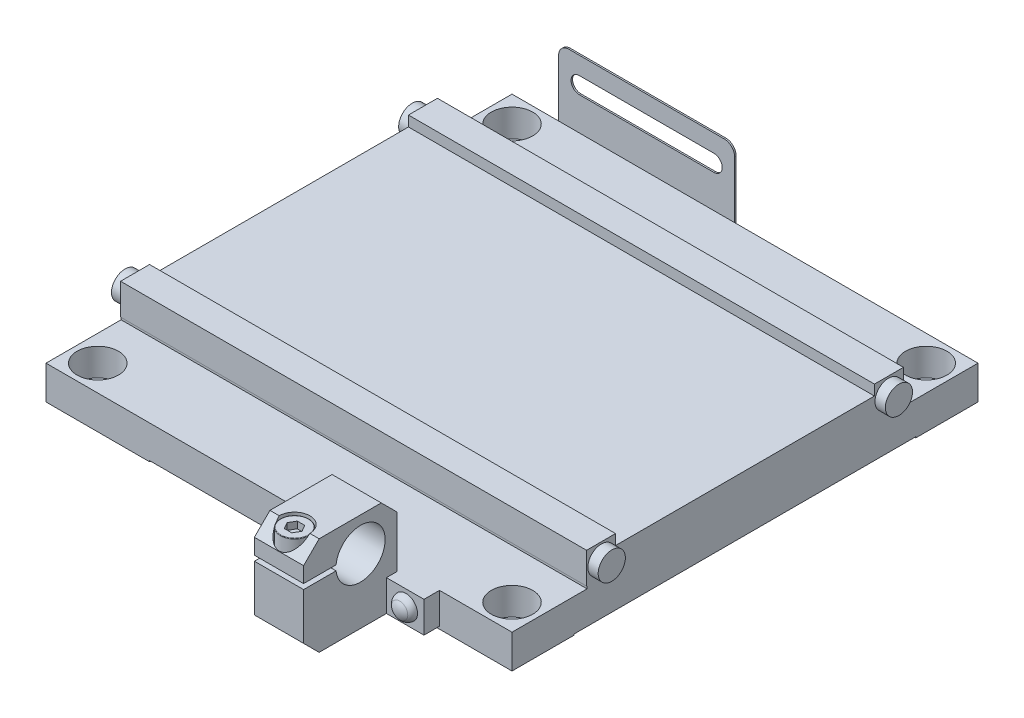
ISO-10303-21;
HEADER;
FILE_DESCRIPTION(('STEP AP214'),'2;1');
FILE_NAME('part.step','',(''),(''),'','','');
FILE_SCHEMA(('AUTOMOTIVE_DESIGN { 1 0 10303 214 1 1 1 1 }'));
ENDSEC;
DATA;
#1=APPLICATION_CONTEXT('core data for automotive mechanical design processes');
#2=APPLICATION_PROTOCOL_DEFINITION('international standard','automotive_design',2000,#1);
#3=PRODUCT_CONTEXT('',#1,'mechanical');
#4=PRODUCT('Part','Part','',(#3));
#5=PRODUCT_RELATED_PRODUCT_CATEGORY('part','',(#4));
#6=PRODUCT_DEFINITION_FORMATION('','',#4);
#7=PRODUCT_DEFINITION_CONTEXT('part definition',#1,'design');
#8=PRODUCT_DEFINITION('design','',#6,#7);
#9=PRODUCT_DEFINITION_SHAPE('','',#8);
#10=(LENGTH_UNIT() NAMED_UNIT(*) SI_UNIT(.MILLI.,.METRE.));
#11=(NAMED_UNIT(*) PLANE_ANGLE_UNIT() SI_UNIT($,.RADIAN.));
#12=(NAMED_UNIT(*) SI_UNIT($,.STERADIAN.) SOLID_ANGLE_UNIT());
#13=UNCERTAINTY_MEASURE_WITH_UNIT(LENGTH_MEASURE(1.E-05),#10,'distance_accuracy_value','');
#14=(GEOMETRIC_REPRESENTATION_CONTEXT(3) GLOBAL_UNCERTAINTY_ASSIGNED_CONTEXT((#13)) GLOBAL_UNIT_ASSIGNED_CONTEXT((#10,
#11,#12)) REPRESENTATION_CONTEXT('',''));
#15=CARTESIAN_POINT('',(0.,0.,0.));
#16=DIRECTION('',(0.,0.,1.));
#17=DIRECTION('',(1.,0.,0.));
#18=AXIS2_PLACEMENT_3D('',#15,#16,#17);
#19=CARTESIAN_POINT('',(23.75,13.5,64.));
#20=DIRECTION('',(0.,1.,0.));
#21=DIRECTION('',(0.,0.,1.));
#22=AXIS2_PLACEMENT_3D('',#19,#20,#21);
#23=PLANE('',#22);
#24=CARTESIAN_POINT('',(19.,13.5,61.));
#25=DIRECTION('',(0.,-1.,0.));
#26=DIRECTION('',(0.,0.,1.));
#27=AXIS2_PLACEMENT_3D('',#24,#25,#26);
#28=CIRCLE('',#27,1.5);
#29=CARTESIAN_POINT('',(19.,13.5,62.5));
#30=VERTEX_POINT('',#29);
#31=EDGE_CURVE('E5',#30,#30,#28,.T.);
#32=ORIENTED_EDGE('',*,*,#31,.F.);
#33=EDGE_LOOP('',(#32));
#34=FACE_BOUND('',#33,.T.);
#35=DIRECTION('',(-1.,0.,0.));
#36=VECTOR('',#35,1.);
#37=CARTESIAN_POINT('',(23.75,13.5,57.7236109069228));
#38=LINE('',#37,#36);
#39=CARTESIAN_POINT('',(23.75,13.5,57.7236109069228));
#40=VERTEX_POINT('',#39);
#41=CARTESIAN_POINT('',(14.25,13.5,57.7236109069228));
#42=VERTEX_POINT('',#41);
#43=EDGE_CURVE('E11',#40,#42,#38,.T.);
#44=ORIENTED_EDGE('',*,*,#43,.F.);
#45=DIRECTION('',(0.,0.,-1.));
#46=VECTOR('',#45,1.);
#47=CARTESIAN_POINT('',(23.75,13.5,64.));
#48=LINE('',#47,#46);
#49=CARTESIAN_POINT('',(23.75,13.5,64.));
#50=VERTEX_POINT('',#49);
#51=EDGE_CURVE('E18',#50,#40,#48,.T.);
#52=ORIENTED_EDGE('',*,*,#51,.F.);
#53=DIRECTION('',(-1.,0.,0.));
#54=VECTOR('',#53,1.);
#55=CARTESIAN_POINT('',(23.75,13.5,64.));
#56=LINE('',#55,#54);
#57=CARTESIAN_POINT('',(14.25,13.5,64.));
#58=VERTEX_POINT('',#57);
#59=EDGE_CURVE('E25',#50,#58,#56,.T.);
#60=ORIENTED_EDGE('',*,*,#59,.T.);
#61=DIRECTION('',(0.,0.,-1.));
#62=VECTOR('',#61,1.);
#63=CARTESIAN_POINT('',(14.25,13.5,64.));
#64=LINE('',#63,#62);
#65=EDGE_CURVE('E32',#58,#42,#64,.T.);
#66=ORIENTED_EDGE('',*,*,#65,.T.);
#67=EDGE_LOOP('',(#44,#52,#60,#66));
#68=FACE_BOUND('',#67,.T.);
#69=ADVANCED_FACE('F38',(#34,#68),#23,.F.);
#70=CARTESIAN_POINT('',(19.,12.5,61.));
#71=DIRECTION('',(0.,-1.,0.));
#72=DIRECTION('',(0.,0.,-1.));
#73=AXIS2_PLACEMENT_3D('',#70,#71,#72);
#74=CYLINDRICAL_SURFACE('',#73,1.5);
#75=CARTESIAN_POINT('',(19.,12.5,61.));
#76=DIRECTION('',(0.,1.,0.));
#77=DIRECTION('',(0.,0.,-1.));
#78=AXIS2_PLACEMENT_3D('',#75,#76,#77);
#79=CIRCLE('',#78,1.5);
#80=CARTESIAN_POINT('',(19.,12.5,59.5));
#81=VERTEX_POINT('',#80);
#82=EDGE_CURVE('E49',#81,#81,#79,.T.);
#83=ORIENTED_EDGE('',*,*,#82,.T.);
#84=EDGE_LOOP('',(#83));
#85=FACE_BOUND('',#84,.T.);
#86=ORIENTED_EDGE('',*,*,#31,.T.);
#87=EDGE_LOOP('',(#86));
#88=FACE_BOUND('',#87,.T.);
#89=ADVANCED_FACE('F55',(#85,#88),#74,.T.);
#90=CARTESIAN_POINT('',(23.75,13.,53.));
#91=DIRECTION('',(1.,0.,0.));
#92=DIRECTION('',(0.,0.,-1.));
#93=AXIS2_PLACEMENT_3D('',#90,#91,#92);
#94=CYLINDRICAL_SURFACE('',#93,4.75);
#95=ORIENTED_EDGE('',*,*,#43,.T.);
#96=CARTESIAN_POINT('',(14.25,13.,53.));
#97=DIRECTION('',(1.,0.,0.));
#98=DIRECTION('',(0.,-0.105263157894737,0.994444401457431));
#99=AXIS2_PLACEMENT_3D('',#96,#97,#98);
#100=CIRCLE('',#99,4.75);
#101=CARTESIAN_POINT('',(14.25,12.5,57.7236109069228));
#102=VERTEX_POINT('',#101);
#103=EDGE_CURVE('E65',#102,#42,#100,.T.);
#104=ORIENTED_EDGE('',*,*,#103,.F.);
#105=DIRECTION('',(1.,0.,0.));
#106=VECTOR('',#105,1.);
#107=CARTESIAN_POINT('',(14.25,12.5,57.7236109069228));
#108=LINE('',#107,#106);
#109=CARTESIAN_POINT('',(23.75,12.5,57.7236109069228));
#110=VERTEX_POINT('',#109);
#111=EDGE_CURVE('E72',#102,#110,#108,.T.);
#112=ORIENTED_EDGE('',*,*,#111,.T.);
#113=CARTESIAN_POINT('',(23.75,13.,53.));
#114=DIRECTION('',(1.,0.,0.));
#115=DIRECTION('',(0.,-0.105263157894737,0.994444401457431));
#116=AXIS2_PLACEMENT_3D('',#113,#114,#115);
#117=CIRCLE('',#116,4.75);
#118=EDGE_CURVE('E79',#110,#40,#117,.T.);
#119=ORIENTED_EDGE('',*,*,#118,.T.);
#120=EDGE_LOOP('',(#95,#104,#112,#119));
#121=FACE_BOUND('',#120,.T.);
#122=ADVANCED_FACE('F83',(#121),#94,.F.);
#123=CARTESIAN_POINT('',(23.75,0.,0.));
#124=DIRECTION('',(1.,0.,0.));
#125=DIRECTION('',(0.,0.,-1.));
#126=AXIS2_PLACEMENT_3D('',#123,#124,#125);
#127=PLANE('',#126);
#128=ORIENTED_EDGE('',*,*,#118,.F.);
#129=DIRECTION('',(0.,0.,1.));
#130=VECTOR('',#129,1.);
#131=CARTESIAN_POINT('',(23.75,12.5,57.7236109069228));
#132=LINE('',#131,#130);
#133=CARTESIAN_POINT('',(23.75,12.5,64.));
#134=VERTEX_POINT('',#133);
#135=EDGE_CURVE('E93',#110,#134,#132,.T.);
#136=ORIENTED_EDGE('',*,*,#135,.T.);
#137=DIRECTION('',(0.,-1.,0.));
#138=VECTOR('',#137,1.);
#139=CARTESIAN_POINT('',(23.75,12.5,64.));
#140=LINE('',#139,#138);
#141=CARTESIAN_POINT('',(23.75,3.5,64.));
#142=VERTEX_POINT('',#141);
#143=EDGE_CURVE('E100',#134,#142,#140,.T.);
#144=ORIENTED_EDGE('',*,*,#143,.T.);
#145=DIRECTION('',(0.,-0.707106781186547,-0.707106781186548));
#146=VECTOR('',#145,1.);
#147=CARTESIAN_POINT('',(23.75,3.5,64.));
#148=LINE('',#147,#146);
#149=CARTESIAN_POINT('',(23.75,0.5,61.));
#150=VERTEX_POINT('',#149);
#151=EDGE_CURVE('E107',#142,#150,#148,.T.);
#152=ORIENTED_EDGE('',*,*,#151,.T.);
#153=DIRECTION('',(0.,0.,-1.));
#154=VECTOR('',#153,1.);
#155=CARTESIAN_POINT('',(23.75,0.5,61.));
#156=LINE('',#155,#154);
#157=CARTESIAN_POINT('',(23.75,0.5,48.));
#158=VERTEX_POINT('',#157);
#159=EDGE_CURVE('E114',#150,#158,#156,.T.);
#160=ORIENTED_EDGE('',*,*,#159,.T.);
#161=DIRECTION('',(0.,1.,0.));
#162=VECTOR('',#161,1.);
#163=CARTESIAN_POINT('',(23.75,0.5,48.));
#164=LINE('',#163,#162);
#165=CARTESIAN_POINT('',(23.75,6.5,48.));
#166=VERTEX_POINT('',#165);
#167=EDGE_CURVE('E121',#158,#166,#164,.T.);
#168=ORIENTED_EDGE('',*,*,#167,.T.);
#169=DIRECTION('',(0.,0.,1.));
#170=VECTOR('',#169,1.);
#171=CARTESIAN_POINT('',(23.75,6.5,46.));
#172=LINE('',#171,#170);
#173=CARTESIAN_POINT('',(23.75,6.5,46.));
#174=VERTEX_POINT('',#173);
#175=EDGE_CURVE('E128',#174,#166,#172,.T.);
#176=ORIENTED_EDGE('',*,*,#175,.F.);
#177=DIRECTION('',(0.,1.,0.));
#178=VECTOR('',#177,1.);
#179=CARTESIAN_POINT('',(23.75,6.5,46.));
#180=LINE('',#179,#178);
#181=CARTESIAN_POINT('',(23.75,16.5,46.));
#182=VERTEX_POINT('',#181);
#183=EDGE_CURVE('E135',#174,#182,#180,.T.);
#184=ORIENTED_EDGE('',*,*,#183,.T.);
#185=DIRECTION('',(0.,0.707106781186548,0.707106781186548));
#186=VECTOR('',#185,1.);
#187=CARTESIAN_POINT('',(23.75,16.5,46.));
#188=LINE('',#187,#186);
#189=CARTESIAN_POINT('',(23.75,19.5,49.));
#190=VERTEX_POINT('',#189);
#191=EDGE_CURVE('E142',#182,#190,#188,.T.);
#192=ORIENTED_EDGE('',*,*,#191,.T.);
#193=DIRECTION('',(0.,0.,1.));
#194=VECTOR('',#193,1.);
#195=CARTESIAN_POINT('',(23.75,19.5,49.));
#196=LINE('',#195,#194);
#197=CARTESIAN_POINT('',(23.75,19.5,61.));
#198=VERTEX_POINT('',#197);
#199=EDGE_CURVE('E149',#190,#198,#196,.T.);
#200=ORIENTED_EDGE('',*,*,#199,.T.);
#201=DIRECTION('',(0.,-0.707106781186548,0.707106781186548));
#202=VECTOR('',#201,1.);
#203=CARTESIAN_POINT('',(23.75,19.5,61.));
#204=LINE('',#203,#202);
#205=CARTESIAN_POINT('',(23.75,16.5,64.));
#206=VERTEX_POINT('',#205);
#207=EDGE_CURVE('E156',#198,#206,#204,.T.);
#208=ORIENTED_EDGE('',*,*,#207,.T.);
#209=DIRECTION('',(0.,-1.,0.));
#210=VECTOR('',#209,1.);
#211=CARTESIAN_POINT('',(23.75,16.5,64.));
#212=LINE('',#211,#210);
#213=EDGE_CURVE('E163',#206,#50,#212,.T.);
#214=ORIENTED_EDGE('',*,*,#213,.T.);
#215=ORIENTED_EDGE('',*,*,#51,.T.);
#216=EDGE_LOOP('',(#128,#136,#144,#152,#160,#168,#176,#184,#192,#200,#208,#214,#215));
#217=FACE_BOUND('',#216,.T.);
#218=ADVANCED_FACE('F168',(#217),#127,.T.);
#219=CARTESIAN_POINT('',(23.75,16.5,64.));
#220=DIRECTION('',(0.,0.,-1.));
#221=DIRECTION('',(-1.,0.,0.));
#222=AXIS2_PLACEMENT_3D('',#219,#220,#221);
#223=PLANE('',#222);
#224=DIRECTION('',(0.,-1.,0.));
#225=VECTOR('',#224,1.);
#226=CARTESIAN_POINT('',(14.25,16.5,64.));
#227=LINE('',#226,#225);
#228=CARTESIAN_POINT('',(14.25,16.5,64.));
#229=VERTEX_POINT('',#228);
#230=EDGE_CURVE('E177',#229,#58,#227,.T.);
#231=ORIENTED_EDGE('',*,*,#230,.T.);
#232=ORIENTED_EDGE('',*,*,#59,.F.);
#233=ORIENTED_EDGE('',*,*,#213,.F.);
#234=DIRECTION('',(-1.,0.,0.));
#235=VECTOR('',#234,1.);
#236=CARTESIAN_POINT('',(23.75,16.5,64.));
#237=LINE('',#236,#235);
#238=EDGE_CURVE('E184',#206,#229,#237,.T.);
#239=ORIENTED_EDGE('',*,*,#238,.T.);
#240=EDGE_LOOP('',(#231,#232,#233,#239));
#241=FACE_BOUND('',#240,.T.);
#242=ADVANCED_FACE('F190',(#241),#223,.F.);
#243=CARTESIAN_POINT('',(14.25,0.,0.));
#244=DIRECTION('',(1.,0.,0.));
#245=DIRECTION('',(0.,0.,-1.));
#246=AXIS2_PLACEMENT_3D('',#243,#244,#245);
#247=PLANE('',#246);
#248=DIRECTION('',(0.,0.,1.));
#249=VECTOR('',#248,1.);
#250=CARTESIAN_POINT('',(14.25,12.5,57.7236109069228));
#251=LINE('',#250,#249);
#252=CARTESIAN_POINT('',(14.25,12.5,64.));
#253=VERTEX_POINT('',#252);
#254=EDGE_CURVE('E199',#102,#253,#251,.T.);
#255=ORIENTED_EDGE('',*,*,#254,.F.);
#256=ORIENTED_EDGE('',*,*,#103,.T.);
#257=ORIENTED_EDGE('',*,*,#65,.F.);
#258=ORIENTED_EDGE('',*,*,#230,.F.);
#259=DIRECTION('',(0.,-0.707106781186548,0.707106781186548));
#260=VECTOR('',#259,1.);
#261=CARTESIAN_POINT('',(14.25,19.5,61.));
#262=LINE('',#261,#260);
#263=CARTESIAN_POINT('',(14.25,19.5,61.));
#264=VERTEX_POINT('',#263);
#265=EDGE_CURVE('E207',#264,#229,#262,.T.);
#266=ORIENTED_EDGE('',*,*,#265,.F.);
#267=DIRECTION('',(0.,0.,1.));
#268=VECTOR('',#267,1.);
#269=CARTESIAN_POINT('',(14.25,19.5,49.));
#270=LINE('',#269,#268);
#271=CARTESIAN_POINT('',(14.25,19.5,49.));
#272=VERTEX_POINT('',#271);
#273=EDGE_CURVE('E214',#272,#264,#270,.T.);
#274=ORIENTED_EDGE('',*,*,#273,.F.);
#275=DIRECTION('',(0.,0.707106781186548,0.707106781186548));
#276=VECTOR('',#275,1.);
#277=CARTESIAN_POINT('',(14.25,16.5,46.));
#278=LINE('',#277,#276);
#279=CARTESIAN_POINT('',(14.25,16.5,46.));
#280=VERTEX_POINT('',#279);
#281=EDGE_CURVE('E221',#280,#272,#278,.T.);
#282=ORIENTED_EDGE('',*,*,#281,.F.);
#283=DIRECTION('',(0.,1.,0.));
#284=VECTOR('',#283,1.);
#285=CARTESIAN_POINT('',(14.25,6.5,46.));
#286=LINE('',#285,#284);
#287=CARTESIAN_POINT('',(14.25,6.5,46.));
#288=VERTEX_POINT('',#287);
#289=EDGE_CURVE('E228',#288,#280,#286,.T.);
#290=ORIENTED_EDGE('',*,*,#289,.F.);
#291=DIRECTION('',(0.,0.,1.));
#292=VECTOR('',#291,1.);
#293=CARTESIAN_POINT('',(14.25,6.5,46.));
#294=LINE('',#293,#292);
#295=CARTESIAN_POINT('',(14.25,6.5,48.));
#296=VERTEX_POINT('',#295);
#297=EDGE_CURVE('E235',#288,#296,#294,.T.);
#298=ORIENTED_EDGE('',*,*,#297,.T.);
#299=DIRECTION('',(0.,1.,0.));
#300=VECTOR('',#299,1.);
#301=CARTESIAN_POINT('',(14.25,0.5,48.));
#302=LINE('',#301,#300);
#303=CARTESIAN_POINT('',(14.25,0.5,48.));
#304=VERTEX_POINT('',#303);
#305=EDGE_CURVE('E242',#304,#296,#302,.T.);
#306=ORIENTED_EDGE('',*,*,#305,.F.);
#307=DIRECTION('',(0.,0.,-1.));
#308=VECTOR('',#307,1.);
#309=CARTESIAN_POINT('',(14.25,0.5,61.));
#310=LINE('',#309,#308);
#311=CARTESIAN_POINT('',(14.25,0.5,61.));
#312=VERTEX_POINT('',#311);
#313=EDGE_CURVE('E249',#312,#304,#310,.T.);
#314=ORIENTED_EDGE('',*,*,#313,.F.);
#315=DIRECTION('',(0.,-0.707106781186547,-0.707106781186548));
#316=VECTOR('',#315,1.);
#317=CARTESIAN_POINT('',(14.25,3.5,64.));
#318=LINE('',#317,#316);
#319=CARTESIAN_POINT('',(14.25,3.5,64.));
#320=VERTEX_POINT('',#319);
#321=EDGE_CURVE('E256',#320,#312,#318,.T.);
#322=ORIENTED_EDGE('',*,*,#321,.F.);
#323=DIRECTION('',(0.,-1.,0.));
#324=VECTOR('',#323,1.);
#325=CARTESIAN_POINT('',(14.25,12.5,64.));
#326=LINE('',#325,#324);
#327=EDGE_CURVE('E263',#253,#320,#326,.T.);
#328=ORIENTED_EDGE('',*,*,#327,.F.);
#329=EDGE_LOOP('',(#255,#256,#257,#258,#266,#274,#282,#290,#298,#306,#314,#322,#328));
#330=FACE_BOUND('',#329,.T.);
#331=ADVANCED_FACE('F269',(#330),#247,.F.);
#332=CARTESIAN_POINT('',(23.75,12.5,53.));
#333=DIRECTION('',(0.,-1.,0.));
#334=DIRECTION('',(0.,0.,-1.));
#335=AXIS2_PLACEMENT_3D('',#332,#333,#334);
#336=PLANE('',#335);
#337=ORIENTED_EDGE('',*,*,#82,.F.);
#338=EDGE_LOOP('',(#337));
#339=FACE_BOUND('',#338,.T.);
#340=ORIENTED_EDGE('',*,*,#111,.F.);
#341=ORIENTED_EDGE('',*,*,#254,.T.);
#342=DIRECTION('',(-1.,0.,0.));
#343=VECTOR('',#342,1.);
#344=CARTESIAN_POINT('',(23.75,12.5,64.));
#345=LINE('',#344,#343);
#346=EDGE_CURVE('E282',#134,#253,#345,.T.);
#347=ORIENTED_EDGE('',*,*,#346,.F.);
#348=ORIENTED_EDGE('',*,*,#135,.F.);
#349=EDGE_LOOP('',(#340,#341,#347,#348));
#350=FACE_BOUND('',#349,.T.);
#351=ADVANCED_FACE('F287',(#339,#350),#336,.F.);
#352=CARTESIAN_POINT('',(23.75,12.5,64.));
#353=DIRECTION('',(0.,0.,-1.));
#354=DIRECTION('',(-1.,0.,0.));
#355=AXIS2_PLACEMENT_3D('',#352,#353,#354);
#356=PLANE('',#355);
#357=ORIENTED_EDGE('',*,*,#327,.T.);
#358=DIRECTION('',(-1.,0.,0.));
#359=VECTOR('',#358,1.);
#360=CARTESIAN_POINT('',(23.75,3.5,64.));
#361=LINE('',#360,#359);
#362=EDGE_CURVE('E297',#142,#320,#361,.T.);
#363=ORIENTED_EDGE('',*,*,#362,.F.);
#364=ORIENTED_EDGE('',*,*,#143,.F.);
#365=ORIENTED_EDGE('',*,*,#346,.T.);
#366=EDGE_LOOP('',(#357,#363,#364,#365));
#367=FACE_BOUND('',#366,.T.);
#368=ADVANCED_FACE('F303',(#367),#356,.F.);
#369=CARTESIAN_POINT('',(23.75,3.5,64.));
#370=DIRECTION('',(0.,0.707106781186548,-0.707106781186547));
#371=DIRECTION('',(0.,0.707106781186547,0.707106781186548));
#372=AXIS2_PLACEMENT_3D('',#369,#370,#371);
#373=PLANE('',#372);
#374=ORIENTED_EDGE('',*,*,#321,.T.);
#375=DIRECTION('',(-1.,0.,0.));
#376=VECTOR('',#375,1.);
#377=CARTESIAN_POINT('',(23.75,0.5,61.));
#378=LINE('',#377,#376);
#379=EDGE_CURVE('E313',#150,#312,#378,.T.);
#380=ORIENTED_EDGE('',*,*,#379,.F.);
#381=ORIENTED_EDGE('',*,*,#151,.F.);
#382=ORIENTED_EDGE('',*,*,#362,.T.);
#383=EDGE_LOOP('',(#374,#380,#381,#382));
#384=FACE_BOUND('',#383,.T.);
#385=ADVANCED_FACE('F319',(#384),#373,.F.);
#386=CARTESIAN_POINT('',(7.,0.5,45.));
#387=DIRECTION('',(0.,-1.,0.));
#388=DIRECTION('',(0.,0.,-1.));
#389=AXIS2_PLACEMENT_3D('',#386,#387,#388);
#390=PLANE('',#389);
#391=DIRECTION('',(1.,0.,0.));
#392=VECTOR('',#391,1.);
#393=CARTESIAN_POINT('',(23.75,0.5,48.));
#394=LINE('',#393,#392);
#395=CARTESIAN_POINT('',(31.,0.5,48.));
#396=VERTEX_POINT('',#395);
#397=EDGE_CURVE('E328',#158,#396,#394,.T.);
#398=ORIENTED_EDGE('',*,*,#397,.F.);
#399=ORIENTED_EDGE('',*,*,#159,.F.);
#400=ORIENTED_EDGE('',*,*,#379,.T.);
#401=ORIENTED_EDGE('',*,*,#313,.T.);
#402=DIRECTION('',(1.,0.,0.));
#403=VECTOR('',#402,1.);
#404=CARTESIAN_POINT('',(7.,0.5,48.));
#405=LINE('',#404,#403);
#406=CARTESIAN_POINT('',(7.,0.5,48.));
#407=VERTEX_POINT('',#406);
#408=EDGE_CURVE('E336',#407,#304,#405,.T.);
#409=ORIENTED_EDGE('',*,*,#408,.F.);
#410=DIRECTION('',(0.,0.,1.));
#411=VECTOR('',#410,1.);
#412=CARTESIAN_POINT('',(7.,0.5,45.));
#413=LINE('',#412,#411);
#414=CARTESIAN_POINT('',(7.,0.5,45.));
#415=VERTEX_POINT('',#414);
#416=EDGE_CURVE('E343',#415,#407,#413,.T.);
#417=ORIENTED_EDGE('',*,*,#416,.F.);
#418=DIRECTION('',(1.,0.,0.));
#419=VECTOR('',#418,1.);
#420=CARTESIAN_POINT('',(7.,0.5,45.));
#421=LINE('',#420,#419);
#422=CARTESIAN_POINT('',(31.,0.5,45.));
#423=VERTEX_POINT('',#422);
#424=EDGE_CURVE('E350',#415,#423,#421,.T.);
#425=ORIENTED_EDGE('',*,*,#424,.T.);
#426=DIRECTION('',(0.,0.,1.));
#427=VECTOR('',#426,1.);
#428=CARTESIAN_POINT('',(31.,0.5,45.));
#429=LINE('',#428,#427);
#430=EDGE_CURVE('E357',#423,#396,#429,.T.);
#431=ORIENTED_EDGE('',*,*,#430,.T.);
#432=EDGE_LOOP('',(#398,#399,#400,#401,#409,#417,#425,#431));
#433=FACE_BOUND('',#432,.T.);
#434=ADVANCED_FACE('F363',(#433),#390,.T.);
#435=CARTESIAN_POINT('',(0.,0.,48.));
#436=DIRECTION('',(0.,0.,1.));
#437=DIRECTION('',(1.,0.,0.));
#438=AXIS2_PLACEMENT_3D('',#435,#436,#437);
#439=PLANE('',#438);
#440=ORIENTED_EDGE('',*,*,#167,.F.);
#441=ORIENTED_EDGE('',*,*,#397,.T.);
#442=DIRECTION('',(0.,1.,0.));
#443=VECTOR('',#442,1.);
#444=CARTESIAN_POINT('',(31.,0.5,48.));
#445=LINE('',#444,#443);
#446=CARTESIAN_POINT('',(31.,6.5,48.));
#447=VERTEX_POINT('',#446);
#448=EDGE_CURVE('E374',#396,#447,#445,.T.);
#449=ORIENTED_EDGE('',*,*,#448,.T.);
#450=DIRECTION('',(-1.,0.,0.));
#451=VECTOR('',#450,1.);
#452=CARTESIAN_POINT('',(31.,6.5,48.));
#453=LINE('',#452,#451);
#454=EDGE_CURVE('E381',#447,#166,#453,.T.);
#455=ORIENTED_EDGE('',*,*,#454,.T.);
#456=EDGE_LOOP('',(#440,#441,#449,#455));
#457=FACE_BOUND('',#456,.T.);
#458=CARTESIAN_POINT('',(27.5,3.5,48.));
#459=DIRECTION('',(0.,0.,1.));
#460=DIRECTION('',(1.,0.,0.));
#461=AXIS2_PLACEMENT_3D('',#458,#459,#460);
#462=CIRCLE('',#461,2.24999999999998);
#463=CARTESIAN_POINT('',(29.75,3.5,48.));
#464=VERTEX_POINT('',#463);
#465=EDGE_CURVE('E385',#464,#464,#462,.T.);
#466=ORIENTED_EDGE('',*,*,#465,.F.);
#467=EDGE_LOOP('',(#466));
#468=FACE_BOUND('',#467,.T.);
#469=ADVANCED_FACE('F389',(#457,#468),#439,.T.);
#470=CARTESIAN_POINT('',(45.,6.5,30.5));
#471=DIRECTION('',(0.,-1.,0.));
#472=DIRECTION('',(0.,0.,-1.));
#473=AXIS2_PLACEMENT_3D('',#470,#471,#472);
#474=PLANE('',#473);
#475=CARTESIAN_POINT('',(-40.,6.5,40.));
#476=DIRECTION('',(0.,-1.,0.));
#477=DIRECTION('',(0.,0.,-1.));
#478=AXIS2_PLACEMENT_3D('',#475,#476,#477);
#479=CIRCLE('',#478,4.);
#480=CARTESIAN_POINT('',(-40.,6.5,36.));
#481=VERTEX_POINT('',#480);
#482=EDGE_CURVE('E396',#481,#481,#479,.T.);
#483=ORIENTED_EDGE('',*,*,#482,.T.);
#484=EDGE_LOOP('',(#483));
#485=FACE_BOUND('',#484,.T.);
#486=CARTESIAN_POINT('',(40.,6.5,40.));
#487=DIRECTION('',(0.,-1.,0.));
#488=DIRECTION('',(0.,0.,-1.));
#489=AXIS2_PLACEMENT_3D('',#486,#487,#488);
#490=CIRCLE('',#489,4.);
#491=CARTESIAN_POINT('',(40.,6.5,36.));
#492=VERTEX_POINT('',#491);
#493=EDGE_CURVE('E400',#492,#492,#490,.T.);
#494=ORIENTED_EDGE('',*,*,#493,.T.);
#495=EDGE_LOOP('',(#494));
#496=FACE_BOUND('',#495,.T.);
#497=DIRECTION('',(-1.,0.,0.));
#498=VECTOR('',#497,1.);
#499=CARTESIAN_POINT('',(23.75,6.5,46.));
#500=LINE('',#499,#498);
#501=EDGE_CURVE('E406',#174,#288,#500,.T.);
#502=ORIENTED_EDGE('',*,*,#501,.F.);
#503=ORIENTED_EDGE('',*,*,#175,.T.);
#504=ORIENTED_EDGE('',*,*,#454,.F.);
#505=DIRECTION('',(0.,0.,1.));
#506=VECTOR('',#505,1.);
#507=CARTESIAN_POINT('',(31.,6.5,45.));
#508=LINE('',#507,#506);
#509=CARTESIAN_POINT('',(31.,6.5,45.));
#510=VERTEX_POINT('',#509);
#511=EDGE_CURVE('E413',#510,#447,#508,.T.);
#512=ORIENTED_EDGE('',*,*,#511,.F.);
#513=DIRECTION('',(-1.,0.,0.));
#514=VECTOR('',#513,1.);
#515=CARTESIAN_POINT('',(45.,6.5,45.));
#516=LINE('',#515,#514);
#517=CARTESIAN_POINT('',(45.,6.5,45.));
#518=VERTEX_POINT('',#517);
#519=EDGE_CURVE('E420',#518,#510,#516,.T.);
#520=ORIENTED_EDGE('',*,*,#519,.F.);
#521=DIRECTION('',(0.,0.,1.));
#522=VECTOR('',#521,1.);
#523=CARTESIAN_POINT('',(45.,6.5,30.5));
#524=LINE('',#523,#522);
#525=CARTESIAN_POINT('',(45.,6.5,30.5));
#526=VERTEX_POINT('',#525);
#527=EDGE_CURVE('E427',#526,#518,#524,.T.);
#528=ORIENTED_EDGE('',*,*,#527,.F.);
#529=DIRECTION('',(-1.,0.,0.));
#530=VECTOR('',#529,1.);
#531=CARTESIAN_POINT('',(45.,6.5,30.5));
#532=LINE('',#531,#530);
#533=CARTESIAN_POINT('',(-45.,6.5,30.5));
#534=VERTEX_POINT('',#533);
#535=EDGE_CURVE('E434',#526,#534,#532,.T.);
#536=ORIENTED_EDGE('',*,*,#535,.T.);
#537=DIRECTION('',(0.,0.,1.));
#538=VECTOR('',#537,1.);
#539=CARTESIAN_POINT('',(-45.,6.5,30.5));
#540=LINE('',#539,#538);
#541=CARTESIAN_POINT('',(-45.,6.5,45.));
#542=VERTEX_POINT('',#541);
#543=EDGE_CURVE('E441',#534,#542,#540,.T.);
#544=ORIENTED_EDGE('',*,*,#543,.T.);
#545=DIRECTION('',(-1.,0.,0.));
#546=VECTOR('',#545,1.);
#547=CARTESIAN_POINT('',(7.,6.5,45.));
#548=LINE('',#547,#546);
#549=CARTESIAN_POINT('',(7.,6.5,45.));
#550=VERTEX_POINT('',#549);
#551=EDGE_CURVE('E448',#550,#542,#548,.T.);
#552=ORIENTED_EDGE('',*,*,#551,.F.);
#553=DIRECTION('',(0.,0.,1.));
#554=VECTOR('',#553,1.);
#555=CARTESIAN_POINT('',(7.,6.5,45.));
#556=LINE('',#555,#554);
#557=CARTESIAN_POINT('',(7.,6.5,48.));
#558=VERTEX_POINT('',#557);
#559=EDGE_CURVE('E455',#550,#558,#556,.T.);
#560=ORIENTED_EDGE('',*,*,#559,.T.);
#561=DIRECTION('',(-1.,0.,0.));
#562=VECTOR('',#561,1.);
#563=CARTESIAN_POINT('',(14.25,6.5,48.));
#564=LINE('',#563,#562);
#565=EDGE_CURVE('E462',#296,#558,#564,.T.);
#566=ORIENTED_EDGE('',*,*,#565,.F.);
#567=ORIENTED_EDGE('',*,*,#297,.F.);
#568=EDGE_LOOP('',(#502,#503,#504,#512,#520,#528,#536,#544,#552,#560,#566,#567));
#569=FACE_BOUND('',#568,.T.);
#570=ADVANCED_FACE('F467',(#485,#496,#569),#474,.F.);
#571=CARTESIAN_POINT('',(23.75,0.5,46.));
#572=DIRECTION('',(0.,0.,1.));
#573=DIRECTION('',(1.,0.,0.));
#574=AXIS2_PLACEMENT_3D('',#571,#572,#573);
#575=PLANE('',#574);
#576=ORIENTED_EDGE('',*,*,#183,.F.);
#577=ORIENTED_EDGE('',*,*,#501,.T.);
#578=ORIENTED_EDGE('',*,*,#289,.T.);
#579=DIRECTION('',(-1.,0.,0.));
#580=VECTOR('',#579,1.);
#581=CARTESIAN_POINT('',(23.75,16.5,46.));
#582=LINE('',#581,#580);
#583=EDGE_CURVE('E479',#182,#280,#582,.T.);
#584=ORIENTED_EDGE('',*,*,#583,.F.);
#585=EDGE_LOOP('',(#576,#577,#578,#584));
#586=FACE_BOUND('',#585,.T.);
#587=ADVANCED_FACE('F483',(#586),#575,.F.);
#588=CARTESIAN_POINT('',(23.75,16.5,46.));
#589=DIRECTION('',(0.,-0.707106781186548,0.707106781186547));
#590=DIRECTION('',(0.,-0.707106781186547,-0.707106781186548));
#591=AXIS2_PLACEMENT_3D('',#588,#589,#590);
#592=PLANE('',#591);
#593=ORIENTED_EDGE('',*,*,#281,.T.);
#594=DIRECTION('',(-1.,0.,0.));
#595=VECTOR('',#594,1.);
#596=CARTESIAN_POINT('',(23.75,19.5,49.));
#597=LINE('',#596,#595);
#598=EDGE_CURVE('E493',#190,#272,#597,.T.);
#599=ORIENTED_EDGE('',*,*,#598,.F.);
#600=ORIENTED_EDGE('',*,*,#191,.F.);
#601=ORIENTED_EDGE('',*,*,#583,.T.);
#602=EDGE_LOOP('',(#593,#599,#600,#601));
#603=FACE_BOUND('',#602,.T.);
#604=ADVANCED_FACE('F499',(#603),#592,.F.);
#605=CARTESIAN_POINT('',(23.75,19.5,49.));
#606=DIRECTION('',(0.,-1.,0.));
#607=DIRECTION('',(0.,0.,-1.));
#608=AXIS2_PLACEMENT_3D('',#605,#606,#607);
#609=PLANE('',#608);
#610=CARTESIAN_POINT('',(19.,19.5,61.));
#611=DIRECTION('',(0.,1.,0.));
#612=DIRECTION('',(1.,0.,0.));
#613=AXIS2_PLACEMENT_3D('',#610,#611,#612);
#614=CIRCLE('',#613,2.95);
#615=CARTESIAN_POINT('',(21.95,19.5,61.));
#616=VERTEX_POINT('',#615);
#617=CARTESIAN_POINT('',(16.05,19.5,61.));
#618=VERTEX_POINT('',#617);
#619=EDGE_CURVE('E508',#616,#618,#614,.T.);
#620=ORIENTED_EDGE('',*,*,#619,.F.);
#621=DIRECTION('',(-1.,0.,0.));
#622=VECTOR('',#621,1.);
#623=CARTESIAN_POINT('',(23.75,19.5,61.));
#624=LINE('',#623,#622);
#625=EDGE_CURVE('E515',#198,#616,#624,.T.);
#626=ORIENTED_EDGE('',*,*,#625,.F.);
#627=ORIENTED_EDGE('',*,*,#199,.F.);
#628=ORIENTED_EDGE('',*,*,#598,.T.);
#629=ORIENTED_EDGE('',*,*,#273,.T.);
#630=DIRECTION('',(-1.,0.,0.));
#631=VECTOR('',#630,1.);
#632=CARTESIAN_POINT('',(16.05,19.5,61.));
#633=LINE('',#632,#631);
#634=EDGE_CURVE('E523',#618,#264,#633,.T.);
#635=ORIENTED_EDGE('',*,*,#634,.F.);
#636=EDGE_LOOP('',(#620,#626,#627,#628,#629,#635));
#637=FACE_BOUND('',#636,.T.);
#638=ADVANCED_FACE('F529',(#637),#609,.F.);
#639=CARTESIAN_POINT('',(23.75,19.5,61.));
#640=DIRECTION('',(0.,-0.707106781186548,-0.707106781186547));
#641=DIRECTION('',(0.,0.707106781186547,-0.707106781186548));
#642=AXIS2_PLACEMENT_3D('',#639,#640,#641);
#643=PLANE('',#642);
#644=CARTESIAN_POINT('',(16.05,19.5000000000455,60.9999999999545));
#645=CARTESIAN_POINT('',(16.0500001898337,19.4679201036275,61.0320798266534));
#646=CARTESIAN_POINT('',(16.0505232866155,19.4358406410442,61.0641601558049));
#647=CARTESIAN_POINT('',(16.0526190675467,19.3716281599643,61.1283753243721));
#648=CARTESIAN_POINT('',(16.0541940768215,19.339495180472,61.1605101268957));
#649=CARTESIAN_POINT('',(16.0583988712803,19.2752423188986,61.2247666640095));
#650=CARTESIAN_POINT('',(16.0610293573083,19.2431224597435,61.2568883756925));
#651=CARTESIAN_POINT('',(16.0673451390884,19.1789625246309,61.3210510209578));
#652=CARTESIAN_POINT('',(16.0710295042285,19.1469224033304,61.3530920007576));
#653=CARTESIAN_POINT('',(16.0794475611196,19.0829886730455,61.4170258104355));
#654=CARTESIAN_POINT('',(16.0841786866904,19.0510948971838,61.4489188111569));
#655=CARTESIAN_POINT('',(16.0946794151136,18.9875206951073,61.5124900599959));
#656=CARTESIAN_POINT('',(16.1004448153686,18.9558399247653,61.5441686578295));
#657=CARTESIAN_POINT('',(16.1129978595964,18.8927584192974,61.6072454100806));
#658=CARTESIAN_POINT('',(16.1197796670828,18.8613571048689,61.6386441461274));
#659=CARTESIAN_POINT('',(16.1343568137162,18.7988481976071,61.7011515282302));
#660=CARTESIAN_POINT('',(16.1421464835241,18.7677399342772,61.7322608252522));
#661=CARTESIAN_POINT('',(16.1587599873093,18.7057249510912,61.7942819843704));
#662=CARTESIAN_POINT('',(16.1675818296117,18.6748179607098,61.8251941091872));
#663=CARTESIAN_POINT('',(16.1862527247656,18.6132535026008,61.8867684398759));
#664=CARTESIAN_POINT('',(16.1960987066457,18.5825955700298,61.9174311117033));
#665=CARTESIAN_POINT('',(16.2168045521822,18.5215875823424,61.9784460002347));
#666=CARTESIAN_POINT('',(16.2276599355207,18.4912367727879,62.0087989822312));
#667=CARTESIAN_POINT('',(16.2503666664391,18.4309012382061,62.0691350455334));
#668=CARTESIAN_POINT('',(16.2622121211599,18.4009154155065,62.099119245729));
#669=CARTESIAN_POINT('',(16.2868766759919,18.3413682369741,62.1586599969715));
#670=CARTESIAN_POINT('',(16.2996884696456,18.3118053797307,62.1882180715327));
#671=CARTESIAN_POINT('',(16.3262589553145,18.253162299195,62.2468505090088));
#672=CARTESIAN_POINT('',(16.340008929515,18.2240801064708,62.2759268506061));
#673=CARTESIAN_POINT('',(16.3684311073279,18.166445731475,62.3335545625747));
#674=CARTESIAN_POINT('',(16.383093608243,18.1378911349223,62.3621083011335));
#675=CARTESIAN_POINT('',(16.4133651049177,18.0812562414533,62.4187473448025));
#676=CARTESIAN_POINT('',(16.4289670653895,18.0531740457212,62.4468345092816));
#677=CARTESIAN_POINT('',(16.4611099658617,17.997499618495,62.5025191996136));
#678=CARTESIAN_POINT('',(16.4776438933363,17.9699053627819,62.5301187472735));
#679=CARTESIAN_POINT('',(16.5116293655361,17.9152486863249,62.5847837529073));
#680=CARTESIAN_POINT('',(16.5290730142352,17.8881838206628,62.6118516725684));
#681=CARTESIAN_POINT('',(16.5648537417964,17.8346275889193,62.665410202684));
#682=CARTESIAN_POINT('',(16.5831820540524,17.8081333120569,62.691903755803));
#683=CARTESIAN_POINT('',(16.6207053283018,17.7557600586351,62.7442720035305));
#684=CARTESIAN_POINT('',(16.6398906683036,17.7298776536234,62.7701501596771));
#685=CARTESIAN_POINT('',(16.6790986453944,17.6787698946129,62.8212477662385));
#686=CARTESIAN_POINT('',(16.6991108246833,17.653540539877,62.8464712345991));
#687=CARTESIAN_POINT('',(16.7399411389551,17.6037806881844,62.8962220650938));
#688=CARTESIAN_POINT('',(16.7607480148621,17.5792455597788,62.9207540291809));
#689=CARTESIAN_POINT('',(16.8031638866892,17.5308803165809,62.9691203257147));
#690=CARTESIAN_POINT('',(16.8247622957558,17.5070455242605,62.9929592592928));
#691=CARTESIAN_POINT('',(16.8687511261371,17.4600873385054,63.0399272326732));
#692=CARTESIAN_POINT('',(16.8911314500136,17.4369592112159,63.0630609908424));
#693=CARTESIAN_POINT('',(16.936655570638,17.3914437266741,63.1085860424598));
#694=CARTESIAN_POINT('',(16.9597888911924,17.3690511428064,63.1309825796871));
#695=CARTESIAN_POINT('',(17.006788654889,17.3250359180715,63.1750020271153));
#696=CARTESIAN_POINT('',(17.0306442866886,17.303407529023,63.1966307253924));
#697=CARTESIAN_POINT('',(17.0790568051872,17.2609500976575,63.2390850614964));
#698=CARTESIAN_POINT('',(17.1036025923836,17.240114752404,63.2599170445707));
#699=CARTESIAN_POINT('',(17.153361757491,17.1992722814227,63.3007500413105));
#700=CARTESIAN_POINT('',(17.1785638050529,17.1792582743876,63.3207579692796));
#701=CARTESIAN_POINT('',(17.2296013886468,17.1400893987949,63.3599175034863));
#702=CARTESIAN_POINT('',(17.2554254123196,17.1209270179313,63.3790765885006));
#703=CARTESIAN_POINT('',(17.3076588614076,17.0834914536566,63.4165058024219));
#704=CARTESIAN_POINT('',(17.3340563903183,17.0652099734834,63.43478422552));
#705=CARTESIAN_POINT('',(17.3873890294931,17.029545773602,63.4704252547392));
#706=CARTESIAN_POINT('',(17.4143123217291,17.0121543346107,63.4877968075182));
#707=CARTESIAN_POINT('',(17.4686934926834,16.9782820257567,63.5216290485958));
#708=CARTESIAN_POINT('',(17.4961406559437,16.9617925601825,63.5380983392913));
#709=CARTESIAN_POINT('',(17.5515660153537,16.9297288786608,63.5701268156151));
#710=CARTESIAN_POINT('',(17.5795347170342,16.9141464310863,63.5856941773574));
#711=CARTESIAN_POINT('',(17.636001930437,16.8839030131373,63.6159174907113));
#712=CARTESIAN_POINT('',(17.6644922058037,16.8692343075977,63.6305810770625));
#713=CARTESIAN_POINT('',(17.7220024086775,16.840824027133,63.6589925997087));
#714=CARTESIAN_POINT('',(17.7510153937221,16.8270753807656,63.672747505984));
#715=CARTESIAN_POINT('',(17.8095718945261,16.8005107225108,63.699334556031));
#716=CARTESIAN_POINT('',(17.839109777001,16.7876884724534,63.7121728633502));
#717=CARTESIAN_POINT('',(17.8987177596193,16.7629822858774,63.736916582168));
#718=CARTESIAN_POINT('',(17.9287835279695,16.7510931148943,63.7488271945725));
#719=CARTESIAN_POINT('',(17.9894491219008,16.7282572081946,63.7717021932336));
#720=CARTESIAN_POINT('',(18.020045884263,16.7173064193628,63.7826706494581));
#721=CARTESIAN_POINT('',(18.0817320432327,16.6963715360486,63.8036298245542));
#722=CARTESIAN_POINT('',(18.112818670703,16.6863833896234,63.8136246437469));
#723=CARTESIAN_POINT('',(18.1750777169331,16.6674612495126,63.832498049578));
#724=CARTESIAN_POINT('',(18.2062414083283,16.658513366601,63.841391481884));
#725=CARTESIAN_POINT('',(18.2685973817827,16.6417078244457,63.8580719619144));
#726=CARTESIAN_POINT('',(18.2997815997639,16.6338353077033,63.8658741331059));
#727=CARTESIAN_POINT('',(18.3622213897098,16.6191707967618,63.880408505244));
#728=CARTESIAN_POINT('',(18.3934712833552,16.6123666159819,63.8871527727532));
#729=CARTESIAN_POINT('',(18.4560895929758,16.5998306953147,63.8995984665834));
#730=CARTESIAN_POINT('',(18.4874544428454,16.5940898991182,63.9053086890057));
#731=CARTESIAN_POINT('',(18.5503524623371,16.5836716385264,63.9157036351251));
#732=CARTESIAN_POINT('',(18.5818838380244,16.5789886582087,63.9203936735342));
#733=CARTESIAN_POINT('',(18.6451668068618,16.5706767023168,63.9287557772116));
#734=CARTESIAN_POINT('',(18.6769179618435,16.5670460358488,63.9324294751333));
#735=CARTESIAN_POINT('',(18.7406936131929,16.5608291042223,63.9387564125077));
#736=CARTESIAN_POINT('',(18.772718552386,16.5582451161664,63.9414074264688));
#737=CARTESIAN_POINT('',(18.8370953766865,16.5541118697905,63.9456763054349));
#738=CARTESIAN_POINT('',(18.8694480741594,16.5525688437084,63.9472879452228));
#739=CARTESIAN_POINT('',(18.9345334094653,16.5505078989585,63.9494549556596));
#740=CARTESIAN_POINT('',(18.967266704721,16.5500000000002,63.9499999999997));
#741=CARTESIAN_POINT('',(19.0327332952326,16.5499999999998,63.9500000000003));
#742=CARTESIAN_POINT('',(19.0654665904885,16.5505078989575,63.9494549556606));
#743=CARTESIAN_POINT('',(19.1305519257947,16.5525688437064,63.9472879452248));
#744=CARTESIAN_POINT('',(19.1629046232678,16.554111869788,63.9456763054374));
#745=CARTESIAN_POINT('',(19.2272814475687,16.558245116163,63.9414074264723));
#746=CARTESIAN_POINT('',(19.2593063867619,16.5608291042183,63.9387564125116));
#747=CARTESIAN_POINT('',(19.3230820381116,16.5670460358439,63.9324294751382));
#748=CARTESIAN_POINT('',(19.3548331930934,16.5706767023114,63.928755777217));
#749=CARTESIAN_POINT('',(19.4181161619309,16.5789886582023,63.9203936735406));
#750=CARTESIAN_POINT('',(19.4496475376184,16.5836716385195,63.915703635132));
#751=CARTESIAN_POINT('',(19.5125455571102,16.5940898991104,63.9053086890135));
#752=CARTESIAN_POINT('',(19.5439104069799,16.5998306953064,63.8995984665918));
#753=CARTESIAN_POINT('',(19.6065287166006,16.6123666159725,63.8871527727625));
#754=CARTESIAN_POINT('',(19.6377786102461,16.6191707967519,63.8804085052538));
#755=CARTESIAN_POINT('',(19.700218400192,16.6338353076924,63.8658741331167));
#756=CARTESIAN_POINT('',(19.7314026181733,16.6417078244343,63.8580719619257));
#757=CARTESIAN_POINT('',(19.7937585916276,16.6585133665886,63.8413914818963));
#758=CARTESIAN_POINT('',(19.8249222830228,16.6674612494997,63.8324980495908));
#759=CARTESIAN_POINT('',(19.8871813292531,16.6863833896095,63.8136246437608));
#760=CARTESIAN_POINT('',(19.9182679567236,16.6963715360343,63.8036298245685));
#761=CARTESIAN_POINT('',(19.9799541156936,16.7173064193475,63.7826706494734));
#762=CARTESIAN_POINT('',(20.0105508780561,16.7282572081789,63.7717021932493));
#763=CARTESIAN_POINT('',(20.0712164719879,16.7510931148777,63.7488271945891));
#764=CARTESIAN_POINT('',(20.1012822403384,16.7629822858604,63.736916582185));
#765=CARTESIAN_POINT('',(20.1608902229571,16.7876884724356,63.7121728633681));
#766=CARTESIAN_POINT('',(20.1904281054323,16.8005107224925,63.6993345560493));
#767=CARTESIAN_POINT('',(20.2489846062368,16.8270753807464,63.6727475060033));
#768=CARTESIAN_POINT('',(20.2779975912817,16.8408240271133,63.6589925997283));
#769=CARTESIAN_POINT('',(20.3355077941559,16.8692343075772,63.6305810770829));
#770=CARTESIAN_POINT('',(20.3639980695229,16.8839030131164,63.6159174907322));
#771=CARTESIAN_POINT('',(20.4204652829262,16.9141464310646,63.5856941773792));
#772=CARTESIAN_POINT('',(20.4484339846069,16.9297288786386,63.5701268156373));
#773=CARTESIAN_POINT('',(20.5038593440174,16.9617925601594,63.5380983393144));
#774=CARTESIAN_POINT('',(20.531306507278,16.9782820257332,63.5216290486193));
#775=CARTESIAN_POINT('',(20.5856876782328,17.0121543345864,63.4877968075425));
#776=CARTESIAN_POINT('',(20.612610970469,17.0295457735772,63.4704252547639));
#777=CARTESIAN_POINT('',(20.6659436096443,17.0652099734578,63.4347842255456));
#778=CARTESIAN_POINT('',(20.6923411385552,17.0834914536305,63.4165058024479));
#779=CARTESIAN_POINT('',(20.7445745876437,17.1209270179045,63.3790765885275));
#780=CARTESIAN_POINT('',(20.7703986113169,17.1400893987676,63.3599175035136));
#781=CARTESIAN_POINT('',(20.8214361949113,17.1792582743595,63.3207579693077));
#782=CARTESIAN_POINT('',(20.8466382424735,17.1992722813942,63.300750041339));
#783=CARTESIAN_POINT('',(20.8963974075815,17.2401147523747,63.2599170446));
#784=CARTESIAN_POINT('',(20.9209431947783,17.2609500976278,63.239085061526));
#785=CARTESIAN_POINT('',(20.9693557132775,17.3034075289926,63.1966307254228));
#786=CARTESIAN_POINT('',(20.9932113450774,17.3250359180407,63.1750020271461));
#787=CARTESIAN_POINT('',(21.0402111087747,17.3690511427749,63.1309825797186));
#788=CARTESIAN_POINT('',(21.0633444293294,17.3914437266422,63.1085860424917));
#789=CARTESIAN_POINT('',(21.1088685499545,17.4369592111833,63.0630609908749));
#790=CARTESIAN_POINT('',(21.1312488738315,17.4600873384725,63.0399272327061));
#791=CARTESIAN_POINT('',(21.1752377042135,17.507045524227,62.9929592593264));
#792=CARTESIAN_POINT('',(21.1968361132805,17.5308803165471,62.9691203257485));
#793=CARTESIAN_POINT('',(21.2392519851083,17.5792455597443,62.9207540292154));
#794=CARTESIAN_POINT('',(21.2600588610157,17.6037806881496,62.8962220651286));
#795=CARTESIAN_POINT('',(21.3008891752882,17.6535405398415,62.8464712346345));
#796=CARTESIAN_POINT('',(21.3209013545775,17.6787698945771,62.8212477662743));
#797=CARTESIAN_POINT('',(21.360109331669,17.7298776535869,62.7701501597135));
#798=CARTESIAN_POINT('',(21.3792946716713,17.7557600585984,62.7442720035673));
#799=CARTESIAN_POINT('',(21.4168179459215,17.8081333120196,62.6919037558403));
#800=CARTESIAN_POINT('',(21.4351462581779,17.8346275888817,62.6654102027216));
#801=CARTESIAN_POINT('',(21.47092698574,17.8881838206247,62.6118516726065));
#802=CARTESIAN_POINT('',(21.4883706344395,17.9152486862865,62.5847837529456));
#803=CARTESIAN_POINT('',(21.5223561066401,17.969905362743,62.5301187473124));
#804=CARTESIAN_POINT('',(21.5388900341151,17.9974996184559,62.5025191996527));
#805=CARTESIAN_POINT('',(21.5710329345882,18.0531740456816,62.4468345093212));
#806=CARTESIAN_POINT('',(21.5866348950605,18.0812562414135,62.4187473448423));
#807=CARTESIAN_POINT('',(21.6169063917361,18.137891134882,62.3621083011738));
#808=CARTESIAN_POINT('',(21.6315688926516,18.1664457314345,62.3335545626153));
#809=CARTESIAN_POINT('',(21.6599910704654,18.2240801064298,62.2759268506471));
#810=CARTESIAN_POINT('',(21.6737410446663,18.2531622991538,62.24685050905));
#811=CARTESIAN_POINT('',(21.7003115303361,18.311805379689,62.1882180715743));
#812=CARTESIAN_POINT('',(21.7131233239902,18.3413682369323,62.1586599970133));
#813=CARTESIAN_POINT('',(21.7377878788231,18.4009154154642,62.0991192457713));
#814=CARTESIAN_POINT('',(21.7496333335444,18.4309012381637,62.0691350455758));
#815=CARTESIAN_POINT('',(21.7723400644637,18.4912367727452,62.008798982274));
#816=CARTESIAN_POINT('',(21.7831954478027,18.5215875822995,61.9784460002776));
#817=CARTESIAN_POINT('',(21.8039012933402,18.5825955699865,61.9174311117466));
#818=CARTESIAN_POINT('',(21.8137472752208,18.6132535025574,61.8867684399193));
#819=CARTESIAN_POINT('',(21.8324181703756,18.6748179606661,61.8251941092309));
#820=CARTESIAN_POINT('',(21.8412400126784,18.7057249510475,61.7942819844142));
#821=CARTESIAN_POINT('',(21.8578535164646,18.7677399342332,61.7322608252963));
#822=CARTESIAN_POINT('',(21.865643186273,18.7988481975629,61.7011515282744));
#823=CARTESIAN_POINT('',(21.8802203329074,18.8613571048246,61.6386441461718));
#824=CARTESIAN_POINT('',(21.8870021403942,18.8927584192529,61.6072454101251));
#825=CARTESIAN_POINT('',(21.899555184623,18.9558399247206,61.5441686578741));
#826=CARTESIAN_POINT('',(21.9053205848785,18.9875206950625,61.5124900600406));
#827=CARTESIAN_POINT('',(21.9158213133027,19.0510948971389,61.4489188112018));
#828=CARTESIAN_POINT('',(21.920552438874,19.0829886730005,61.4170258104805));
#829=CARTESIAN_POINT('',(21.9289704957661,19.1469224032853,61.3530920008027));
#830=CARTESIAN_POINT('',(21.9326548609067,19.1789625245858,61.321051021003));
#831=CARTESIAN_POINT('',(21.9389706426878,19.2431224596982,61.2568883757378));
#832=CARTESIAN_POINT('',(21.9416011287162,19.2752423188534,61.2247666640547));
#833=CARTESIAN_POINT('',(21.945805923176,19.3394951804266,61.1605101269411));
#834=CARTESIAN_POINT('',(21.9473809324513,19.3716281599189,61.1283753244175));
#835=CARTESIAN_POINT('',(21.9494767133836,19.4358406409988,61.0641601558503));
#836=CARTESIAN_POINT('',(21.9499998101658,19.467920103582,61.0320798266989));
#837=CARTESIAN_POINT('',(21.95,19.5,61.));
#838=B_SPLINE_CURVE_WITH_KNOTS('',3,(#644,#645,#646,#647,#648,#649,#650,#651,#652,#653,#654,
#655,#656,#657,#658,#659,#660,#661,#662,#663,#664,#665,#666,#667,#668,#669,#670,#671,#672,#673,
#674,#675,#676,#677,#678,#679,#680,#681,#682,#683,#684,#685,#686,#687,#688,#689,#690,#691,#692,
#693,#694,#695,#696,#697,#698,#699,#700,#701,#702,#703,#704,#705,#706,#707,#708,#709,#710,#711,
#712,#713,#714,#715,#716,#717,#718,#719,#720,#721,#722,#723,#724,#725,#726,#727,#728,#729,#730,
#731,#732,#733,#734,#735,#736,#737,#738,#739,#740,#741,#742,#743,#744,#745,#746,#747,#748,#749,
#750,#751,#752,#753,#754,#755,#756,#757,#758,#759,#760,#761,#762,#763,#764,#765,#766,#767,#768,
#769,#770,#771,#772,#773,#774,#775,#776,#777,#778,#779,#780,#781,#782,#783,#784,#785,#786,#787,
#788,#789,#790,#791,#792,#793,#794,#795,#796,#797,#798,#799,#800,#801,#802,#803,#804,#805,#806,
#807,#808,#809,#810,#811,#812,#813,#814,#815,#816,#817,#818,#819,#820,#821,#822,#823,#824,#825,
#826,#827,#828,#829,#830,#831,#832,#833,#834,#835,#836,#837),.UNSPECIFIED.,.F.,.F.,(4,2,2,2,2,2,
2,2,2,2,2,2,2,2,2,2,2,2,2,2,2,2,2,2,2,2,2,2,2,2,2,2,2,2,2,2,2,2,2,2,2,2,2,2,2,2,2,2,2,2,2,2,2,2,
2,2,2,2,2,2,2,2,2,2,2,2,2,2,2,2,2,2,2,2,2,2,2,2,2,2,2,2,2,2,2,2,2,2,2,2,2,2,2,2,2,2,4),(0.,
0.136100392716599,0.272502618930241,0.408995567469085,0.545368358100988,0.681410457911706,
0.816911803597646,0.951662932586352,1.08568659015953,1.21945577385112,1.3528348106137,
1.48564777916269,1.61771996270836,1.74887802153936,1.87895018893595,2.0078196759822,
2.13582172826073,2.26296382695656,2.38914322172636,2.51425941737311,2.63821442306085,
2.76091303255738,2.88226470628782,3.00235487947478,3.12124243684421,3.23888241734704,
3.3552333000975,3.47025732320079,3.58392083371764,3.69619467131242,3.80701592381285,
3.91636336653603,4.02435973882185,4.13113677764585,4.23683223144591,4.34158986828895,
4.44555940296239,4.54889633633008,4.65176170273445,4.75417322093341,4.85500429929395,
4.9542589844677,5.05228307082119,5.14942953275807,5.24605709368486,5.3425285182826,
5.43920870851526,5.53646270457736,5.63465370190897,5.7328446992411,5.83009869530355,
5.9267788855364,6.02325031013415,6.11987787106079,6.21702433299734,6.31504841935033,
6.41430310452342,6.51513418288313,6.61754570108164,6.72041106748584,6.82374800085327,
6.9277175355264,7.03247517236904,7.13817062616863,7.24494766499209,7.3529440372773,
7.4622914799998,7.57311273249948,7.68538657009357,7.79905008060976,7.91407410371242,
8.03042498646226,8.14806496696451,8.26695252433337,8.38704269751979,8.50839437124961,
8.63109298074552,8.75504798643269,8.88016418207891,9.00634357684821,9.13348567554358,
9.26148772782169,9.39035721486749,9.52042938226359,9.65158744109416,9.78365962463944,
9.91647259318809,10.0498516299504,10.1836208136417,10.3176444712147,10.4523956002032,
10.5878969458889,10.7239390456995,10.8603118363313,10.9968047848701,11.1332070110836,
11.2693074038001),.UNSPECIFIED.);
#839=EDGE_CURVE('E535',#618,#616,#838,.T.);
#840=ORIENTED_EDGE('',*,*,#839,.F.);
#841=ORIENTED_EDGE('',*,*,#634,.T.);
#842=ORIENTED_EDGE('',*,*,#265,.T.);
#843=ORIENTED_EDGE('',*,*,#238,.F.);
#844=ORIENTED_EDGE('',*,*,#207,.F.);
#845=ORIENTED_EDGE('',*,*,#625,.T.);
#846=EDGE_LOOP('',(#840,#841,#842,#843,#844,#845));
#847=FACE_BOUND('',#846,.T.);
#848=ADVANCED_FACE('F554',(#847),#643,.F.);
#849=CARTESIAN_POINT('',(10.5,3.5,48.));
#850=DIRECTION('',(0.,0.,1.));
#851=DIRECTION('',(1.,0.,0.));
#852=AXIS2_PLACEMENT_3D('',#849,#850,#851);
#853=CIRCLE('',#852,2.24999999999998);
#854=CARTESIAN_POINT('',(12.75,3.5,48.));
#855=VERTEX_POINT('',#854);
#856=EDGE_CURVE('E561',#855,#855,#853,.T.);
#857=ORIENTED_EDGE('',*,*,#856,.F.);
#858=EDGE_LOOP('',(#857));
#859=FACE_BOUND('',#858,.T.);
#860=ORIENTED_EDGE('',*,*,#408,.T.);
#861=ORIENTED_EDGE('',*,*,#305,.T.);
#862=ORIENTED_EDGE('',*,*,#565,.T.);
#863=DIRECTION('',(0.,-1.,0.));
#864=VECTOR('',#863,1.);
#865=CARTESIAN_POINT('',(7.,6.5,48.));
#866=LINE('',#865,#864);
#867=EDGE_CURVE('E570',#558,#407,#866,.T.);
#868=ORIENTED_EDGE('',*,*,#867,.T.);
#869=EDGE_LOOP('',(#860,#861,#862,#868));
#870=FACE_BOUND('',#869,.T.);
#871=ADVANCED_FACE('F573',(#859,#870),#439,.T.);
#872=CARTESIAN_POINT('',(7.,6.5,45.));
#873=DIRECTION('',(-1.,0.,0.));
#874=DIRECTION('',(0.,0.,1.));
#875=AXIS2_PLACEMENT_3D('',#872,#873,#874);
#876=PLANE('',#875);
#877=ORIENTED_EDGE('',*,*,#867,.F.);
#878=ORIENTED_EDGE('',*,*,#559,.F.);
#879=DIRECTION('',(0.,-1.,0.));
#880=VECTOR('',#879,1.);
#881=CARTESIAN_POINT('',(7.,6.5,45.));
#882=LINE('',#881,#880);
#883=EDGE_CURVE('E584',#550,#415,#882,.T.);
#884=ORIENTED_EDGE('',*,*,#883,.T.);
#885=ORIENTED_EDGE('',*,*,#416,.T.);
#886=EDGE_LOOP('',(#877,#878,#884,#885));
#887=FACE_BOUND('',#886,.T.);
#888=ADVANCED_FACE('F589',(#887),#876,.T.);
#889=CARTESIAN_POINT('',(45.,6.5,45.));
#890=DIRECTION('',(0.,0.,-1.));
#891=DIRECTION('',(-1.,0.,0.));
#892=AXIS2_PLACEMENT_3D('',#889,#890,#891);
#893=PLANE('',#892);
#894=DIRECTION('',(0.,1.,0.));
#895=VECTOR('',#894,1.);
#896=CARTESIAN_POINT('',(31.,0.5,45.));
#897=LINE('',#896,#895);
#898=EDGE_CURVE('E598',#423,#510,#897,.T.);
#899=ORIENTED_EDGE('',*,*,#898,.F.);
#900=ORIENTED_EDGE('',*,*,#424,.F.);
#901=ORIENTED_EDGE('',*,*,#883,.F.);
#902=ORIENTED_EDGE('',*,*,#551,.T.);
#903=DIRECTION('',(0.,-1.,0.));
#904=VECTOR('',#903,1.);
#905=CARTESIAN_POINT('',(-45.,6.5,45.));
#906=LINE('',#905,#904);
#907=CARTESIAN_POINT('',(-45.,0.,45.));
#908=VERTEX_POINT('',#907);
#909=EDGE_CURVE('E606',#542,#908,#906,.T.);
#910=ORIENTED_EDGE('',*,*,#909,.T.);
#911=DIRECTION('',(-1.,0.,0.));
#912=VECTOR('',#911,1.);
#913=CARTESIAN_POINT('',(-25.,0.,45.));
#914=LINE('',#913,#912);
#915=CARTESIAN_POINT('',(-25.,0.,45.));
#916=VERTEX_POINT('',#915);
#917=EDGE_CURVE('E613',#916,#908,#914,.T.);
#918=ORIENTED_EDGE('',*,*,#917,.F.);
#919=DIRECTION('',(0.,-1.,0.));
#920=VECTOR('',#919,1.);
#921=CARTESIAN_POINT('',(-25.,0.2,45.));
#922=LINE('',#921,#920);
#923=CARTESIAN_POINT('',(-25.,0.2,45.));
#924=VERTEX_POINT('',#923);
#925=EDGE_CURVE('E620',#924,#916,#922,.T.);
#926=ORIENTED_EDGE('',*,*,#925,.F.);
#927=DIRECTION('',(1.,0.,0.));
#928=VECTOR('',#927,1.);
#929=CARTESIAN_POINT('',(-25.,0.2,45.));
#930=LINE('',#929,#928);
#931=CARTESIAN_POINT('',(25.,0.2,45.));
#932=VERTEX_POINT('',#931);
#933=EDGE_CURVE('E627',#924,#932,#930,.T.);
#934=ORIENTED_EDGE('',*,*,#933,.T.);
#935=DIRECTION('',(0.,-1.,0.));
#936=VECTOR('',#935,1.);
#937=CARTESIAN_POINT('',(25.,0.2,45.));
#938=LINE('',#937,#936);
#939=CARTESIAN_POINT('',(25.,0.,45.));
#940=VERTEX_POINT('',#939);
#941=EDGE_CURVE('E634',#932,#940,#938,.T.);
#942=ORIENTED_EDGE('',*,*,#941,.T.);
#943=DIRECTION('',(-1.,0.,0.));
#944=VECTOR('',#943,1.);
#945=CARTESIAN_POINT('',(45.,0.,45.));
#946=LINE('',#945,#944);
#947=CARTESIAN_POINT('',(45.,0.,45.));
#948=VERTEX_POINT('',#947);
#949=EDGE_CURVE('E641',#948,#940,#946,.T.);
#950=ORIENTED_EDGE('',*,*,#949,.F.);
#951=DIRECTION('',(0.,-1.,0.));
#952=VECTOR('',#951,1.);
#953=CARTESIAN_POINT('',(45.,6.5,45.));
#954=LINE('',#953,#952);
#955=EDGE_CURVE('E648',#518,#948,#954,.T.);
#956=ORIENTED_EDGE('',*,*,#955,.F.);
#957=ORIENTED_EDGE('',*,*,#519,.T.);
#958=EDGE_LOOP('',(#899,#900,#901,#902,#910,#918,#926,#934,#942,#950,#956,#957));
#959=FACE_BOUND('',#958,.T.);
#960=ADVANCED_FACE('F653',(#959),#893,.F.);
#961=CARTESIAN_POINT('',(31.,0.5,45.));
#962=DIRECTION('',(1.,0.,0.));
#963=DIRECTION('',(0.,0.,-1.));
#964=AXIS2_PLACEMENT_3D('',#961,#962,#963);
#965=PLANE('',#964);
#966=ORIENTED_EDGE('',*,*,#448,.F.);
#967=ORIENTED_EDGE('',*,*,#430,.F.);
#968=ORIENTED_EDGE('',*,*,#898,.T.);
#969=ORIENTED_EDGE('',*,*,#511,.T.);
#970=EDGE_LOOP('',(#966,#967,#968,#969));
#971=FACE_BOUND('',#970,.T.);
#972=ADVANCED_FACE('F665',(#971),#965,.T.);
#973=CARTESIAN_POINT('',(27.5,3.5,47.94));
#974=DIRECTION('',(0.,0.,1.));
#975=DIRECTION('',(1.,0.,0.));
#976=AXIS2_PLACEMENT_3D('',#973,#974,#975);
#977=DEGENERATE_TOROIDAL_SURFACE('',#976,0.751200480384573,1.49999999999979,.T.);
#978=ORIENTED_EDGE('',*,*,#465,.T.);
#979=EDGE_LOOP('',(#978));
#980=FACE_BOUND('',#979,.T.);
#981=CARTESIAN_POINT('',(27.5,3.49999999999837,49.198814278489));
#982=DIRECTION('',(0.,0.,1.));
#983=DIRECTION('',(1.,1.04325675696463E-12,0.));
#984=AXIS2_PLACEMENT_3D('',#981,#982,#983);
#985=CIRCLE('',#984,1.56691281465);
#986=CARTESIAN_POINT('',(29.06691281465,3.5,49.198814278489));
#987=VERTEX_POINT('',#986);
#988=EDGE_CURVE('E674',#987,#987,#985,.T.);
#989=ORIENTED_EDGE('',*,*,#988,.F.);
#990=EDGE_LOOP('',(#989));
#991=FACE_BOUND('',#990,.T.);
#992=ADVANCED_FACE('F678',(#980,#991),#977,.T.);
#993=CARTESIAN_POINT('',(-40.,0.,40.));
#994=DIRECTION('',(0.,-1.,0.));
#995=DIRECTION('',(0.,0.,-1.));
#996=AXIS2_PLACEMENT_3D('',#993,#994,#995);
#997=CYLINDRICAL_SURFACE('',#996,4.);
#998=CARTESIAN_POINT('',(-40.,1.2,40.));
#999=DIRECTION('',(0.,-1.,0.));
#1000=DIRECTION('',(0.,0.,-1.));
#1001=AXIS2_PLACEMENT_3D('',#998,#999,#1000);
#1002=CIRCLE('',#1001,4.);
#1003=CARTESIAN_POINT('',(-40.,1.2,36.));
#1004=VERTEX_POINT('',#1003);
#1005=EDGE_CURVE('E685',#1004,#1004,#1002,.T.);
#1006=ORIENTED_EDGE('',*,*,#1005,.T.);
#1007=EDGE_LOOP('',(#1006));
#1008=FACE_BOUND('',#1007,.T.);
#1009=ORIENTED_EDGE('',*,*,#482,.F.);
#1010=EDGE_LOOP('',(#1009));
#1011=FACE_BOUND('',#1010,.T.);
#1012=ADVANCED_FACE('F691',(#1008,#1011),#997,.F.);
#1013=CARTESIAN_POINT('',(40.,0.,40.));
#1014=DIRECTION('',(0.,-1.,0.));
#1015=DIRECTION('',(0.,0.,-1.));
#1016=AXIS2_PLACEMENT_3D('',#1013,#1014,#1015);
#1017=CYLINDRICAL_SURFACE('',#1016,4.);
#1018=CARTESIAN_POINT('',(40.,1.2,40.));
#1019=DIRECTION('',(0.,-1.,0.));
#1020=DIRECTION('',(0.,0.,-1.));
#1021=AXIS2_PLACEMENT_3D('',#1018,#1019,#1020);
#1022=CIRCLE('',#1021,4.);
#1023=CARTESIAN_POINT('',(40.,1.2,36.));
#1024=VERTEX_POINT('',#1023);
#1025=EDGE_CURVE('E698',#1024,#1024,#1022,.T.);
#1026=ORIENTED_EDGE('',*,*,#1025,.T.);
#1027=EDGE_LOOP('',(#1026));
#1028=FACE_BOUND('',#1027,.T.);
#1029=ORIENTED_EDGE('',*,*,#493,.F.);
#1030=EDGE_LOOP('',(#1029));
#1031=FACE_BOUND('',#1030,.T.);
#1032=ADVANCED_FACE('F704',(#1028,#1031),#1017,.F.);
#1033=CARTESIAN_POINT('',(45.,0.,0.));
#1034=DIRECTION('',(1.,0.,0.));
#1035=DIRECTION('',(0.,0.,-1.));
#1036=AXIS2_PLACEMENT_3D('',#1033,#1034,#1035);
#1037=PLANE('',#1036);
#1038=CARTESIAN_POINT('',(45.,10.,-27.73));
#1039=DIRECTION('',(1.,0.,0.));
#1040=DIRECTION('',(0.,0.,-1.));
#1041=AXIS2_PLACEMENT_3D('',#1038,#1039,#1040);
#1042=CIRCLE('',#1041,2.625);
#1043=CARTESIAN_POINT('',(45.,10.,-30.355));
#1044=VERTEX_POINT('',#1043);
#1045=EDGE_CURVE('E711',#1044,#1044,#1042,.T.);
#1046=ORIENTED_EDGE('',*,*,#1045,.F.);
#1047=EDGE_LOOP('',(#1046));
#1048=FACE_BOUND('',#1047,.T.);
#1049=CARTESIAN_POINT('',(45.,10.,27.73));
#1050=DIRECTION('',(1.,0.,0.));
#1051=DIRECTION('',(0.,0.,-1.));
#1052=AXIS2_PLACEMENT_3D('',#1049,#1050,#1051);
#1053=CIRCLE('',#1052,2.625);
#1054=CARTESIAN_POINT('',(45.,10.,25.105));
#1055=VERTEX_POINT('',#1054);
#1056=EDGE_CURVE('E715',#1055,#1055,#1053,.T.);
#1057=ORIENTED_EDGE('',*,*,#1056,.F.);
#1058=EDGE_LOOP('',(#1057));
#1059=FACE_BOUND('',#1058,.T.);
#1060=DIRECTION('',(0.,0.,-1.));
#1061=VECTOR('',#1060,1.);
#1062=CARTESIAN_POINT('',(45.,0.,45.));
#1063=LINE('',#1062,#1061);
#1064=CARTESIAN_POINT('',(45.,0.,33.));
#1065=VERTEX_POINT('',#1064);
#1066=EDGE_CURVE('E721',#948,#1065,#1063,.T.);
#1067=ORIENTED_EDGE('',*,*,#1066,.T.);
#1068=DIRECTION('',(0.,-1.,0.));
#1069=VECTOR('',#1068,1.);
#1070=CARTESIAN_POINT('',(45.,0.2,33.));
#1071=LINE('',#1070,#1069);
#1072=CARTESIAN_POINT('',(45.,0.2,33.));
#1073=VERTEX_POINT('',#1072);
#1074=EDGE_CURVE('E728',#1073,#1065,#1071,.T.);
#1075=ORIENTED_EDGE('',*,*,#1074,.F.);
#1076=DIRECTION('',(0.,0.,-1.));
#1077=VECTOR('',#1076,1.);
#1078=CARTESIAN_POINT('',(45.,0.2,33.));
#1079=LINE('',#1078,#1077);
#1080=CARTESIAN_POINT('',(45.,0.2,-33.));
#1081=VERTEX_POINT('',#1080);
#1082=EDGE_CURVE('E735',#1073,#1081,#1079,.T.);
#1083=ORIENTED_EDGE('',*,*,#1082,.T.);
#1084=DIRECTION('',(0.,-1.,0.));
#1085=VECTOR('',#1084,1.);
#1086=CARTESIAN_POINT('',(45.,0.2,-33.));
#1087=LINE('',#1086,#1085);
#1088=CARTESIAN_POINT('',(45.,0.,-33.));
#1089=VERTEX_POINT('',#1088);
#1090=EDGE_CURVE('E742',#1081,#1089,#1087,.T.);
#1091=ORIENTED_EDGE('',*,*,#1090,.T.);
#1092=DIRECTION('',(0.,0.,-1.));
#1093=VECTOR('',#1092,1.);
#1094=CARTESIAN_POINT('',(45.,0.,-33.));
#1095=LINE('',#1094,#1093);
#1096=CARTESIAN_POINT('',(45.,0.,-45.));
#1097=VERTEX_POINT('',#1096);
#1098=EDGE_CURVE('E749',#1089,#1097,#1095,.T.);
#1099=ORIENTED_EDGE('',*,*,#1098,.T.);
#1100=DIRECTION('',(0.,1.,0.));
#1101=VECTOR('',#1100,1.);
#1102=CARTESIAN_POINT('',(45.,0.,-45.));
#1103=LINE('',#1102,#1101);
#1104=CARTESIAN_POINT('',(45.,6.5,-45.));
#1105=VERTEX_POINT('',#1104);
#1106=EDGE_CURVE('E756',#1097,#1105,#1103,.T.);
#1107=ORIENTED_EDGE('',*,*,#1106,.T.);
#1108=DIRECTION('',(0.,0.,1.));
#1109=VECTOR('',#1108,1.);
#1110=CARTESIAN_POINT('',(45.,6.5,-45.));
#1111=LINE('',#1110,#1109);
#1112=CARTESIAN_POINT('',(45.,6.5,-30.5));
#1113=VERTEX_POINT('',#1112);
#1114=EDGE_CURVE('E763',#1105,#1113,#1111,.T.);
#1115=ORIENTED_EDGE('',*,*,#1114,.T.);
#1116=DIRECTION('',(0.,1.,0.));
#1117=VECTOR('',#1116,1.);
#1118=CARTESIAN_POINT('',(45.,6.5,-30.5));
#1119=LINE('',#1118,#1117);
#1120=CARTESIAN_POINT('',(45.,7.,-30.5));
#1121=VERTEX_POINT('',#1120);
#1122=EDGE_CURVE('E770',#1113,#1121,#1119,.T.);
#1123=ORIENTED_EDGE('',*,*,#1122,.T.);
#1124=DIRECTION('',(0.,0.,-1.));
#1125=VECTOR('',#1124,1.);
#1126=CARTESIAN_POINT('',(45.,7.,-30.5));
#1127=LINE('',#1126,#1125);
#1128=CARTESIAN_POINT('',(45.,7.,-30.6));
#1129=VERTEX_POINT('',#1128);
#1130=EDGE_CURVE('E777',#1121,#1129,#1127,.T.);
#1131=ORIENTED_EDGE('',*,*,#1130,.T.);
#1132=DIRECTION('',(0.,1.,0.));
#1133=VECTOR('',#1132,1.);
#1134=CARTESIAN_POINT('',(45.,7.,-30.6));
#1135=LINE('',#1134,#1133);
#1136=CARTESIAN_POINT('',(45.,13.,-30.6));
#1137=VERTEX_POINT('',#1136);
#1138=EDGE_CURVE('E784',#1129,#1137,#1135,.T.);
#1139=ORIENTED_EDGE('',*,*,#1138,.T.);
#1140=DIRECTION('',(0.,0.,1.));
#1141=VECTOR('',#1140,1.);
#1142=CARTESIAN_POINT('',(45.,13.,-30.6));
#1143=LINE('',#1142,#1141);
#1144=CARTESIAN_POINT('',(45.,13.,-25.));
#1145=VERTEX_POINT('',#1144);
#1146=EDGE_CURVE('E791',#1137,#1145,#1143,.T.);
#1147=ORIENTED_EDGE('',*,*,#1146,.T.);
#1148=DIRECTION('',(0.,-1.,0.));
#1149=VECTOR('',#1148,1.);
#1150=CARTESIAN_POINT('',(45.,13.,-25.));
#1151=LINE('',#1150,#1149);
#1152=CARTESIAN_POINT('',(45.,11.,-25.));
#1153=VERTEX_POINT('',#1152);
#1154=EDGE_CURVE('E798',#1145,#1153,#1151,.T.);
#1155=ORIENTED_EDGE('',*,*,#1154,.T.);
#1156=DIRECTION('',(0.,0.,1.));
#1157=VECTOR('',#1156,1.);
#1158=CARTESIAN_POINT('',(45.,11.,-25.));
#1159=LINE('',#1158,#1157);
#1160=CARTESIAN_POINT('',(45.,11.,25.));
#1161=VERTEX_POINT('',#1160);
#1162=EDGE_CURVE('E805',#1153,#1161,#1159,.T.);
#1163=ORIENTED_EDGE('',*,*,#1162,.T.);
#1164=DIRECTION('',(0.,1.,0.));
#1165=VECTOR('',#1164,1.);
#1166=CARTESIAN_POINT('',(45.,11.,25.));
#1167=LINE('',#1166,#1165);
#1168=CARTESIAN_POINT('',(45.,13.,25.));
#1169=VERTEX_POINT('',#1168);
#1170=EDGE_CURVE('E812',#1161,#1169,#1167,.T.);
#1171=ORIENTED_EDGE('',*,*,#1170,.T.);
#1172=DIRECTION('',(0.,0.,1.));
#1173=VECTOR('',#1172,1.);
#1174=CARTESIAN_POINT('',(45.,13.,25.));
#1175=LINE('',#1174,#1173);
#1176=CARTESIAN_POINT('',(45.,13.,30.6));
#1177=VERTEX_POINT('',#1176);
#1178=EDGE_CURVE('E819',#1169,#1177,#1175,.T.);
#1179=ORIENTED_EDGE('',*,*,#1178,.T.);
#1180=DIRECTION('',(0.,-1.,0.));
#1181=VECTOR('',#1180,1.);
#1182=CARTESIAN_POINT('',(45.,13.,30.6));
#1183=LINE('',#1182,#1181);
#1184=CARTESIAN_POINT('',(45.,7.,30.6));
#1185=VERTEX_POINT('',#1184);
#1186=EDGE_CURVE('E826',#1177,#1185,#1183,.T.);
#1187=ORIENTED_EDGE('',*,*,#1186,.T.);
#1188=DIRECTION('',(0.,0.,-1.));
#1189=VECTOR('',#1188,1.);
#1190=CARTESIAN_POINT('',(45.,7.,30.6));
#1191=LINE('',#1190,#1189);
#1192=CARTESIAN_POINT('',(45.,7.,30.5));
#1193=VERTEX_POINT('',#1192);
#1194=EDGE_CURVE('E833',#1185,#1193,#1191,.T.);
#1195=ORIENTED_EDGE('',*,*,#1194,.T.);
#1196=DIRECTION('',(0.,-1.,0.));
#1197=VECTOR('',#1196,1.);
#1198=CARTESIAN_POINT('',(45.,7.,30.5));
#1199=LINE('',#1198,#1197);
#1200=EDGE_CURVE('E840',#1193,#526,#1199,.T.);
#1201=ORIENTED_EDGE('',*,*,#1200,.T.);
#1202=ORIENTED_EDGE('',*,*,#527,.T.);
#1203=ORIENTED_EDGE('',*,*,#955,.T.);
#1204=EDGE_LOOP('',(#1067,#1075,#1083,#1091,#1099,#1107,#1115,#1123,#1131,#1139,#1147,#1155,
#1163,#1171,#1179,#1187,#1195,#1201,#1202,#1203));
#1205=FACE_BOUND('',#1204,.T.);
#1206=ADVANCED_FACE('F846',(#1048,#1059,#1205),#1037,.T.);
#1207=CARTESIAN_POINT('',(45.,7.,30.5));
#1208=DIRECTION('',(0.,0.,-1.));
#1209=DIRECTION('',(-1.,0.,0.));
#1210=AXIS2_PLACEMENT_3D('',#1207,#1208,#1209);
#1211=PLANE('',#1210);
#1212=DIRECTION('',(0.,-1.,0.));
#1213=VECTOR('',#1212,1.);
#1214=CARTESIAN_POINT('',(-45.,7.,30.5));
#1215=LINE('',#1214,#1213);
#1216=CARTESIAN_POINT('',(-45.,7.,30.5));
#1217=VERTEX_POINT('',#1216);
#1218=EDGE_CURVE('E855',#1217,#534,#1215,.T.);
#1219=ORIENTED_EDGE('',*,*,#1218,.T.);
#1220=ORIENTED_EDGE('',*,*,#535,.F.);
#1221=ORIENTED_EDGE('',*,*,#1200,.F.);
#1222=DIRECTION('',(-1.,0.,0.));
#1223=VECTOR('',#1222,1.);
#1224=CARTESIAN_POINT('',(45.,7.,30.5));
#1225=LINE('',#1224,#1223);
#1226=EDGE_CURVE('E862',#1193,#1217,#1225,.T.);
#1227=ORIENTED_EDGE('',*,*,#1226,.T.);
#1228=EDGE_LOOP('',(#1219,#1220,#1221,#1227));
#1229=FACE_BOUND('',#1228,.T.);
#1230=ADVANCED_FACE('F868',(#1229),#1211,.F.);
#1231=CARTESIAN_POINT('',(-45.,0.,0.));
#1232=DIRECTION('',(1.,0.,0.));
#1233=DIRECTION('',(0.,0.,-1.));
#1234=AXIS2_PLACEMENT_3D('',#1231,#1232,#1233);
#1235=PLANE('',#1234);
#1236=CARTESIAN_POINT('',(-45.,10.,-27.73));
#1237=DIRECTION('',(-1.,0.,0.));
#1238=DIRECTION('',(0.,0.,-1.));
#1239=AXIS2_PLACEMENT_3D('',#1236,#1237,#1238);
#1240=CIRCLE('',#1239,2.625);
#1241=CARTESIAN_POINT('',(-45.,10.,-30.355));
#1242=VERTEX_POINT('',#1241);
#1243=EDGE_CURVE('E875',#1242,#1242,#1240,.T.);
#1244=ORIENTED_EDGE('',*,*,#1243,.F.);
#1245=EDGE_LOOP('',(#1244));
#1246=FACE_BOUND('',#1245,.T.);
#1247=CARTESIAN_POINT('',(-45.,10.,27.73));
#1248=DIRECTION('',(-1.,0.,0.));
#1249=DIRECTION('',(0.,0.,-1.));
#1250=AXIS2_PLACEMENT_3D('',#1247,#1248,#1249);
#1251=CIRCLE('',#1250,2.625);
#1252=CARTESIAN_POINT('',(-45.,10.,25.105));
#1253=VERTEX_POINT('',#1252);
#1254=EDGE_CURVE('E879',#1253,#1253,#1251,.T.);
#1255=ORIENTED_EDGE('',*,*,#1254,.F.);
#1256=EDGE_LOOP('',(#1255));
#1257=FACE_BOUND('',#1256,.T.);
#1258=DIRECTION('',(0.,-1.,0.));
#1259=VECTOR('',#1258,1.);
#1260=CARTESIAN_POINT('',(-45.,0.2,-33.));
#1261=LINE('',#1260,#1259);
#1262=CARTESIAN_POINT('',(-45.,0.2,-33.));
#1263=VERTEX_POINT('',#1262);
#1264=CARTESIAN_POINT('',(-45.,0.,-33.));
#1265=VERTEX_POINT('',#1264);
#1266=EDGE_CURVE('E885',#1263,#1265,#1261,.T.);
#1267=ORIENTED_EDGE('',*,*,#1266,.F.);
#1268=DIRECTION('',(0.,0.,1.));
#1269=VECTOR('',#1268,1.);
#1270=CARTESIAN_POINT('',(-45.,0.2,-33.));
#1271=LINE('',#1270,#1269);
#1272=CARTESIAN_POINT('',(-45.,0.2,33.));
#1273=VERTEX_POINT('',#1272);
#1274=EDGE_CURVE('E892',#1263,#1273,#1271,.T.);
#1275=ORIENTED_EDGE('',*,*,#1274,.T.);
#1276=DIRECTION('',(0.,-1.,0.));
#1277=VECTOR('',#1276,1.);
#1278=CARTESIAN_POINT('',(-45.,0.2,33.));
#1279=LINE('',#1278,#1277);
#1280=CARTESIAN_POINT('',(-45.,0.,33.));
#1281=VERTEX_POINT('',#1280);
#1282=EDGE_CURVE('E899',#1273,#1281,#1279,.T.);
#1283=ORIENTED_EDGE('',*,*,#1282,.T.);
#1284=DIRECTION('',(0.,0.,-1.));
#1285=VECTOR('',#1284,1.);
#1286=CARTESIAN_POINT('',(-45.,0.,45.));
#1287=LINE('',#1286,#1285);
#1288=EDGE_CURVE('E906',#908,#1281,#1287,.T.);
#1289=ORIENTED_EDGE('',*,*,#1288,.F.);
#1290=ORIENTED_EDGE('',*,*,#909,.F.);
#1291=ORIENTED_EDGE('',*,*,#543,.F.);
#1292=ORIENTED_EDGE('',*,*,#1218,.F.);
#1293=DIRECTION('',(0.,0.,-1.));
#1294=VECTOR('',#1293,1.);
#1295=CARTESIAN_POINT('',(-45.,7.,30.6));
#1296=LINE('',#1295,#1294);
#1297=CARTESIAN_POINT('',(-45.,7.,30.6));
#1298=VERTEX_POINT('',#1297);
#1299=EDGE_CURVE('E914',#1298,#1217,#1296,.T.);
#1300=ORIENTED_EDGE('',*,*,#1299,.F.);
#1301=DIRECTION('',(0.,-1.,0.));
#1302=VECTOR('',#1301,1.);
#1303=CARTESIAN_POINT('',(-45.,13.,30.6));
#1304=LINE('',#1303,#1302);
#1305=CARTESIAN_POINT('',(-45.,13.,30.6));
#1306=VERTEX_POINT('',#1305);
#1307=EDGE_CURVE('E921',#1306,#1298,#1304,.T.);
#1308=ORIENTED_EDGE('',*,*,#1307,.F.);
#1309=DIRECTION('',(0.,0.,1.));
#1310=VECTOR('',#1309,1.);
#1311=CARTESIAN_POINT('',(-45.,13.,25.));
#1312=LINE('',#1311,#1310);
#1313=CARTESIAN_POINT('',(-45.,13.,25.));
#1314=VERTEX_POINT('',#1313);
#1315=EDGE_CURVE('E928',#1314,#1306,#1312,.T.);
#1316=ORIENTED_EDGE('',*,*,#1315,.F.);
#1317=DIRECTION('',(0.,1.,0.));
#1318=VECTOR('',#1317,1.);
#1319=CARTESIAN_POINT('',(-45.,11.,25.));
#1320=LINE('',#1319,#1318);
#1321=CARTESIAN_POINT('',(-45.,11.,25.));
#1322=VERTEX_POINT('',#1321);
#1323=EDGE_CURVE('E935',#1322,#1314,#1320,.T.);
#1324=ORIENTED_EDGE('',*,*,#1323,.F.);
#1325=DIRECTION('',(0.,0.,1.));
#1326=VECTOR('',#1325,1.);
#1327=CARTESIAN_POINT('',(-45.,11.,-25.));
#1328=LINE('',#1327,#1326);
#1329=CARTESIAN_POINT('',(-45.,11.,-25.));
#1330=VERTEX_POINT('',#1329);
#1331=EDGE_CURVE('E942',#1330,#1322,#1328,.T.);
#1332=ORIENTED_EDGE('',*,*,#1331,.F.);
#1333=DIRECTION('',(0.,-1.,0.));
#1334=VECTOR('',#1333,1.);
#1335=CARTESIAN_POINT('',(-45.,13.,-25.));
#1336=LINE('',#1335,#1334);
#1337=CARTESIAN_POINT('',(-45.,13.,-25.));
#1338=VERTEX_POINT('',#1337);
#1339=EDGE_CURVE('E949',#1338,#1330,#1336,.T.);
#1340=ORIENTED_EDGE('',*,*,#1339,.F.);
#1341=DIRECTION('',(0.,0.,1.));
#1342=VECTOR('',#1341,1.);
#1343=CARTESIAN_POINT('',(-45.,13.,-30.6));
#1344=LINE('',#1343,#1342);
#1345=CARTESIAN_POINT('',(-45.,13.,-30.6));
#1346=VERTEX_POINT('',#1345);
#1347=EDGE_CURVE('E956',#1346,#1338,#1344,.T.);
#1348=ORIENTED_EDGE('',*,*,#1347,.F.);
#1349=DIRECTION('',(0.,1.,0.));
#1350=VECTOR('',#1349,1.);
#1351=CARTESIAN_POINT('',(-45.,7.,-30.6));
#1352=LINE('',#1351,#1350);
#1353=CARTESIAN_POINT('',(-45.,7.,-30.6));
#1354=VERTEX_POINT('',#1353);
#1355=EDGE_CURVE('E963',#1354,#1346,#1352,.T.);
#1356=ORIENTED_EDGE('',*,*,#1355,.F.);
#1357=DIRECTION('',(0.,0.,-1.));
#1358=VECTOR('',#1357,1.);
#1359=CARTESIAN_POINT('',(-45.,7.,-30.5));
#1360=LINE('',#1359,#1358);
#1361=CARTESIAN_POINT('',(-45.,7.,-30.5));
#1362=VERTEX_POINT('',#1361);
#1363=EDGE_CURVE('E970',#1362,#1354,#1360,.T.);
#1364=ORIENTED_EDGE('',*,*,#1363,.F.);
#1365=DIRECTION('',(0.,1.,0.));
#1366=VECTOR('',#1365,1.);
#1367=CARTESIAN_POINT('',(-45.,6.5,-30.5));
#1368=LINE('',#1367,#1366);
#1369=CARTESIAN_POINT('',(-45.,6.5,-30.5));
#1370=VERTEX_POINT('',#1369);
#1371=EDGE_CURVE('E977',#1370,#1362,#1368,.T.);
#1372=ORIENTED_EDGE('',*,*,#1371,.F.);
#1373=DIRECTION('',(0.,0.,1.));
#1374=VECTOR('',#1373,1.);
#1375=CARTESIAN_POINT('',(-45.,6.5,-45.));
#1376=LINE('',#1375,#1374);
#1377=CARTESIAN_POINT('',(-45.,6.5,-45.));
#1378=VERTEX_POINT('',#1377);
#1379=EDGE_CURVE('E984',#1378,#1370,#1376,.T.);
#1380=ORIENTED_EDGE('',*,*,#1379,.F.);
#1381=DIRECTION('',(0.,1.,0.));
#1382=VECTOR('',#1381,1.);
#1383=CARTESIAN_POINT('',(-45.,0.,-45.));
#1384=LINE('',#1383,#1382);
#1385=CARTESIAN_POINT('',(-45.,0.,-45.));
#1386=VERTEX_POINT('',#1385);
#1387=EDGE_CURVE('E991',#1386,#1378,#1384,.T.);
#1388=ORIENTED_EDGE('',*,*,#1387,.F.);
#1389=DIRECTION('',(0.,0.,-1.));
#1390=VECTOR('',#1389,1.);
#1391=CARTESIAN_POINT('',(-45.,0.,-33.));
#1392=LINE('',#1391,#1390);
#1393=EDGE_CURVE('E998',#1265,#1386,#1392,.T.);
#1394=ORIENTED_EDGE('',*,*,#1393,.F.);
#1395=EDGE_LOOP('',(#1267,#1275,#1283,#1289,#1290,#1291,#1292,#1300,#1308,#1316,#1324,#1332,
#1340,#1348,#1356,#1364,#1372,#1380,#1388,#1394));
#1396=FACE_BOUND('',#1395,.T.);
#1397=ADVANCED_FACE('F1004',(#1246,#1257,#1396),#1235,.F.);
#1398=CARTESIAN_POINT('',(19.,16.1,61.));
#1399=DIRECTION('',(0.,-1.,0.));
#1400=DIRECTION('',(0.,0.,-1.));
#1401=AXIS2_PLACEMENT_3D('',#1398,#1399,#1400);
#1402=CYLINDRICAL_SURFACE('',#1401,2.95);
#1403=CARTESIAN_POINT('',(19.,16.1,61.));
#1404=DIRECTION('',(0.,-1.,0.));
#1405=DIRECTION('',(0.,0.,-1.));
#1406=AXIS2_PLACEMENT_3D('',#1403,#1404,#1405);
#1407=CIRCLE('',#1406,2.95);
#1408=CARTESIAN_POINT('',(19.,16.1,58.05));
#1409=VERTEX_POINT('',#1408);
#1410=EDGE_CURVE('E1011',#1409,#1409,#1407,.T.);
#1411=ORIENTED_EDGE('',*,*,#1410,.T.);
#1412=EDGE_LOOP('',(#1411));
#1413=FACE_BOUND('',#1412,.T.);
#1414=ORIENTED_EDGE('',*,*,#839,.T.);
#1415=ORIENTED_EDGE('',*,*,#619,.T.);
#1416=EDGE_LOOP('',(#1414,#1415));
#1417=FACE_BOUND('',#1416,.T.);
#1418=ADVANCED_FACE('F1028',(#1413,#1417),#1402,.F.);
#1419=CARTESIAN_POINT('',(10.5,3.5,47.94));
#1420=DIRECTION('',(0.,0.,1.));
#1421=DIRECTION('',(1.,0.,0.));
#1422=AXIS2_PLACEMENT_3D('',#1419,#1420,#1421);
#1423=DEGENERATE_TOROIDAL_SURFACE('',#1422,0.751200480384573,1.49999999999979,.T.);
#1424=ORIENTED_EDGE('',*,*,#856,.T.);
#1425=EDGE_LOOP('',(#1424));
#1426=FACE_BOUND('',#1425,.T.);
#1427=CARTESIAN_POINT('',(10.5,3.49999999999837,49.198814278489));
#1428=DIRECTION('',(0.,0.,1.));
#1429=DIRECTION('',(1.,1.04325675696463E-12,0.));
#1430=AXIS2_PLACEMENT_3D('',#1427,#1428,#1429);
#1431=CIRCLE('',#1430,1.56691281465);
#1432=CARTESIAN_POINT('',(12.06691281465,3.5,49.198814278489));
#1433=VERTEX_POINT('',#1432);
#1434=EDGE_CURVE('E1037',#1433,#1433,#1431,.T.);
#1435=ORIENTED_EDGE('',*,*,#1434,.F.);
#1436=EDGE_LOOP('',(#1435));
#1437=FACE_BOUND('',#1436,.T.);
#1438=ADVANCED_FACE('F1041',(#1426,#1437),#1423,.T.);
#1439=CARTESIAN_POINT('',(45.,0.,45.));
#1440=DIRECTION('',(0.,1.,0.));
#1441=DIRECTION('',(0.,0.,1.));
#1442=AXIS2_PLACEMENT_3D('',#1439,#1440,#1441);
#1443=PLANE('',#1442);
#1444=CARTESIAN_POINT('',(-40.,0.,40.));
#1445=DIRECTION('',(0.,-1.,0.));
#1446=DIRECTION('',(0.,0.,-1.));
#1447=AXIS2_PLACEMENT_3D('',#1444,#1445,#1446);
#1448=CIRCLE('',#1447,2.25);
#1449=CARTESIAN_POINT('',(-40.,0.,37.75));
#1450=VERTEX_POINT('',#1449);
#1451=EDGE_CURVE('E1048',#1450,#1450,#1448,.T.);
#1452=ORIENTED_EDGE('',*,*,#1451,.F.);
#1453=EDGE_LOOP('',(#1452));
#1454=FACE_BOUND('',#1453,.T.);
#1455=DIRECTION('',(1.,0.,0.));
#1456=VECTOR('',#1455,1.);
#1457=CARTESIAN_POINT('',(-45.,0.,33.));
#1458=LINE('',#1457,#1456);
#1459=CARTESIAN_POINT('',(-25.,0.,33.));
#1460=VERTEX_POINT('',#1459);
#1461=EDGE_CURVE('E1054',#1281,#1460,#1458,.T.);
#1462=ORIENTED_EDGE('',*,*,#1461,.T.);
#1463=DIRECTION('',(0.,0.,1.));
#1464=VECTOR('',#1463,1.);
#1465=CARTESIAN_POINT('',(-25.,0.,33.));
#1466=LINE('',#1465,#1464);
#1467=EDGE_CURVE('E1061',#1460,#916,#1466,.T.);
#1468=ORIENTED_EDGE('',*,*,#1467,.T.);
#1469=ORIENTED_EDGE('',*,*,#917,.T.);
#1470=ORIENTED_EDGE('',*,*,#1288,.T.);
#1471=EDGE_LOOP('',(#1462,#1468,#1469,#1470));
#1472=FACE_BOUND('',#1471,.T.);
#1473=ADVANCED_FACE('F1067',(#1454,#1472),#1443,.F.);
#1474=CARTESIAN_POINT('',(-25.,0.2,33.));
#1475=DIRECTION('',(1.,0.,0.));
#1476=DIRECTION('',(0.,0.,-1.));
#1477=AXIS2_PLACEMENT_3D('',#1474,#1475,#1476);
#1478=PLANE('',#1477);
#1479=ORIENTED_EDGE('',*,*,#1467,.F.);
#1480=DIRECTION('',(0.,-1.,0.));
#1481=VECTOR('',#1480,1.);
#1482=CARTESIAN_POINT('',(-25.,0.2,33.));
#1483=LINE('',#1482,#1481);
#1484=CARTESIAN_POINT('',(-25.,0.2,33.));
#1485=VERTEX_POINT('',#1484);
#1486=EDGE_CURVE('E1077',#1485,#1460,#1483,.T.);
#1487=ORIENTED_EDGE('',*,*,#1486,.F.);
#1488=DIRECTION('',(0.,0.,1.));
#1489=VECTOR('',#1488,1.);
#1490=CARTESIAN_POINT('',(-25.,0.2,33.));
#1491=LINE('',#1490,#1489);
#1492=EDGE_CURVE('E1084',#1485,#924,#1491,.T.);
#1493=ORIENTED_EDGE('',*,*,#1492,.T.);
#1494=ORIENTED_EDGE('',*,*,#925,.T.);
#1495=EDGE_LOOP('',(#1479,#1487,#1493,#1494));
#1496=FACE_BOUND('',#1495,.T.);
#1497=ADVANCED_FACE('F1089',(#1496),#1478,.T.);
#1498=CARTESIAN_POINT('',(0.,0.2,0.));
#1499=DIRECTION('',(0.,1.,0.));
#1500=DIRECTION('',(0.,0.,1.));
#1501=AXIS2_PLACEMENT_3D('',#1498,#1499,#1500);
#1502=PLANE('',#1501);
#1503=DIRECTION('',(-1.,0.,0.));
#1504=VECTOR('',#1503,1.);
#1505=CARTESIAN_POINT('',(-25.,0.2,-33.));
#1506=LINE('',#1505,#1504);
#1507=CARTESIAN_POINT('',(-25.,0.2,-33.));
#1508=VERTEX_POINT('',#1507);
#1509=EDGE_CURVE('E1098',#1508,#1263,#1506,.T.);
#1510=ORIENTED_EDGE('',*,*,#1509,.F.);
#1511=DIRECTION('',(0.,0.,1.));
#1512=VECTOR('',#1511,1.);
#1513=CARTESIAN_POINT('',(-25.,0.2,-45.));
#1514=LINE('',#1513,#1512);
#1515=CARTESIAN_POINT('',(-25.,0.2,-45.));
#1516=VERTEX_POINT('',#1515);
#1517=EDGE_CURVE('E1105',#1516,#1508,#1514,.T.);
#1518=ORIENTED_EDGE('',*,*,#1517,.F.);
#1519=DIRECTION('',(-1.,0.,0.));
#1520=VECTOR('',#1519,1.);
#1521=CARTESIAN_POINT('',(25.,0.2,-45.));
#1522=LINE('',#1521,#1520);
#1523=CARTESIAN_POINT('',(25.,0.2,-45.));
#1524=VERTEX_POINT('',#1523);
#1525=EDGE_CURVE('E1112',#1524,#1516,#1522,.T.);
#1526=ORIENTED_EDGE('',*,*,#1525,.F.);
#1527=DIRECTION('',(0.,0.,-1.));
#1528=VECTOR('',#1527,1.);
#1529=CARTESIAN_POINT('',(25.,0.2,-33.));
#1530=LINE('',#1529,#1528);
#1531=CARTESIAN_POINT('',(25.,0.2,-33.));
#1532=VERTEX_POINT('',#1531);
#1533=EDGE_CURVE('E1119',#1532,#1524,#1530,.T.);
#1534=ORIENTED_EDGE('',*,*,#1533,.F.);
#1535=DIRECTION('',(-1.,0.,0.));
#1536=VECTOR('',#1535,1.);
#1537=CARTESIAN_POINT('',(45.,0.2,-33.));
#1538=LINE('',#1537,#1536);
#1539=EDGE_CURVE('E1126',#1081,#1532,#1538,.T.);
#1540=ORIENTED_EDGE('',*,*,#1539,.F.);
#1541=ORIENTED_EDGE('',*,*,#1082,.F.);
#1542=DIRECTION('',(1.,0.,0.));
#1543=VECTOR('',#1542,1.);
#1544=CARTESIAN_POINT('',(25.,0.2,33.));
#1545=LINE('',#1544,#1543);
#1546=CARTESIAN_POINT('',(25.,0.2,33.));
#1547=VERTEX_POINT('',#1546);
#1548=EDGE_CURVE('E1132',#1547,#1073,#1545,.T.);
#1549=ORIENTED_EDGE('',*,*,#1548,.F.);
#1550=DIRECTION('',(0.,0.,-1.));
#1551=VECTOR('',#1550,1.);
#1552=CARTESIAN_POINT('',(25.,0.2,45.));
#1553=LINE('',#1552,#1551);
#1554=EDGE_CURVE('E1139',#932,#1547,#1553,.T.);
#1555=ORIENTED_EDGE('',*,*,#1554,.F.);
#1556=ORIENTED_EDGE('',*,*,#933,.F.);
#1557=ORIENTED_EDGE('',*,*,#1492,.F.);
#1558=DIRECTION('',(1.,0.,0.));
#1559=VECTOR('',#1558,1.);
#1560=CARTESIAN_POINT('',(-45.,0.2,33.));
#1561=LINE('',#1560,#1559);
#1562=EDGE_CURVE('E1146',#1273,#1485,#1561,.T.);
#1563=ORIENTED_EDGE('',*,*,#1562,.F.);
#1564=ORIENTED_EDGE('',*,*,#1274,.F.);
#1565=EDGE_LOOP('',(#1510,#1518,#1526,#1534,#1540,#1541,#1549,#1555,#1556,#1557,#1563,#1564));
#1566=FACE_BOUND('',#1565,.T.);
#1567=ADVANCED_FACE('F1151',(#1566),#1502,.F.);
#1568=CARTESIAN_POINT('',(25.,0.2,45.));
#1569=DIRECTION('',(-1.,0.,0.));
#1570=DIRECTION('',(0.,0.,1.));
#1571=AXIS2_PLACEMENT_3D('',#1568,#1569,#1570);
#1572=PLANE('',#1571);
#1573=DIRECTION('',(0.,0.,-1.));
#1574=VECTOR('',#1573,1.);
#1575=CARTESIAN_POINT('',(25.,0.,45.));
#1576=LINE('',#1575,#1574);
#1577=CARTESIAN_POINT('',(25.,0.,33.));
#1578=VERTEX_POINT('',#1577);
#1579=EDGE_CURVE('E1160',#940,#1578,#1576,.T.);
#1580=ORIENTED_EDGE('',*,*,#1579,.F.);
#1581=ORIENTED_EDGE('',*,*,#941,.F.);
#1582=ORIENTED_EDGE('',*,*,#1554,.T.);
#1583=DIRECTION('',(0.,-1.,0.));
#1584=VECTOR('',#1583,1.);
#1585=CARTESIAN_POINT('',(25.,0.2,33.));
#1586=LINE('',#1585,#1584);
#1587=EDGE_CURVE('E1167',#1547,#1578,#1586,.T.);
#1588=ORIENTED_EDGE('',*,*,#1587,.T.);
#1589=EDGE_LOOP('',(#1580,#1581,#1582,#1588));
#1590=FACE_BOUND('',#1589,.T.);
#1591=ADVANCED_FACE('F1173',(#1590),#1572,.T.);
#1592=CARTESIAN_POINT('',(40.,0.,40.));
#1593=DIRECTION('',(0.,-1.,0.));
#1594=DIRECTION('',(0.,0.,-1.));
#1595=AXIS2_PLACEMENT_3D('',#1592,#1593,#1594);
#1596=CIRCLE('',#1595,2.25);
#1597=CARTESIAN_POINT('',(40.,0.,37.75));
#1598=VERTEX_POINT('',#1597);
#1599=EDGE_CURVE('E1180',#1598,#1598,#1596,.T.);
#1600=ORIENTED_EDGE('',*,*,#1599,.F.);
#1601=EDGE_LOOP('',(#1600));
#1602=FACE_BOUND('',#1601,.T.);
#1603=ORIENTED_EDGE('',*,*,#1579,.T.);
#1604=DIRECTION('',(1.,0.,0.));
#1605=VECTOR('',#1604,1.);
#1606=CARTESIAN_POINT('',(25.,0.,33.));
#1607=LINE('',#1606,#1605);
#1608=EDGE_CURVE('E1187',#1578,#1065,#1607,.T.);
#1609=ORIENTED_EDGE('',*,*,#1608,.T.);
#1610=ORIENTED_EDGE('',*,*,#1066,.F.);
#1611=ORIENTED_EDGE('',*,*,#949,.T.);
#1612=EDGE_LOOP('',(#1603,#1609,#1610,#1611));
#1613=FACE_BOUND('',#1612,.T.);
#1614=ADVANCED_FACE('F1192',(#1602,#1613),#1443,.F.);
#1615=CARTESIAN_POINT('',(27.5,3.49999999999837,47.0000000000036));
#1616=DIRECTION('',(0.,0.,1.));
#1617=DIRECTION('',(0.,1.,0.));
#1618=AXIS2_PLACEMENT_3D('',#1615,#1616,#1617);
#1619=SPHERICAL_SURFACE('',#1618,2.69999999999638);
#1620=ORIENTED_EDGE('',*,*,#988,.T.);
#1621=EDGE_LOOP('',(#1620));
#1622=FACE_BOUND('',#1621,.T.);
#1623=ADVANCED_FACE('F1201',(#1622),#1619,.T.);
#1624=CARTESIAN_POINT('',(-36.,1.2,40.));
#1625=DIRECTION('',(0.,1.,0.));
#1626=DIRECTION('',(0.,0.,1.));
#1627=AXIS2_PLACEMENT_3D('',#1624,#1625,#1626);
#1628=PLANE('',#1627);
#1629=CARTESIAN_POINT('',(-40.,1.2,40.));
#1630=DIRECTION('',(0.,-1.,0.));
#1631=DIRECTION('',(0.,0.,-1.));
#1632=AXIS2_PLACEMENT_3D('',#1629,#1630,#1631);
#1633=CIRCLE('',#1632,2.25);
#1634=CARTESIAN_POINT('',(-40.,1.2,37.75));
#1635=VERTEX_POINT('',#1634);
#1636=EDGE_CURVE('E1208',#1635,#1635,#1633,.T.);
#1637=ORIENTED_EDGE('',*,*,#1636,.T.);
#1638=EDGE_LOOP('',(#1637));
#1639=FACE_BOUND('',#1638,.T.);
#1640=ORIENTED_EDGE('',*,*,#1005,.F.);
#1641=EDGE_LOOP('',(#1640));
#1642=FACE_BOUND('',#1641,.T.);
#1643=ADVANCED_FACE('F1214',(#1639,#1642),#1628,.T.);
#1644=CARTESIAN_POINT('',(44.,1.2,40.));
#1645=DIRECTION('',(0.,1.,0.));
#1646=DIRECTION('',(0.,0.,1.));
#1647=AXIS2_PLACEMENT_3D('',#1644,#1645,#1646);
#1648=PLANE('',#1647);
#1649=CARTESIAN_POINT('',(40.,1.2,40.));
#1650=DIRECTION('',(0.,-1.,0.));
#1651=DIRECTION('',(0.,0.,-1.));
#1652=AXIS2_PLACEMENT_3D('',#1649,#1650,#1651);
#1653=CIRCLE('',#1652,2.25);
#1654=CARTESIAN_POINT('',(40.,1.2,37.75));
#1655=VERTEX_POINT('',#1654);
#1656=EDGE_CURVE('E1221',#1655,#1655,#1653,.T.);
#1657=ORIENTED_EDGE('',*,*,#1656,.T.);
#1658=EDGE_LOOP('',(#1657));
#1659=FACE_BOUND('',#1658,.T.);
#1660=ORIENTED_EDGE('',*,*,#1025,.F.);
#1661=EDGE_LOOP('',(#1660));
#1662=FACE_BOUND('',#1661,.T.);
#1663=ADVANCED_FACE('F1227',(#1659,#1662),#1648,.T.);
#1664=CARTESIAN_POINT('',(47.,10.,-27.73));
#1665=DIRECTION('',(1.,0.,0.));
#1666=DIRECTION('',(0.,0.,-1.));
#1667=AXIS2_PLACEMENT_3D('',#1664,#1665,#1666);
#1668=CYLINDRICAL_SURFACE('',#1667,2.625);
#1669=CARTESIAN_POINT('',(47.,10.,-27.73));
#1670=DIRECTION('',(1.,0.,0.));
#1671=DIRECTION('',(0.,0.,-1.));
#1672=AXIS2_PLACEMENT_3D('',#1669,#1670,#1671);
#1673=CIRCLE('',#1672,2.625);
#1674=CARTESIAN_POINT('',(47.,10.,-30.355));
#1675=VERTEX_POINT('',#1674);
#1676=EDGE_CURVE('E1234',#1675,#1675,#1673,.T.);
#1677=ORIENTED_EDGE('',*,*,#1676,.F.);
#1678=EDGE_LOOP('',(#1677));
#1679=FACE_BOUND('',#1678,.T.);
#1680=ORIENTED_EDGE('',*,*,#1045,.T.);
#1681=EDGE_LOOP('',(#1680));
#1682=FACE_BOUND('',#1681,.T.);
#1683=ADVANCED_FACE('F1240',(#1679,#1682),#1668,.T.);
#1684=CARTESIAN_POINT('',(47.,10.,27.73));
#1685=DIRECTION('',(1.,0.,0.));
#1686=DIRECTION('',(0.,0.,-1.));
#1687=AXIS2_PLACEMENT_3D('',#1684,#1685,#1686);
#1688=CYLINDRICAL_SURFACE('',#1687,2.625);
#1689=CARTESIAN_POINT('',(47.,10.,27.73));
#1690=DIRECTION('',(1.,0.,0.));
#1691=DIRECTION('',(0.,0.,-1.));
#1692=AXIS2_PLACEMENT_3D('',#1689,#1690,#1691);
#1693=CIRCLE('',#1692,2.625);
#1694=CARTESIAN_POINT('',(47.,10.,25.105));
#1695=VERTEX_POINT('',#1694);
#1696=EDGE_CURVE('E1247',#1695,#1695,#1693,.T.);
#1697=ORIENTED_EDGE('',*,*,#1696,.F.);
#1698=EDGE_LOOP('',(#1697));
#1699=FACE_BOUND('',#1698,.T.);
#1700=ORIENTED_EDGE('',*,*,#1056,.T.);
#1701=EDGE_LOOP('',(#1700));
#1702=FACE_BOUND('',#1701,.T.);
#1703=ADVANCED_FACE('F1253',(#1699,#1702),#1688,.T.);
#1704=CARTESIAN_POINT('',(25.,0.2,33.));
#1705=DIRECTION('',(0.,0.,-1.));
#1706=DIRECTION('',(-1.,0.,0.));
#1707=AXIS2_PLACEMENT_3D('',#1704,#1705,#1706);
#1708=PLANE('',#1707);
#1709=ORIENTED_EDGE('',*,*,#1608,.F.);
#1710=ORIENTED_EDGE('',*,*,#1587,.F.);
#1711=ORIENTED_EDGE('',*,*,#1548,.T.);
#1712=ORIENTED_EDGE('',*,*,#1074,.T.);
#1713=EDGE_LOOP('',(#1709,#1710,#1711,#1712));
#1714=FACE_BOUND('',#1713,.T.);
#1715=ADVANCED_FACE('F1265',(#1714),#1708,.T.);
#1716=CARTESIAN_POINT('',(45.,0.2,-33.));
#1717=DIRECTION('',(0.,0.,1.));
#1718=DIRECTION('',(1.,0.,0.));
#1719=AXIS2_PLACEMENT_3D('',#1716,#1717,#1718);
#1720=PLANE('',#1719);
#1721=DIRECTION('',(-1.,0.,0.));
#1722=VECTOR('',#1721,1.);
#1723=CARTESIAN_POINT('',(45.,0.,-33.));
#1724=LINE('',#1723,#1722);
#1725=CARTESIAN_POINT('',(25.,0.,-33.));
#1726=VERTEX_POINT('',#1725);
#1727=EDGE_CURVE('E1274',#1089,#1726,#1724,.T.);
#1728=ORIENTED_EDGE('',*,*,#1727,.F.);
#1729=ORIENTED_EDGE('',*,*,#1090,.F.);
#1730=ORIENTED_EDGE('',*,*,#1539,.T.);
#1731=DIRECTION('',(0.,-1.,0.));
#1732=VECTOR('',#1731,1.);
#1733=CARTESIAN_POINT('',(25.,0.2,-33.));
#1734=LINE('',#1733,#1732);
#1735=EDGE_CURVE('E1281',#1532,#1726,#1734,.T.);
#1736=ORIENTED_EDGE('',*,*,#1735,.T.);
#1737=EDGE_LOOP('',(#1728,#1729,#1730,#1736));
#1738=FACE_BOUND('',#1737,.T.);
#1739=ADVANCED_FACE('F1287',(#1738),#1720,.T.);
#1740=CARTESIAN_POINT('',(40.,0.,-40.));
#1741=DIRECTION('',(0.,-1.,0.));
#1742=DIRECTION('',(0.,0.,-1.));
#1743=AXIS2_PLACEMENT_3D('',#1740,#1741,#1742);
#1744=CIRCLE('',#1743,2.25);
#1745=CARTESIAN_POINT('',(40.,0.,-42.25));
#1746=VERTEX_POINT('',#1745);
#1747=EDGE_CURVE('E1294',#1746,#1746,#1744,.T.);
#1748=ORIENTED_EDGE('',*,*,#1747,.F.);
#1749=EDGE_LOOP('',(#1748));
#1750=FACE_BOUND('',#1749,.T.);
#1751=ORIENTED_EDGE('',*,*,#1727,.T.);
#1752=DIRECTION('',(0.,0.,-1.));
#1753=VECTOR('',#1752,1.);
#1754=CARTESIAN_POINT('',(25.,0.,-33.));
#1755=LINE('',#1754,#1753);
#1756=CARTESIAN_POINT('',(25.,0.,-45.));
#1757=VERTEX_POINT('',#1756);
#1758=EDGE_CURVE('E1301',#1726,#1757,#1755,.T.);
#1759=ORIENTED_EDGE('',*,*,#1758,.T.);
#1760=DIRECTION('',(-1.,0.,0.));
#1761=VECTOR('',#1760,1.);
#1762=CARTESIAN_POINT('',(45.,0.,-45.));
#1763=LINE('',#1762,#1761);
#1764=EDGE_CURVE('E1308',#1097,#1757,#1763,.T.);
#1765=ORIENTED_EDGE('',*,*,#1764,.F.);
#1766=ORIENTED_EDGE('',*,*,#1098,.F.);
#1767=EDGE_LOOP('',(#1751,#1759,#1765,#1766));
#1768=FACE_BOUND('',#1767,.T.);
#1769=ADVANCED_FACE('F1312',(#1750,#1768),#1443,.F.);
#1770=CARTESIAN_POINT('',(45.,0.,-45.));
#1771=DIRECTION('',(0.,0.,1.));
#1772=DIRECTION('',(1.,0.,0.));
#1773=AXIS2_PLACEMENT_3D('',#1770,#1771,#1772);
#1774=PLANE('',#1773);
#1775=DIRECTION('',(-1.,0.,0.));
#1776=VECTOR('',#1775,1.);
#1777=CARTESIAN_POINT('',(-36.,6.5,-45.));
#1778=LINE('',#1777,#1776);
#1779=CARTESIAN_POINT('',(-36.,6.5,-45.));
#1780=VERTEX_POINT('',#1779);
#1781=EDGE_CURVE('E1321',#1780,#1378,#1778,.T.);
#1782=ORIENTED_EDGE('',*,*,#1781,.F.);
#1783=DIRECTION('',(0.,-1.,0.));
#1784=VECTOR('',#1783,1.);
#1785=CARTESIAN_POINT('',(-36.,6.5,-45.));
#1786=LINE('',#1785,#1784);
#1787=CARTESIAN_POINT('',(-36.,2.5,-45.));
#1788=VERTEX_POINT('',#1787);
#1789=EDGE_CURVE('E1328',#1780,#1788,#1786,.T.);
#1790=ORIENTED_EDGE('',*,*,#1789,.T.);
#1791=CARTESIAN_POINT('',(-34.,2.50000000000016,-45.));
#1792=DIRECTION('',(0.,0.,1.));
#1793=DIRECTION('',(-1.,0.,0.));
#1794=AXIS2_PLACEMENT_3D('',#1791,#1792,#1793);
#1795=CIRCLE('',#1794,2.00000000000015);
#1796=CARTESIAN_POINT('',(-34.,0.5,-45.));
#1797=VERTEX_POINT('',#1796);
#1798=EDGE_CURVE('E1335',#1788,#1797,#1795,.T.);
#1799=ORIENTED_EDGE('',*,*,#1798,.T.);
#1800=DIRECTION('',(1.,0.,0.));
#1801=VECTOR('',#1800,1.);
#1802=CARTESIAN_POINT('',(-34.,0.5,-45.));
#1803=LINE('',#1802,#1801);
#1804=CARTESIAN_POINT('',(-4.,0.5,-45.));
#1805=VERTEX_POINT('',#1804);
#1806=EDGE_CURVE('E1342',#1797,#1805,#1803,.T.);
#1807=ORIENTED_EDGE('',*,*,#1806,.T.);
#1808=CARTESIAN_POINT('',(-4.,2.5,-45.));
#1809=DIRECTION('',(0.,0.,1.));
#1810=DIRECTION('',(0.,-1.,0.));
#1811=AXIS2_PLACEMENT_3D('',#1808,#1809,#1810);
#1812=CIRCLE('',#1811,2.);
#1813=CARTESIAN_POINT('',(-2.,2.5,-45.));
#1814=VERTEX_POINT('',#1813);
#1815=EDGE_CURVE('E1349',#1805,#1814,#1812,.T.);
#1816=ORIENTED_EDGE('',*,*,#1815,.T.);
#1817=DIRECTION('',(0.,1.,0.));
#1818=VECTOR('',#1817,1.);
#1819=CARTESIAN_POINT('',(-2.,2.5,-45.));
#1820=LINE('',#1819,#1818);
#1821=CARTESIAN_POINT('',(-2.,6.5,-45.));
#1822=VERTEX_POINT('',#1821);
#1823=EDGE_CURVE('E1356',#1814,#1822,#1820,.T.);
#1824=ORIENTED_EDGE('',*,*,#1823,.T.);
#1825=DIRECTION('',(-1.,0.,0.));
#1826=VECTOR('',#1825,1.);
#1827=CARTESIAN_POINT('',(45.,6.5,-45.));
#1828=LINE('',#1827,#1826);
#1829=EDGE_CURVE('E1363',#1105,#1822,#1828,.T.);
#1830=ORIENTED_EDGE('',*,*,#1829,.F.);
#1831=ORIENTED_EDGE('',*,*,#1106,.F.);
#1832=ORIENTED_EDGE('',*,*,#1764,.T.);
#1833=DIRECTION('',(0.,-1.,0.));
#1834=VECTOR('',#1833,1.);
#1835=CARTESIAN_POINT('',(25.,0.2,-45.));
#1836=LINE('',#1835,#1834);
#1837=EDGE_CURVE('E1370',#1524,#1757,#1836,.T.);
#1838=ORIENTED_EDGE('',*,*,#1837,.F.);
#1839=ORIENTED_EDGE('',*,*,#1525,.T.);
#1840=DIRECTION('',(0.,-1.,0.));
#1841=VECTOR('',#1840,1.);
#1842=CARTESIAN_POINT('',(-25.,0.2,-45.));
#1843=LINE('',#1842,#1841);
#1844=CARTESIAN_POINT('',(-25.,0.,-45.));
#1845=VERTEX_POINT('',#1844);
#1846=EDGE_CURVE('E1376',#1516,#1845,#1843,.T.);
#1847=ORIENTED_EDGE('',*,*,#1846,.T.);
#1848=DIRECTION('',(-1.,0.,0.));
#1849=VECTOR('',#1848,1.);
#1850=CARTESIAN_POINT('',(-25.,0.,-45.));
#1851=LINE('',#1850,#1849);
#1852=EDGE_CURVE('E1383',#1845,#1386,#1851,.T.);
#1853=ORIENTED_EDGE('',*,*,#1852,.T.);
#1854=ORIENTED_EDGE('',*,*,#1387,.T.);
#1855=EDGE_LOOP('',(#1782,#1790,#1799,#1807,#1816,#1824,#1830,#1831,#1832,#1838,#1839,#1847,
#1853,#1854));
#1856=FACE_BOUND('',#1855,.T.);
#1857=ADVANCED_FACE('F1388',(#1856),#1774,.F.);
#1858=CARTESIAN_POINT('',(45.,6.5,-45.));
#1859=DIRECTION('',(0.,-1.,0.));
#1860=DIRECTION('',(0.,0.,-1.));
#1861=AXIS2_PLACEMENT_3D('',#1858,#1859,#1860);
#1862=PLANE('',#1861);
#1863=CARTESIAN_POINT('',(40.,6.5,-40.));
#1864=DIRECTION('',(0.,-1.,0.));
#1865=DIRECTION('',(0.,0.,-1.));
#1866=AXIS2_PLACEMENT_3D('',#1863,#1864,#1865);
#1867=CIRCLE('',#1866,4.);
#1868=CARTESIAN_POINT('',(40.,6.5,-44.));
#1869=VERTEX_POINT('',#1868);
#1870=EDGE_CURVE('E1395',#1869,#1869,#1867,.T.);
#1871=ORIENTED_EDGE('',*,*,#1870,.T.);
#1872=EDGE_LOOP('',(#1871));
#1873=FACE_BOUND('',#1872,.T.);
#1874=CARTESIAN_POINT('',(-40.,6.5,-40.));
#1875=DIRECTION('',(0.,-1.,0.));
#1876=DIRECTION('',(0.,0.,-1.));
#1877=AXIS2_PLACEMENT_3D('',#1874,#1875,#1876);
#1878=CIRCLE('',#1877,4.);
#1879=CARTESIAN_POINT('',(-40.,6.5,-44.));
#1880=VERTEX_POINT('',#1879);
#1881=EDGE_CURVE('E1399',#1880,#1880,#1878,.T.);
#1882=ORIENTED_EDGE('',*,*,#1881,.T.);
#1883=EDGE_LOOP('',(#1882));
#1884=FACE_BOUND('',#1883,.T.);
#1885=ORIENTED_EDGE('',*,*,#1379,.T.);
#1886=DIRECTION('',(-1.,0.,0.));
#1887=VECTOR('',#1886,1.);
#1888=CARTESIAN_POINT('',(45.,6.5,-30.5));
#1889=LINE('',#1888,#1887);
#1890=EDGE_CURVE('E1406',#1113,#1370,#1889,.T.);
#1891=ORIENTED_EDGE('',*,*,#1890,.F.);
#1892=ORIENTED_EDGE('',*,*,#1114,.F.);
#1893=ORIENTED_EDGE('',*,*,#1829,.T.);
#1894=DIRECTION('',(-1.,0.,0.));
#1895=VECTOR('',#1894,1.);
#1896=CARTESIAN_POINT('',(-2.,6.5,-45.));
#1897=LINE('',#1896,#1895);
#1898=EDGE_CURVE('E1413',#1822,#1780,#1897,.T.);
#1899=ORIENTED_EDGE('',*,*,#1898,.T.);
#1900=ORIENTED_EDGE('',*,*,#1781,.T.);
#1901=EDGE_LOOP('',(#1885,#1891,#1892,#1893,#1899,#1900));
#1902=FACE_BOUND('',#1901,.T.);
#1903=ADVANCED_FACE('F1418',(#1873,#1884,#1902),#1862,.F.);
#1904=CARTESIAN_POINT('',(45.,6.5,-30.5));
#1905=DIRECTION('',(0.,0.,1.));
#1906=DIRECTION('',(1.,0.,0.));
#1907=AXIS2_PLACEMENT_3D('',#1904,#1905,#1906);
#1908=PLANE('',#1907);
#1909=ORIENTED_EDGE('',*,*,#1371,.T.);
#1910=DIRECTION('',(-1.,0.,0.));
#1911=VECTOR('',#1910,1.);
#1912=CARTESIAN_POINT('',(45.,7.,-30.5));
#1913=LINE('',#1912,#1911);
#1914=EDGE_CURVE('E1428',#1121,#1362,#1913,.T.);
#1915=ORIENTED_EDGE('',*,*,#1914,.F.);
#1916=ORIENTED_EDGE('',*,*,#1122,.F.);
#1917=ORIENTED_EDGE('',*,*,#1890,.T.);
#1918=EDGE_LOOP('',(#1909,#1915,#1916,#1917));
#1919=FACE_BOUND('',#1918,.T.);
#1920=ADVANCED_FACE('F1434',(#1919),#1908,.F.);
#1921=CARTESIAN_POINT('',(45.,7.,-30.5));
#1922=DIRECTION('',(0.,1.,0.));
#1923=DIRECTION('',(0.,0.,1.));
#1924=AXIS2_PLACEMENT_3D('',#1921,#1922,#1923);
#1925=PLANE('',#1924);
#1926=ORIENTED_EDGE('',*,*,#1363,.T.);
#1927=DIRECTION('',(-1.,0.,0.));
#1928=VECTOR('',#1927,1.);
#1929=CARTESIAN_POINT('',(45.,7.,-30.6));
#1930=LINE('',#1929,#1928);
#1931=EDGE_CURVE('E1444',#1129,#1354,#1930,.T.);
#1932=ORIENTED_EDGE('',*,*,#1931,.F.);
#1933=ORIENTED_EDGE('',*,*,#1130,.F.);
#1934=ORIENTED_EDGE('',*,*,#1914,.T.);
#1935=EDGE_LOOP('',(#1926,#1932,#1933,#1934));
#1936=FACE_BOUND('',#1935,.T.);
#1937=ADVANCED_FACE('F1450',(#1936),#1925,.F.);
#1938=CARTESIAN_POINT('',(45.,7.,-30.6));
#1939=DIRECTION('',(0.,0.,1.));
#1940=DIRECTION('',(1.,0.,0.));
#1941=AXIS2_PLACEMENT_3D('',#1938,#1939,#1940);
#1942=PLANE('',#1941);
#1943=ORIENTED_EDGE('',*,*,#1355,.T.);
#1944=DIRECTION('',(-1.,0.,0.));
#1945=VECTOR('',#1944,1.);
#1946=CARTESIAN_POINT('',(45.,13.,-30.6));
#1947=LINE('',#1946,#1945);
#1948=EDGE_CURVE('E1460',#1137,#1346,#1947,.T.);
#1949=ORIENTED_EDGE('',*,*,#1948,.F.);
#1950=ORIENTED_EDGE('',*,*,#1138,.F.);
#1951=ORIENTED_EDGE('',*,*,#1931,.T.);
#1952=EDGE_LOOP('',(#1943,#1949,#1950,#1951));
#1953=FACE_BOUND('',#1952,.T.);
#1954=ADVANCED_FACE('F1466',(#1953),#1942,.F.);
#1955=CARTESIAN_POINT('',(45.,13.,-30.6));
#1956=DIRECTION('',(0.,-1.,0.));
#1957=DIRECTION('',(0.,0.,-1.));
#1958=AXIS2_PLACEMENT_3D('',#1955,#1956,#1957);
#1959=PLANE('',#1958);
#1960=ORIENTED_EDGE('',*,*,#1347,.T.);
#1961=DIRECTION('',(-1.,0.,0.));
#1962=VECTOR('',#1961,1.);
#1963=CARTESIAN_POINT('',(45.,13.,-25.));
#1964=LINE('',#1963,#1962);
#1965=EDGE_CURVE('E1476',#1145,#1338,#1964,.T.);
#1966=ORIENTED_EDGE('',*,*,#1965,.F.);
#1967=ORIENTED_EDGE('',*,*,#1146,.F.);
#1968=ORIENTED_EDGE('',*,*,#1948,.T.);
#1969=EDGE_LOOP('',(#1960,#1966,#1967,#1968));
#1970=FACE_BOUND('',#1969,.T.);
#1971=ADVANCED_FACE('F1482',(#1970),#1959,.F.);
#1972=CARTESIAN_POINT('',(45.,13.,-25.));
#1973=DIRECTION('',(0.,0.,-1.));
#1974=DIRECTION('',(-1.,0.,0.));
#1975=AXIS2_PLACEMENT_3D('',#1972,#1973,#1974);
#1976=PLANE('',#1975);
#1977=ORIENTED_EDGE('',*,*,#1339,.T.);
#1978=DIRECTION('',(-1.,0.,0.));
#1979=VECTOR('',#1978,1.);
#1980=CARTESIAN_POINT('',(45.,11.,-25.));
#1981=LINE('',#1980,#1979);
#1982=EDGE_CURVE('E1492',#1153,#1330,#1981,.T.);
#1983=ORIENTED_EDGE('',*,*,#1982,.F.);
#1984=ORIENTED_EDGE('',*,*,#1154,.F.);
#1985=ORIENTED_EDGE('',*,*,#1965,.T.);
#1986=EDGE_LOOP('',(#1977,#1983,#1984,#1985));
#1987=FACE_BOUND('',#1986,.T.);
#1988=ADVANCED_FACE('F1498',(#1987),#1976,.F.);
#1989=CARTESIAN_POINT('',(45.,11.,-25.));
#1990=DIRECTION('',(0.,-1.,0.));
#1991=DIRECTION('',(0.,0.,-1.));
#1992=AXIS2_PLACEMENT_3D('',#1989,#1990,#1991);
#1993=PLANE('',#1992);
#1994=ORIENTED_EDGE('',*,*,#1331,.T.);
#1995=DIRECTION('',(-1.,0.,0.));
#1996=VECTOR('',#1995,1.);
#1997=CARTESIAN_POINT('',(45.,11.,25.));
#1998=LINE('',#1997,#1996);
#1999=EDGE_CURVE('E1508',#1161,#1322,#1998,.T.);
#2000=ORIENTED_EDGE('',*,*,#1999,.F.);
#2001=ORIENTED_EDGE('',*,*,#1162,.F.);
#2002=ORIENTED_EDGE('',*,*,#1982,.T.);
#2003=EDGE_LOOP('',(#1994,#2000,#2001,#2002));
#2004=FACE_BOUND('',#2003,.T.);
#2005=ADVANCED_FACE('F1514',(#2004),#1993,.F.);
#2006=CARTESIAN_POINT('',(45.,11.,25.));
#2007=DIRECTION('',(0.,0.,1.));
#2008=DIRECTION('',(1.,0.,0.));
#2009=AXIS2_PLACEMENT_3D('',#2006,#2007,#2008);
#2010=PLANE('',#2009);
#2011=ORIENTED_EDGE('',*,*,#1323,.T.);
#2012=DIRECTION('',(-1.,0.,0.));
#2013=VECTOR('',#2012,1.);
#2014=CARTESIAN_POINT('',(45.,13.,25.));
#2015=LINE('',#2014,#2013);
#2016=EDGE_CURVE('E1524',#1169,#1314,#2015,.T.);
#2017=ORIENTED_EDGE('',*,*,#2016,.F.);
#2018=ORIENTED_EDGE('',*,*,#1170,.F.);
#2019=ORIENTED_EDGE('',*,*,#1999,.T.);
#2020=EDGE_LOOP('',(#2011,#2017,#2018,#2019));
#2021=FACE_BOUND('',#2020,.T.);
#2022=ADVANCED_FACE('F1530',(#2021),#2010,.F.);
#2023=CARTESIAN_POINT('',(45.,13.,25.));
#2024=DIRECTION('',(0.,-1.,0.));
#2025=DIRECTION('',(0.,0.,-1.));
#2026=AXIS2_PLACEMENT_3D('',#2023,#2024,#2025);
#2027=PLANE('',#2026);
#2028=ORIENTED_EDGE('',*,*,#1315,.T.);
#2029=DIRECTION('',(-1.,0.,0.));
#2030=VECTOR('',#2029,1.);
#2031=CARTESIAN_POINT('',(45.,13.,30.6));
#2032=LINE('',#2031,#2030);
#2033=EDGE_CURVE('E1540',#1177,#1306,#2032,.T.);
#2034=ORIENTED_EDGE('',*,*,#2033,.F.);
#2035=ORIENTED_EDGE('',*,*,#1178,.F.);
#2036=ORIENTED_EDGE('',*,*,#2016,.T.);
#2037=EDGE_LOOP('',(#2028,#2034,#2035,#2036));
#2038=FACE_BOUND('',#2037,.T.);
#2039=ADVANCED_FACE('F1546',(#2038),#2027,.F.);
#2040=CARTESIAN_POINT('',(45.,13.,30.6));
#2041=DIRECTION('',(0.,0.,-1.));
#2042=DIRECTION('',(-1.,0.,0.));
#2043=AXIS2_PLACEMENT_3D('',#2040,#2041,#2042);
#2044=PLANE('',#2043);
#2045=ORIENTED_EDGE('',*,*,#1307,.T.);
#2046=DIRECTION('',(-1.,0.,0.));
#2047=VECTOR('',#2046,1.);
#2048=CARTESIAN_POINT('',(45.,7.,30.6));
#2049=LINE('',#2048,#2047);
#2050=EDGE_CURVE('E1556',#1185,#1298,#2049,.T.);
#2051=ORIENTED_EDGE('',*,*,#2050,.F.);
#2052=ORIENTED_EDGE('',*,*,#1186,.F.);
#2053=ORIENTED_EDGE('',*,*,#2033,.T.);
#2054=EDGE_LOOP('',(#2045,#2051,#2052,#2053));
#2055=FACE_BOUND('',#2054,.T.);
#2056=ADVANCED_FACE('F1562',(#2055),#2044,.F.);
#2057=CARTESIAN_POINT('',(45.,7.,30.6));
#2058=DIRECTION('',(0.,1.,0.));
#2059=DIRECTION('',(0.,0.,1.));
#2060=AXIS2_PLACEMENT_3D('',#2057,#2058,#2059);
#2061=PLANE('',#2060);
#2062=ORIENTED_EDGE('',*,*,#1299,.T.);
#2063=ORIENTED_EDGE('',*,*,#1226,.F.);
#2064=ORIENTED_EDGE('',*,*,#1194,.F.);
#2065=ORIENTED_EDGE('',*,*,#2050,.T.);
#2066=EDGE_LOOP('',(#2062,#2063,#2064,#2065));
#2067=FACE_BOUND('',#2066,.T.);
#2068=ADVANCED_FACE('F1574',(#2067),#2061,.F.);
#2069=CARTESIAN_POINT('',(-45.,10.,-27.73));
#2070=DIRECTION('',(1.,0.,0.));
#2071=DIRECTION('',(0.,0.,-1.));
#2072=AXIS2_PLACEMENT_3D('',#2069,#2070,#2071);
#2073=CYLINDRICAL_SURFACE('',#2072,2.625);
#2074=ORIENTED_EDGE('',*,*,#1243,.T.);
#2075=EDGE_LOOP('',(#2074));
#2076=FACE_BOUND('',#2075,.T.);
#2077=CARTESIAN_POINT('',(-47.,10.,-27.73));
#2078=DIRECTION('',(1.,0.,0.));
#2079=DIRECTION('',(0.,0.,-1.));
#2080=AXIS2_PLACEMENT_3D('',#2077,#2078,#2079);
#2081=CIRCLE('',#2080,2.625);
#2082=CARTESIAN_POINT('',(-47.,10.,-30.355));
#2083=VERTEX_POINT('',#2082);
#2084=EDGE_CURVE('E1583',#2083,#2083,#2081,.T.);
#2085=ORIENTED_EDGE('',*,*,#2084,.T.);
#2086=EDGE_LOOP('',(#2085));
#2087=FACE_BOUND('',#2086,.T.);
#2088=ADVANCED_FACE('F1587',(#2076,#2087),#2073,.T.);
#2089=CARTESIAN_POINT('',(-45.,10.,27.73));
#2090=DIRECTION('',(1.,0.,0.));
#2091=DIRECTION('',(0.,0.,-1.));
#2092=AXIS2_PLACEMENT_3D('',#2089,#2090,#2091);
#2093=CYLINDRICAL_SURFACE('',#2092,2.625);
#2094=ORIENTED_EDGE('',*,*,#1254,.T.);
#2095=EDGE_LOOP('',(#2094));
#2096=FACE_BOUND('',#2095,.T.);
#2097=CARTESIAN_POINT('',(-47.,10.,27.73));
#2098=DIRECTION('',(1.,0.,0.));
#2099=DIRECTION('',(0.,0.,-1.));
#2100=AXIS2_PLACEMENT_3D('',#2097,#2098,#2099);
#2101=CIRCLE('',#2100,2.625);
#2102=CARTESIAN_POINT('',(-47.,10.,25.105));
#2103=VERTEX_POINT('',#2102);
#2104=EDGE_CURVE('E1596',#2103,#2103,#2101,.T.);
#2105=ORIENTED_EDGE('',*,*,#2104,.T.);
#2106=EDGE_LOOP('',(#2105));
#2107=FACE_BOUND('',#2106,.T.);
#2108=ADVANCED_FACE('F1600',(#2096,#2107),#2093,.T.);
#2109=CARTESIAN_POINT('',(-25.,0.2,-33.));
#2110=DIRECTION('',(0.,0.,1.));
#2111=DIRECTION('',(1.,0.,0.));
#2112=AXIS2_PLACEMENT_3D('',#2109,#2110,#2111);
#2113=PLANE('',#2112);
#2114=DIRECTION('',(-1.,0.,0.));
#2115=VECTOR('',#2114,1.);
#2116=CARTESIAN_POINT('',(-25.,0.,-33.));
#2117=LINE('',#2116,#2115);
#2118=CARTESIAN_POINT('',(-25.,0.,-33.));
#2119=VERTEX_POINT('',#2118);
#2120=EDGE_CURVE('E1609',#2119,#1265,#2117,.T.);
#2121=ORIENTED_EDGE('',*,*,#2120,.F.);
#2122=DIRECTION('',(0.,-1.,0.));
#2123=VECTOR('',#2122,1.);
#2124=CARTESIAN_POINT('',(-25.,0.2,-33.));
#2125=LINE('',#2124,#2123);
#2126=EDGE_CURVE('E1616',#1508,#2119,#2125,.T.);
#2127=ORIENTED_EDGE('',*,*,#2126,.F.);
#2128=ORIENTED_EDGE('',*,*,#1509,.T.);
#2129=ORIENTED_EDGE('',*,*,#1266,.T.);
#2130=EDGE_LOOP('',(#2121,#2127,#2128,#2129));
#2131=FACE_BOUND('',#2130,.T.);
#2132=ADVANCED_FACE('F1622',(#2131),#2113,.T.);
#2133=CARTESIAN_POINT('',(-45.,0.2,33.));
#2134=DIRECTION('',(0.,0.,-1.));
#2135=DIRECTION('',(-1.,0.,0.));
#2136=AXIS2_PLACEMENT_3D('',#2133,#2134,#2135);
#2137=PLANE('',#2136);
#2138=ORIENTED_EDGE('',*,*,#1461,.F.);
#2139=ORIENTED_EDGE('',*,*,#1282,.F.);
#2140=ORIENTED_EDGE('',*,*,#1562,.T.);
#2141=ORIENTED_EDGE('',*,*,#1486,.T.);
#2142=EDGE_LOOP('',(#2138,#2139,#2140,#2141));
#2143=FACE_BOUND('',#2142,.T.);
#2144=ADVANCED_FACE('F1634',(#2143),#2137,.T.);
#2145=CARTESIAN_POINT('',(-40.,0.,-40.));
#2146=DIRECTION('',(0.,-1.,0.));
#2147=DIRECTION('',(0.,0.,-1.));
#2148=AXIS2_PLACEMENT_3D('',#2145,#2146,#2147);
#2149=CIRCLE('',#2148,2.25);
#2150=CARTESIAN_POINT('',(-40.,0.,-42.25));
#2151=VERTEX_POINT('',#2150);
#2152=EDGE_CURVE('E1641',#2151,#2151,#2149,.T.);
#2153=ORIENTED_EDGE('',*,*,#2152,.F.);
#2154=EDGE_LOOP('',(#2153));
#2155=FACE_BOUND('',#2154,.T.);
#2156=ORIENTED_EDGE('',*,*,#2120,.T.);
#2157=ORIENTED_EDGE('',*,*,#1393,.T.);
#2158=ORIENTED_EDGE('',*,*,#1852,.F.);
#2159=DIRECTION('',(0.,0.,1.));
#2160=VECTOR('',#2159,1.);
#2161=CARTESIAN_POINT('',(-25.,0.,-45.));
#2162=LINE('',#2161,#2160);
#2163=EDGE_CURVE('E1650',#1845,#2119,#2162,.T.);
#2164=ORIENTED_EDGE('',*,*,#2163,.T.);
#2165=EDGE_LOOP('',(#2156,#2157,#2158,#2164));
#2166=FACE_BOUND('',#2165,.T.);
#2167=ADVANCED_FACE('F1653',(#2155,#2166),#1443,.F.);
#2168=CARTESIAN_POINT('',(19.,16.1,58.05));
#2169=DIRECTION('',(0.,1.,0.));
#2170=DIRECTION('',(0.,0.,1.));
#2171=AXIS2_PLACEMENT_3D('',#2168,#2169,#2170);
#2172=PLANE('',#2171);
#2173=CARTESIAN_POINT('',(19.,16.1,61.));
#2174=DIRECTION('',(0.,-1.,0.));
#2175=DIRECTION('',(0.,0.,-1.));
#2176=AXIS2_PLACEMENT_3D('',#2173,#2174,#2175);
#2177=CIRCLE('',#2176,2.65000000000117);
#2178=CARTESIAN_POINT('',(19.,16.1,58.3499999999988));
#2179=VERTEX_POINT('',#2178);
#2180=EDGE_CURVE('E1660',#2179,#2179,#2177,.T.);
#2181=ORIENTED_EDGE('',*,*,#2180,.T.);
#2182=EDGE_LOOP('',(#2181));
#2183=FACE_BOUND('',#2182,.T.);
#2184=ORIENTED_EDGE('',*,*,#1410,.F.);
#2185=EDGE_LOOP('',(#2184));
#2186=FACE_BOUND('',#2185,.T.);
#2187=ADVANCED_FACE('F1666',(#2183,#2186),#2172,.T.);
#2188=CARTESIAN_POINT('',(10.5,3.49999999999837,47.0000000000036));
#2189=DIRECTION('',(0.,0.,1.));
#2190=DIRECTION('',(0.,1.,0.));
#2191=AXIS2_PLACEMENT_3D('',#2188,#2189,#2190);
#2192=SPHERICAL_SURFACE('',#2191,2.69999999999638);
#2193=ORIENTED_EDGE('',*,*,#1434,.T.);
#2194=EDGE_LOOP('',(#2193));
#2195=FACE_BOUND('',#2194,.T.);
#2196=ADVANCED_FACE('F1675',(#2195),#2192,.T.);
#2197=CARTESIAN_POINT('',(-40.,0.,40.));
#2198=DIRECTION('',(0.,-1.,0.));
#2199=DIRECTION('',(0.,0.,-1.));
#2200=AXIS2_PLACEMENT_3D('',#2197,#2198,#2199);
#2201=CYLINDRICAL_SURFACE('',#2200,2.25);
#2202=ORIENTED_EDGE('',*,*,#1451,.T.);
#2203=EDGE_LOOP('',(#2202));
#2204=FACE_BOUND('',#2203,.T.);
#2205=ORIENTED_EDGE('',*,*,#1636,.F.);
#2206=EDGE_LOOP('',(#2205));
#2207=FACE_BOUND('',#2206,.T.);
#2208=ADVANCED_FACE('F1686',(#2204,#2207),#2201,.F.);
#2209=CARTESIAN_POINT('',(-25.,0.2,-45.));
#2210=DIRECTION('',(1.,0.,0.));
#2211=DIRECTION('',(0.,0.,-1.));
#2212=AXIS2_PLACEMENT_3D('',#2209,#2210,#2211);
#2213=PLANE('',#2212);
#2214=ORIENTED_EDGE('',*,*,#2163,.F.);
#2215=ORIENTED_EDGE('',*,*,#1846,.F.);
#2216=ORIENTED_EDGE('',*,*,#1517,.T.);
#2217=ORIENTED_EDGE('',*,*,#2126,.T.);
#2218=EDGE_LOOP('',(#2214,#2215,#2216,#2217));
#2219=FACE_BOUND('',#2218,.T.);
#2220=ADVANCED_FACE('F1698',(#2219),#2213,.T.);
#2221=CARTESIAN_POINT('',(25.,0.2,-33.));
#2222=DIRECTION('',(-1.,0.,0.));
#2223=DIRECTION('',(0.,0.,1.));
#2224=AXIS2_PLACEMENT_3D('',#2221,#2222,#2223);
#2225=PLANE('',#2224);
#2226=ORIENTED_EDGE('',*,*,#1758,.F.);
#2227=ORIENTED_EDGE('',*,*,#1735,.F.);
#2228=ORIENTED_EDGE('',*,*,#1533,.T.);
#2229=ORIENTED_EDGE('',*,*,#1837,.T.);
#2230=EDGE_LOOP('',(#2226,#2227,#2228,#2229));
#2231=FACE_BOUND('',#2230,.T.);
#2232=ADVANCED_FACE('F1710',(#2231),#2225,.T.);
#2233=CARTESIAN_POINT('',(40.,0.,40.));
#2234=DIRECTION('',(0.,-1.,0.));
#2235=DIRECTION('',(0.,0.,-1.));
#2236=AXIS2_PLACEMENT_3D('',#2233,#2234,#2235);
#2237=CYLINDRICAL_SURFACE('',#2236,2.25);
#2238=ORIENTED_EDGE('',*,*,#1599,.T.);
#2239=EDGE_LOOP('',(#2238));
#2240=FACE_BOUND('',#2239,.T.);
#2241=ORIENTED_EDGE('',*,*,#1656,.F.);
#2242=EDGE_LOOP('',(#2241));
#2243=FACE_BOUND('',#2242,.T.);
#2244=ADVANCED_FACE('F1721',(#2240,#2243),#2237,.F.);
#2245=CARTESIAN_POINT('',(47.,10.,-30.355));
#2246=DIRECTION('',(-1.,0.,0.));
#2247=DIRECTION('',(0.,0.,1.));
#2248=AXIS2_PLACEMENT_3D('',#2245,#2246,#2247);
#2249=PLANE('',#2248);
#2250=ORIENTED_EDGE('',*,*,#1676,.T.);
#2251=EDGE_LOOP('',(#2250));
#2252=FACE_BOUND('',#2251,.T.);
#2253=ADVANCED_FACE('F1730',(#2252),#2249,.F.);
#2254=CARTESIAN_POINT('',(47.,10.,25.105));
#2255=DIRECTION('',(-1.,0.,0.));
#2256=DIRECTION('',(0.,0.,1.));
#2257=AXIS2_PLACEMENT_3D('',#2254,#2255,#2256);
#2258=PLANE('',#2257);
#2259=ORIENTED_EDGE('',*,*,#1696,.T.);
#2260=EDGE_LOOP('',(#2259));
#2261=FACE_BOUND('',#2260,.T.);
#2262=ADVANCED_FACE('F1739',(#2261),#2258,.F.);
#2263=CARTESIAN_POINT('',(40.,0.,-40.));
#2264=DIRECTION('',(0.,-1.,0.));
#2265=DIRECTION('',(0.,0.,-1.));
#2266=AXIS2_PLACEMENT_3D('',#2263,#2264,#2265);
#2267=CYLINDRICAL_SURFACE('',#2266,2.25);
#2268=ORIENTED_EDGE('',*,*,#1747,.T.);
#2269=EDGE_LOOP('',(#2268));
#2270=FACE_BOUND('',#2269,.T.);
#2271=CARTESIAN_POINT('',(40.,1.2,-40.));
#2272=DIRECTION('',(0.,-1.,0.));
#2273=DIRECTION('',(0.,0.,-1.));
#2274=AXIS2_PLACEMENT_3D('',#2271,#2272,#2273);
#2275=CIRCLE('',#2274,2.25);
#2276=CARTESIAN_POINT('',(40.,1.2,-42.25));
#2277=VERTEX_POINT('',#2276);
#2278=EDGE_CURVE('E1748',#2277,#2277,#2275,.T.);
#2279=ORIENTED_EDGE('',*,*,#2278,.F.);
#2280=EDGE_LOOP('',(#2279));
#2281=FACE_BOUND('',#2280,.T.);
#2282=ADVANCED_FACE('F1752',(#2270,#2281),#2267,.F.);
#2283=CARTESIAN_POINT('',(-36.,17.5,-45.3));
#2284=DIRECTION('',(-1.,0.,0.));
#2285=DIRECTION('',(0.,0.,1.));
#2286=AXIS2_PLACEMENT_3D('',#2283,#2284,#2285);
#2287=PLANE('',#2286);
#2288=DIRECTION('',(0.,-1.,0.));
#2289=VECTOR('',#2288,1.);
#2290=CARTESIAN_POINT('',(-36.,17.5,-45.));
#2291=LINE('',#2290,#2289);
#2292=CARTESIAN_POINT('',(-36.,17.5,-45.));
#2293=VERTEX_POINT('',#2292);
#2294=EDGE_CURVE('E1761',#2293,#1780,#2291,.T.);
#2295=ORIENTED_EDGE('',*,*,#2294,.F.);
#2296=DIRECTION('',(0.,0.,1.));
#2297=VECTOR('',#2296,1.);
#2298=CARTESIAN_POINT('',(-36.,17.5,-45.3));
#2299=LINE('',#2298,#2297);
#2300=CARTESIAN_POINT('',(-36.,17.5,-45.3));
#2301=VERTEX_POINT('',#2300);
#2302=EDGE_CURVE('E1768',#2301,#2293,#2299,.T.);
#2303=ORIENTED_EDGE('',*,*,#2302,.F.);
#2304=DIRECTION('',(0.,-1.,0.));
#2305=VECTOR('',#2304,1.);
#2306=CARTESIAN_POINT('',(-36.,17.5,-45.3));
#2307=LINE('',#2306,#2305);
#2308=CARTESIAN_POINT('',(-36.,2.5,-45.3));
#2309=VERTEX_POINT('',#2308);
#2310=EDGE_CURVE('E1775',#2301,#2309,#2307,.T.);
#2311=ORIENTED_EDGE('',*,*,#2310,.T.);
#2312=DIRECTION('',(0.,0.,1.));
#2313=VECTOR('',#2312,1.);
#2314=CARTESIAN_POINT('',(-36.,2.5,-45.3));
#2315=LINE('',#2314,#2313);
#2316=EDGE_CURVE('E1782',#2309,#1788,#2315,.T.);
#2317=ORIENTED_EDGE('',*,*,#2316,.T.);
#2318=ORIENTED_EDGE('',*,*,#1789,.F.);
#2319=EDGE_LOOP('',(#2295,#2303,#2311,#2317,#2318));
#2320=FACE_BOUND('',#2319,.T.);
#2321=ADVANCED_FACE('F1787',(#2320),#2287,.T.);
#2322=CARTESIAN_POINT('',(-34.,2.50000000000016,-45.3));
#2323=DIRECTION('',(0.,0.,1.));
#2324=DIRECTION('',(1.,0.,0.));
#2325=AXIS2_PLACEMENT_3D('',#2322,#2323,#2324);
#2326=CYLINDRICAL_SURFACE('',#2325,2.00000000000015);
#2327=ORIENTED_EDGE('',*,*,#1798,.F.);
#2328=ORIENTED_EDGE('',*,*,#2316,.F.);
#2329=CARTESIAN_POINT('',(-34.,2.50000000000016,-45.3));
#2330=DIRECTION('',(0.,0.,1.));
#2331=DIRECTION('',(-1.,0.,0.));
#2332=AXIS2_PLACEMENT_3D('',#2329,#2330,#2331);
#2333=CIRCLE('',#2332,2.00000000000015);
#2334=CARTESIAN_POINT('',(-34.,0.5,-45.3));
#2335=VERTEX_POINT('',#2334);
#2336=EDGE_CURVE('E1798',#2309,#2335,#2333,.T.);
#2337=ORIENTED_EDGE('',*,*,#2336,.T.);
#2338=DIRECTION('',(0.,0.,1.));
#2339=VECTOR('',#2338,1.);
#2340=CARTESIAN_POINT('',(-34.,0.5,-45.3));
#2341=LINE('',#2340,#2339);
#2342=EDGE_CURVE('E1805',#2335,#1797,#2341,.T.);
#2343=ORIENTED_EDGE('',*,*,#2342,.T.);
#2344=EDGE_LOOP('',(#2327,#2328,#2337,#2343));
#2345=FACE_BOUND('',#2344,.T.);
#2346=ADVANCED_FACE('F1809',(#2345),#2326,.T.);
#2347=CARTESIAN_POINT('',(-34.,0.5,-45.3));
#2348=DIRECTION('',(0.,-1.,0.));
#2349=DIRECTION('',(0.,0.,-1.));
#2350=AXIS2_PLACEMENT_3D('',#2347,#2348,#2349);
#2351=PLANE('',#2350);
#2352=ORIENTED_EDGE('',*,*,#1806,.F.);
#2353=ORIENTED_EDGE('',*,*,#2342,.F.);
#2354=DIRECTION('',(1.,0.,0.));
#2355=VECTOR('',#2354,1.);
#2356=CARTESIAN_POINT('',(-34.,0.5,-45.3));
#2357=LINE('',#2356,#2355);
#2358=CARTESIAN_POINT('',(-4.,0.5,-45.3));
#2359=VERTEX_POINT('',#2358);
#2360=EDGE_CURVE('E1820',#2335,#2359,#2357,.T.);
#2361=ORIENTED_EDGE('',*,*,#2360,.T.);
#2362=DIRECTION('',(0.,0.,1.));
#2363=VECTOR('',#2362,1.);
#2364=CARTESIAN_POINT('',(-4.,0.5,-45.3));
#2365=LINE('',#2364,#2363);
#2366=EDGE_CURVE('E1827',#2359,#1805,#2365,.T.);
#2367=ORIENTED_EDGE('',*,*,#2366,.T.);
#2368=EDGE_LOOP('',(#2352,#2353,#2361,#2367));
#2369=FACE_BOUND('',#2368,.T.);
#2370=ADVANCED_FACE('F1831',(#2369),#2351,.T.);
#2371=CARTESIAN_POINT('',(-4.,2.5,-45.3));
#2372=DIRECTION('',(0.,0.,1.));
#2373=DIRECTION('',(1.,0.,0.));
#2374=AXIS2_PLACEMENT_3D('',#2371,#2372,#2373);
#2375=CYLINDRICAL_SURFACE('',#2374,2.);
#2376=ORIENTED_EDGE('',*,*,#1815,.F.);
#2377=ORIENTED_EDGE('',*,*,#2366,.F.);
#2378=CARTESIAN_POINT('',(-4.,2.5,-45.3));
#2379=DIRECTION('',(0.,0.,1.));
#2380=DIRECTION('',(0.,-1.,0.));
#2381=AXIS2_PLACEMENT_3D('',#2378,#2379,#2380);
#2382=CIRCLE('',#2381,2.);
#2383=CARTESIAN_POINT('',(-2.,2.5,-45.3));
#2384=VERTEX_POINT('',#2383);
#2385=EDGE_CURVE('E1842',#2359,#2384,#2382,.T.);
#2386=ORIENTED_EDGE('',*,*,#2385,.T.);
#2387=DIRECTION('',(0.,0.,1.));
#2388=VECTOR('',#2387,1.);
#2389=CARTESIAN_POINT('',(-2.,2.5,-45.3));
#2390=LINE('',#2389,#2388);
#2391=EDGE_CURVE('E1849',#2384,#1814,#2390,.T.);
#2392=ORIENTED_EDGE('',*,*,#2391,.T.);
#2393=EDGE_LOOP('',(#2376,#2377,#2386,#2392));
#2394=FACE_BOUND('',#2393,.T.);
#2395=ADVANCED_FACE('F1853',(#2394),#2375,.T.);
#2396=CARTESIAN_POINT('',(-2.,2.5,-45.3));
#2397=DIRECTION('',(1.,0.,0.));
#2398=DIRECTION('',(0.,0.,-1.));
#2399=AXIS2_PLACEMENT_3D('',#2396,#2397,#2398);
#2400=PLANE('',#2399);
#2401=ORIENTED_EDGE('',*,*,#1823,.F.);
#2402=ORIENTED_EDGE('',*,*,#2391,.F.);
#2403=DIRECTION('',(0.,1.,0.));
#2404=VECTOR('',#2403,1.);
#2405=CARTESIAN_POINT('',(-2.,2.5,-45.3));
#2406=LINE('',#2405,#2404);
#2407=CARTESIAN_POINT('',(-2.,17.5,-45.3));
#2408=VERTEX_POINT('',#2407);
#2409=EDGE_CURVE('E1864',#2384,#2408,#2406,.T.);
#2410=ORIENTED_EDGE('',*,*,#2409,.T.);
#2411=DIRECTION('',(0.,0.,1.));
#2412=VECTOR('',#2411,1.);
#2413=CARTESIAN_POINT('',(-2.,17.5,-45.3));
#2414=LINE('',#2413,#2412);
#2415=CARTESIAN_POINT('',(-2.,17.5,-45.));
#2416=VERTEX_POINT('',#2415);
#2417=EDGE_CURVE('E1871',#2408,#2416,#2414,.T.);
#2418=ORIENTED_EDGE('',*,*,#2417,.T.);
#2419=DIRECTION('',(0.,1.,0.));
#2420=VECTOR('',#2419,1.);
#2421=CARTESIAN_POINT('',(-2.,6.5,-45.));
#2422=LINE('',#2421,#2420);
#2423=EDGE_CURVE('E1878',#1822,#2416,#2422,.T.);
#2424=ORIENTED_EDGE('',*,*,#2423,.F.);
#2425=EDGE_LOOP('',(#2401,#2402,#2410,#2418,#2424));
#2426=FACE_BOUND('',#2425,.T.);
#2427=ADVANCED_FACE('F1882',(#2426),#2400,.T.);
#2428=CARTESIAN_POINT('',(40.,0.,-40.));
#2429=DIRECTION('',(0.,-1.,0.));
#2430=DIRECTION('',(0.,0.,-1.));
#2431=AXIS2_PLACEMENT_3D('',#2428,#2429,#2430);
#2432=CYLINDRICAL_SURFACE('',#2431,4.);
#2433=CARTESIAN_POINT('',(40.,1.2,-40.));
#2434=DIRECTION('',(0.,-1.,0.));
#2435=DIRECTION('',(0.,0.,-1.));
#2436=AXIS2_PLACEMENT_3D('',#2433,#2434,#2435);
#2437=CIRCLE('',#2436,4.);
#2438=CARTESIAN_POINT('',(40.,1.2,-44.));
#2439=VERTEX_POINT('',#2438);
#2440=EDGE_CURVE('E1889',#2439,#2439,#2437,.T.);
#2441=ORIENTED_EDGE('',*,*,#2440,.T.);
#2442=EDGE_LOOP('',(#2441));
#2443=FACE_BOUND('',#2442,.T.);
#2444=ORIENTED_EDGE('',*,*,#1870,.F.);
#2445=EDGE_LOOP('',(#2444));
#2446=FACE_BOUND('',#2445,.T.);
#2447=ADVANCED_FACE('F1895',(#2443,#2446),#2432,.F.);
#2448=CARTESIAN_POINT('',(-40.,0.,-40.));
#2449=DIRECTION('',(0.,-1.,0.));
#2450=DIRECTION('',(0.,0.,-1.));
#2451=AXIS2_PLACEMENT_3D('',#2448,#2449,#2450);
#2452=CYLINDRICAL_SURFACE('',#2451,4.);
#2453=CARTESIAN_POINT('',(-40.,1.2,-40.));
#2454=DIRECTION('',(0.,-1.,0.));
#2455=DIRECTION('',(0.,0.,-1.));
#2456=AXIS2_PLACEMENT_3D('',#2453,#2454,#2455);
#2457=CIRCLE('',#2456,4.);
#2458=CARTESIAN_POINT('',(-40.,1.2,-44.));
#2459=VERTEX_POINT('',#2458);
#2460=EDGE_CURVE('E1902',#2459,#2459,#2457,.T.);
#2461=ORIENTED_EDGE('',*,*,#2460,.T.);
#2462=EDGE_LOOP('',(#2461));
#2463=FACE_BOUND('',#2462,.T.);
#2464=ORIENTED_EDGE('',*,*,#1881,.F.);
#2465=EDGE_LOOP('',(#2464));
#2466=FACE_BOUND('',#2465,.T.);
#2467=ADVANCED_FACE('F1908',(#2463,#2466),#2452,.F.);
#2468=CARTESIAN_POINT('',(-34.,17.4999999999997,-45.));
#2469=DIRECTION('',(0.,0.,1.));
#2470=DIRECTION('',(1.,0.,0.));
#2471=AXIS2_PLACEMENT_3D('',#2468,#2469,#2470);
#2472=PLANE('',#2471);
#2473=DIRECTION('',(-1.,0.,0.));
#2474=VECTOR('',#2473,1.);
#2475=CARTESIAN_POINT('',(-6.,16.1,-45.));
#2476=LINE('',#2475,#2474);
#2477=CARTESIAN_POINT('',(-6.,16.1,-45.));
#2478=VERTEX_POINT('',#2477);
#2479=CARTESIAN_POINT('',(-32.,16.1,-45.));
#2480=VERTEX_POINT('',#2479);
#2481=EDGE_CURVE('E1917',#2478,#2480,#2476,.T.);
#2482=ORIENTED_EDGE('',*,*,#2481,.F.);
#2483=CARTESIAN_POINT('',(-6.,14.5,-45.));
#2484=DIRECTION('',(0.,0.,1.));
#2485=DIRECTION('',(0.,-1.,0.));
#2486=AXIS2_PLACEMENT_3D('',#2483,#2484,#2485);
#2487=CIRCLE('',#2486,1.6);
#2488=CARTESIAN_POINT('',(-6.,12.9,-45.));
#2489=VERTEX_POINT('',#2488);
#2490=EDGE_CURVE('E1924',#2489,#2478,#2487,.T.);
#2491=ORIENTED_EDGE('',*,*,#2490,.F.);
#2492=DIRECTION('',(1.,0.,0.));
#2493=VECTOR('',#2492,1.);
#2494=CARTESIAN_POINT('',(-32.,12.9,-45.));
#2495=LINE('',#2494,#2493);
#2496=CARTESIAN_POINT('',(-32.,12.9,-45.));
#2497=VERTEX_POINT('',#2496);
#2498=EDGE_CURVE('E1931',#2497,#2489,#2495,.T.);
#2499=ORIENTED_EDGE('',*,*,#2498,.F.);
#2500=CARTESIAN_POINT('',(-32.,14.5,-45.));
#2501=DIRECTION('',(0.,0.,1.));
#2502=DIRECTION('',(0.,1.,0.));
#2503=AXIS2_PLACEMENT_3D('',#2500,#2501,#2502);
#2504=CIRCLE('',#2503,1.6);
#2505=EDGE_CURVE('E1938',#2480,#2497,#2504,.T.);
#2506=ORIENTED_EDGE('',*,*,#2505,.F.);
#2507=EDGE_LOOP('',(#2482,#2491,#2499,#2506));
#2508=FACE_BOUND('',#2507,.T.);
#2509=ORIENTED_EDGE('',*,*,#1898,.F.);
#2510=ORIENTED_EDGE('',*,*,#2423,.T.);
#2511=CARTESIAN_POINT('',(-4.00000000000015,17.5,-45.));
#2512=DIRECTION('',(0.,0.,1.));
#2513=DIRECTION('',(1.,0.,0.));
#2514=AXIS2_PLACEMENT_3D('',#2511,#2512,#2513);
#2515=CIRCLE('',#2514,2.00000000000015);
#2516=CARTESIAN_POINT('',(-4.,19.5,-45.));
#2517=VERTEX_POINT('',#2516);
#2518=EDGE_CURVE('E1948',#2416,#2517,#2515,.T.);
#2519=ORIENTED_EDGE('',*,*,#2518,.T.);
#2520=DIRECTION('',(-1.,0.,0.));
#2521=VECTOR('',#2520,1.);
#2522=CARTESIAN_POINT('',(-4.,19.5,-45.));
#2523=LINE('',#2522,#2521);
#2524=CARTESIAN_POINT('',(-34.,19.5,-45.));
#2525=VERTEX_POINT('',#2524);
#2526=EDGE_CURVE('E1955',#2517,#2525,#2523,.T.);
#2527=ORIENTED_EDGE('',*,*,#2526,.T.);
#2528=CARTESIAN_POINT('',(-34.,17.4999999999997,-45.));
#2529=DIRECTION('',(0.,0.,1.));
#2530=DIRECTION('',(0.,1.,0.));
#2531=AXIS2_PLACEMENT_3D('',#2528,#2529,#2530);
#2532=CIRCLE('',#2531,2.00000000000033);
#2533=EDGE_CURVE('E1962',#2525,#2293,#2532,.T.);
#2534=ORIENTED_EDGE('',*,*,#2533,.T.);
#2535=ORIENTED_EDGE('',*,*,#2294,.T.);
#2536=EDGE_LOOP('',(#2509,#2510,#2519,#2527,#2534,#2535));
#2537=FACE_BOUND('',#2536,.T.);
#2538=ADVANCED_FACE('F1967',(#2508,#2537),#2472,.T.);
#2539=CARTESIAN_POINT('',(-47.,10.,-27.73));
#2540=DIRECTION('',(1.,0.,0.));
#2541=DIRECTION('',(0.,0.,-1.));
#2542=AXIS2_PLACEMENT_3D('',#2539,#2540,#2541);
#2543=PLANE('',#2542);
#2544=ORIENTED_EDGE('',*,*,#2084,.F.);
#2545=EDGE_LOOP('',(#2544));
#2546=FACE_BOUND('',#2545,.T.);
#2547=ADVANCED_FACE('F1976',(#2546),#2543,.F.);
#2548=CARTESIAN_POINT('',(-47.,10.,27.73));
#2549=DIRECTION('',(1.,0.,0.));
#2550=DIRECTION('',(0.,0.,-1.));
#2551=AXIS2_PLACEMENT_3D('',#2548,#2549,#2550);
#2552=PLANE('',#2551);
#2553=ORIENTED_EDGE('',*,*,#2104,.F.);
#2554=EDGE_LOOP('',(#2553));
#2555=FACE_BOUND('',#2554,.T.);
#2556=ADVANCED_FACE('F1985',(#2555),#2552,.F.);
#2557=CARTESIAN_POINT('',(-40.,0.,-40.));
#2558=DIRECTION('',(0.,-1.,0.));
#2559=DIRECTION('',(0.,0.,-1.));
#2560=AXIS2_PLACEMENT_3D('',#2557,#2558,#2559);
#2561=CYLINDRICAL_SURFACE('',#2560,2.25);
#2562=ORIENTED_EDGE('',*,*,#2152,.T.);
#2563=EDGE_LOOP('',(#2562));
#2564=FACE_BOUND('',#2563,.T.);
#2565=CARTESIAN_POINT('',(-40.,1.2,-40.));
#2566=DIRECTION('',(0.,-1.,0.));
#2567=DIRECTION('',(0.,0.,-1.));
#2568=AXIS2_PLACEMENT_3D('',#2565,#2566,#2567);
#2569=CIRCLE('',#2568,2.25);
#2570=CARTESIAN_POINT('',(-40.,1.2,-42.25));
#2571=VERTEX_POINT('',#2570);
#2572=EDGE_CURVE('E1994',#2571,#2571,#2569,.T.);
#2573=ORIENTED_EDGE('',*,*,#2572,.F.);
#2574=EDGE_LOOP('',(#2573));
#2575=FACE_BOUND('',#2574,.T.);
#2576=ADVANCED_FACE('F1998',(#2564,#2575),#2561,.F.);
#2577=CARTESIAN_POINT('',(19.,16.1999999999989,61.));
#2578=DIRECTION('',(0.,-1.,0.));
#2579=DIRECTION('',(0.,0.,-1.));
#2580=AXIS2_PLACEMENT_3D('',#2577,#2578,#2579);
#2581=TOROIDAL_SURFACE('',#2580,2.65000000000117,0.0999999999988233);
#2582=CARTESIAN_POINT('',(19.,16.2,61.));
#2583=DIRECTION('',(0.,-1.,0.));
#2584=DIRECTION('',(0.,0.,-1.));
#2585=AXIS2_PLACEMENT_3D('',#2582,#2583,#2584);
#2586=CIRCLE('',#2585,2.75);
#2587=CARTESIAN_POINT('',(19.,16.2,58.25));
#2588=VERTEX_POINT('',#2587);
#2589=EDGE_CURVE('E2005',#2588,#2588,#2586,.T.);
#2590=ORIENTED_EDGE('',*,*,#2589,.T.);
#2591=EDGE_LOOP('',(#2590));
#2592=FACE_BOUND('',#2591,.T.);
#2593=ORIENTED_EDGE('',*,*,#2180,.F.);
#2594=EDGE_LOOP('',(#2593));
#2595=FACE_BOUND('',#2594,.T.);
#2596=ADVANCED_FACE('F2011',(#2592,#2595),#2581,.T.);
#2597=CARTESIAN_POINT('',(44.,1.2,-40.));
#2598=DIRECTION('',(0.,1.,0.));
#2599=DIRECTION('',(0.,0.,1.));
#2600=AXIS2_PLACEMENT_3D('',#2597,#2598,#2599);
#2601=PLANE('',#2600);
#2602=ORIENTED_EDGE('',*,*,#2278,.T.);
#2603=EDGE_LOOP('',(#2602));
#2604=FACE_BOUND('',#2603,.T.);
#2605=ORIENTED_EDGE('',*,*,#2440,.F.);
#2606=EDGE_LOOP('',(#2605));
#2607=FACE_BOUND('',#2606,.T.);
#2608=ADVANCED_FACE('F2022',(#2604,#2607),#2601,.T.);
#2609=CARTESIAN_POINT('',(-34.,17.4999999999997,-45.3));
#2610=DIRECTION('',(0.,0.,1.));
#2611=DIRECTION('',(1.,0.,0.));
#2612=AXIS2_PLACEMENT_3D('',#2609,#2610,#2611);
#2613=CYLINDRICAL_SURFACE('',#2612,2.00000000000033);
#2614=ORIENTED_EDGE('',*,*,#2533,.F.);
#2615=DIRECTION('',(0.,0.,1.));
#2616=VECTOR('',#2615,1.);
#2617=CARTESIAN_POINT('',(-34.,19.5,-45.3));
#2618=LINE('',#2617,#2616);
#2619=CARTESIAN_POINT('',(-34.,19.5,-45.3));
#2620=VERTEX_POINT('',#2619);
#2621=EDGE_CURVE('E2032',#2620,#2525,#2618,.T.);
#2622=ORIENTED_EDGE('',*,*,#2621,.F.);
#2623=CARTESIAN_POINT('',(-34.,17.4999999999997,-45.3));
#2624=DIRECTION('',(0.,0.,1.));
#2625=DIRECTION('',(0.,1.,0.));
#2626=AXIS2_PLACEMENT_3D('',#2623,#2624,#2625);
#2627=CIRCLE('',#2626,2.00000000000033);
#2628=EDGE_CURVE('E2039',#2620,#2301,#2627,.T.);
#2629=ORIENTED_EDGE('',*,*,#2628,.T.);
#2630=ORIENTED_EDGE('',*,*,#2302,.T.);
#2631=EDGE_LOOP('',(#2614,#2622,#2629,#2630));
#2632=FACE_BOUND('',#2631,.T.);
#2633=ADVANCED_FACE('F2044',(#2632),#2613,.T.);
#2634=CARTESIAN_POINT('',(-34.,17.4999999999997,-45.3));
#2635=DIRECTION('',(0.,0.,1.));
#2636=DIRECTION('',(1.,0.,0.));
#2637=AXIS2_PLACEMENT_3D('',#2634,#2635,#2636);
#2638=PLANE('',#2637);
#2639=CARTESIAN_POINT('',(-10.5,3.5,-45.3));
#2640=DIRECTION('',(0.,0.,-1.));
#2641=DIRECTION('',(-1.,0.,0.));
#2642=AXIS2_PLACEMENT_3D('',#2639,#2640,#2641);
#2643=CIRCLE('',#2642,2.25);
#2644=CARTESIAN_POINT('',(-12.75,3.5,-45.3));
#2645=VERTEX_POINT('',#2644);
#2646=EDGE_CURVE('E2051',#2645,#2645,#2643,.T.);
#2647=ORIENTED_EDGE('',*,*,#2646,.F.);
#2648=EDGE_LOOP('',(#2647));
#2649=FACE_BOUND('',#2648,.T.);
#2650=CARTESIAN_POINT('',(-27.5,3.5,-45.3));
#2651=DIRECTION('',(0.,0.,-1.));
#2652=DIRECTION('',(-1.,0.,0.));
#2653=AXIS2_PLACEMENT_3D('',#2650,#2651,#2652);
#2654=CIRCLE('',#2653,2.25);
#2655=CARTESIAN_POINT('',(-29.75,3.5,-45.3));
#2656=VERTEX_POINT('',#2655);
#2657=EDGE_CURVE('E2055',#2656,#2656,#2654,.T.);
#2658=ORIENTED_EDGE('',*,*,#2657,.F.);
#2659=EDGE_LOOP('',(#2658));
#2660=FACE_BOUND('',#2659,.T.);
#2661=DIRECTION('',(-1.,0.,0.));
#2662=VECTOR('',#2661,1.);
#2663=CARTESIAN_POINT('',(-6.,16.1,-45.3));
#2664=LINE('',#2663,#2662);
#2665=CARTESIAN_POINT('',(-6.,16.1,-45.3));
#2666=VERTEX_POINT('',#2665);
#2667=CARTESIAN_POINT('',(-32.,16.1,-45.3));
#2668=VERTEX_POINT('',#2667);
#2669=EDGE_CURVE('E2061',#2666,#2668,#2664,.T.);
#2670=ORIENTED_EDGE('',*,*,#2669,.T.);
#2671=CARTESIAN_POINT('',(-32.,14.5,-45.3));
#2672=DIRECTION('',(0.,0.,1.));
#2673=DIRECTION('',(0.,1.,0.));
#2674=AXIS2_PLACEMENT_3D('',#2671,#2672,#2673);
#2675=CIRCLE('',#2674,1.6);
#2676=CARTESIAN_POINT('',(-32.,12.9,-45.3));
#2677=VERTEX_POINT('',#2676);
#2678=EDGE_CURVE('E2068',#2668,#2677,#2675,.T.);
#2679=ORIENTED_EDGE('',*,*,#2678,.T.);
#2680=DIRECTION('',(1.,0.,0.));
#2681=VECTOR('',#2680,1.);
#2682=CARTESIAN_POINT('',(-32.,12.9,-45.3));
#2683=LINE('',#2682,#2681);
#2684=CARTESIAN_POINT('',(-6.,12.9,-45.3));
#2685=VERTEX_POINT('',#2684);
#2686=EDGE_CURVE('E2075',#2677,#2685,#2683,.T.);
#2687=ORIENTED_EDGE('',*,*,#2686,.T.);
#2688=CARTESIAN_POINT('',(-6.,14.5,-45.3));
#2689=DIRECTION('',(0.,0.,1.));
#2690=DIRECTION('',(0.,-1.,0.));
#2691=AXIS2_PLACEMENT_3D('',#2688,#2689,#2690);
#2692=CIRCLE('',#2691,1.6);
#2693=EDGE_CURVE('E2082',#2685,#2666,#2692,.T.);
#2694=ORIENTED_EDGE('',*,*,#2693,.T.);
#2695=EDGE_LOOP('',(#2670,#2679,#2687,#2694));
#2696=FACE_BOUND('',#2695,.T.);
#2697=ORIENTED_EDGE('',*,*,#2628,.F.);
#2698=DIRECTION('',(-1.,0.,0.));
#2699=VECTOR('',#2698,1.);
#2700=CARTESIAN_POINT('',(-4.,19.5,-45.3));
#2701=LINE('',#2700,#2699);
#2702=CARTESIAN_POINT('',(-4.,19.5,-45.3));
#2703=VERTEX_POINT('',#2702);
#2704=EDGE_CURVE('E2091',#2703,#2620,#2701,.T.);
#2705=ORIENTED_EDGE('',*,*,#2704,.F.);
#2706=CARTESIAN_POINT('',(-4.00000000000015,17.5,-45.3));
#2707=DIRECTION('',(0.,0.,1.));
#2708=DIRECTION('',(1.,0.,0.));
#2709=AXIS2_PLACEMENT_3D('',#2706,#2707,#2708);
#2710=CIRCLE('',#2709,2.00000000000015);
#2711=EDGE_CURVE('E2098',#2408,#2703,#2710,.T.);
#2712=ORIENTED_EDGE('',*,*,#2711,.F.);
#2713=ORIENTED_EDGE('',*,*,#2409,.F.);
#2714=ORIENTED_EDGE('',*,*,#2385,.F.);
#2715=ORIENTED_EDGE('',*,*,#2360,.F.);
#2716=ORIENTED_EDGE('',*,*,#2336,.F.);
#2717=ORIENTED_EDGE('',*,*,#2310,.F.);
#2718=EDGE_LOOP('',(#2697,#2705,#2712,#2713,#2714,#2715,#2716,#2717));
#2719=FACE_BOUND('',#2718,.T.);
#2720=ADVANCED_FACE('F2107',(#2649,#2660,#2696,#2719),#2638,.F.);
#2721=CARTESIAN_POINT('',(-4.00000000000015,17.5,-45.3));
#2722=DIRECTION('',(0.,0.,1.));
#2723=DIRECTION('',(1.,0.,0.));
#2724=AXIS2_PLACEMENT_3D('',#2721,#2722,#2723);
#2725=CYLINDRICAL_SURFACE('',#2724,2.00000000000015);
#2726=ORIENTED_EDGE('',*,*,#2518,.F.);
#2727=ORIENTED_EDGE('',*,*,#2417,.F.);
#2728=ORIENTED_EDGE('',*,*,#2711,.T.);
#2729=DIRECTION('',(0.,0.,1.));
#2730=VECTOR('',#2729,1.);
#2731=CARTESIAN_POINT('',(-4.,19.5,-45.3));
#2732=LINE('',#2731,#2730);
#2733=EDGE_CURVE('E2119',#2703,#2517,#2732,.T.);
#2734=ORIENTED_EDGE('',*,*,#2733,.T.);
#2735=EDGE_LOOP('',(#2726,#2727,#2728,#2734));
#2736=FACE_BOUND('',#2735,.T.);
#2737=ADVANCED_FACE('F2123',(#2736),#2725,.T.);
#2738=CARTESIAN_POINT('',(-36.,1.2,-40.));
#2739=DIRECTION('',(0.,1.,0.));
#2740=DIRECTION('',(0.,0.,1.));
#2741=AXIS2_PLACEMENT_3D('',#2738,#2739,#2740);
#2742=PLANE('',#2741);
#2743=ORIENTED_EDGE('',*,*,#2572,.T.);
#2744=EDGE_LOOP('',(#2743));
#2745=FACE_BOUND('',#2744,.T.);
#2746=ORIENTED_EDGE('',*,*,#2460,.F.);
#2747=EDGE_LOOP('',(#2746));
#2748=FACE_BOUND('',#2747,.T.);
#2749=ADVANCED_FACE('F2134',(#2745,#2748),#2742,.T.);
#2750=CARTESIAN_POINT('',(-6.,16.1,-45.3));
#2751=DIRECTION('',(0.,1.,0.));
#2752=DIRECTION('',(0.,0.,1.));
#2753=AXIS2_PLACEMENT_3D('',#2750,#2751,#2752);
#2754=PLANE('',#2753);
#2755=ORIENTED_EDGE('',*,*,#2481,.T.);
#2756=DIRECTION('',(0.,0.,1.));
#2757=VECTOR('',#2756,1.);
#2758=CARTESIAN_POINT('',(-32.,16.1,-45.3));
#2759=LINE('',#2758,#2757);
#2760=EDGE_CURVE('E2144',#2668,#2480,#2759,.T.);
#2761=ORIENTED_EDGE('',*,*,#2760,.F.);
#2762=ORIENTED_EDGE('',*,*,#2669,.F.);
#2763=DIRECTION('',(0.,0.,1.));
#2764=VECTOR('',#2763,1.);
#2765=CARTESIAN_POINT('',(-6.,16.1,-45.3));
#2766=LINE('',#2765,#2764);
#2767=EDGE_CURVE('E2150',#2666,#2478,#2766,.T.);
#2768=ORIENTED_EDGE('',*,*,#2767,.T.);
#2769=EDGE_LOOP('',(#2755,#2761,#2762,#2768));
#2770=FACE_BOUND('',#2769,.T.);
#2771=ADVANCED_FACE('F2154',(#2770),#2754,.F.);
#2772=CARTESIAN_POINT('',(-6.,14.5,-45.3));
#2773=DIRECTION('',(0.,0.,1.));
#2774=DIRECTION('',(1.,0.,0.));
#2775=AXIS2_PLACEMENT_3D('',#2772,#2773,#2774);
#2776=CYLINDRICAL_SURFACE('',#2775,1.6);
#2777=ORIENTED_EDGE('',*,*,#2490,.T.);
#2778=ORIENTED_EDGE('',*,*,#2767,.F.);
#2779=ORIENTED_EDGE('',*,*,#2693,.F.);
#2780=DIRECTION('',(0.,0.,1.));
#2781=VECTOR('',#2780,1.);
#2782=CARTESIAN_POINT('',(-6.,12.9,-45.3));
#2783=LINE('',#2782,#2781);
#2784=EDGE_CURVE('E2166',#2685,#2489,#2783,.T.);
#2785=ORIENTED_EDGE('',*,*,#2784,.T.);
#2786=EDGE_LOOP('',(#2777,#2778,#2779,#2785));
#2787=FACE_BOUND('',#2786,.T.);
#2788=ADVANCED_FACE('F2170',(#2787),#2776,.F.);
#2789=CARTESIAN_POINT('',(-32.,12.9,-45.3));
#2790=DIRECTION('',(0.,-1.,0.));
#2791=DIRECTION('',(0.,0.,-1.));
#2792=AXIS2_PLACEMENT_3D('',#2789,#2790,#2791);
#2793=PLANE('',#2792);
#2794=ORIENTED_EDGE('',*,*,#2498,.T.);
#2795=ORIENTED_EDGE('',*,*,#2784,.F.);
#2796=ORIENTED_EDGE('',*,*,#2686,.F.);
#2797=DIRECTION('',(0.,0.,1.));
#2798=VECTOR('',#2797,1.);
#2799=CARTESIAN_POINT('',(-32.,12.9,-45.3));
#2800=LINE('',#2799,#2798);
#2801=EDGE_CURVE('E2182',#2677,#2497,#2800,.T.);
#2802=ORIENTED_EDGE('',*,*,#2801,.T.);
#2803=EDGE_LOOP('',(#2794,#2795,#2796,#2802));
#2804=FACE_BOUND('',#2803,.T.);
#2805=ADVANCED_FACE('F2186',(#2804),#2793,.F.);
#2806=CARTESIAN_POINT('',(-32.,14.5,-45.3));
#2807=DIRECTION('',(0.,0.,1.));
#2808=DIRECTION('',(1.,0.,0.));
#2809=AXIS2_PLACEMENT_3D('',#2806,#2807,#2808);
#2810=CYLINDRICAL_SURFACE('',#2809,1.6);
#2811=ORIENTED_EDGE('',*,*,#2505,.T.);
#2812=ORIENTED_EDGE('',*,*,#2801,.F.);
#2813=ORIENTED_EDGE('',*,*,#2678,.F.);
#2814=ORIENTED_EDGE('',*,*,#2760,.T.);
#2815=EDGE_LOOP('',(#2811,#2812,#2813,#2814));
#2816=FACE_BOUND('',#2815,.T.);
#2817=ADVANCED_FACE('F2198',(#2816),#2810,.F.);
#2818=CARTESIAN_POINT('',(-4.,19.5,-45.3));
#2819=DIRECTION('',(0.,1.,0.));
#2820=DIRECTION('',(0.,0.,1.));
#2821=AXIS2_PLACEMENT_3D('',#2818,#2819,#2820);
#2822=PLANE('',#2821);
#2823=ORIENTED_EDGE('',*,*,#2526,.F.);
#2824=ORIENTED_EDGE('',*,*,#2733,.F.);
#2825=ORIENTED_EDGE('',*,*,#2704,.T.);
#2826=ORIENTED_EDGE('',*,*,#2621,.T.);
#2827=EDGE_LOOP('',(#2823,#2824,#2825,#2826));
#2828=FACE_BOUND('',#2827,.T.);
#2829=ADVANCED_FACE('F2210',(#2828),#2822,.T.);
#2830=CARTESIAN_POINT('',(19.,12.5,61.));
#2831=DIRECTION('',(0.,-1.,0.));
#2832=DIRECTION('',(0.,0.,-1.));
#2833=AXIS2_PLACEMENT_3D('',#2830,#2831,#2832);
#2834=CYLINDRICAL_SURFACE('',#2833,2.75);
#2835=ORIENTED_EDGE('',*,*,#2589,.F.);
#2836=EDGE_LOOP('',(#2835));
#2837=FACE_BOUND('',#2836,.T.);
#2838=CARTESIAN_POINT('',(19.,19.,61.));
#2839=DIRECTION('',(0.,-1.,0.));
#2840=DIRECTION('',(0.,0.,-1.));
#2841=AXIS2_PLACEMENT_3D('',#2838,#2839,#2840);
#2842=CIRCLE('',#2841,2.75);
#2843=CARTESIAN_POINT('',(19.,19.,58.25));
#2844=VERTEX_POINT('',#2843);
#2845=EDGE_CURVE('E2219',#2844,#2844,#2842,.T.);
#2846=ORIENTED_EDGE('',*,*,#2845,.T.);
#2847=EDGE_LOOP('',(#2846));
#2848=FACE_BOUND('',#2847,.T.);
#2849=ADVANCED_FACE('F2223',(#2837,#2848),#2834,.T.);
#2850=CARTESIAN_POINT('',(-10.5,3.5,-45.2400000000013));
#2851=DIRECTION('',(0.,0.,-1.));
#2852=DIRECTION('',(-1.,0.,0.));
#2853=AXIS2_PLACEMENT_3D('',#2850,#2851,#2852);
#2854=DEGENERATE_TOROIDAL_SURFACE('',#2853,0.751200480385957,1.49999999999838,.T.);
#2855=ORIENTED_EDGE('',*,*,#2646,.T.);
#2856=EDGE_LOOP('',(#2855));
#2857=FACE_BOUND('',#2856,.T.);
#2858=CARTESIAN_POINT('',(-10.5000000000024,3.5,-46.498814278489));
#2859=DIRECTION('',(0.,0.,-1.));
#2860=DIRECTION('',(-1.,0.,0.));
#2861=AXIS2_PLACEMENT_3D('',#2858,#2859,#2860);
#2862=CIRCLE('',#2861,1.56691281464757);
#2863=CARTESIAN_POINT('',(-12.06691281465,3.5,-46.498814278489));
#2864=VERTEX_POINT('',#2863);
#2865=EDGE_CURVE('E2232',#2864,#2864,#2862,.T.);
#2866=ORIENTED_EDGE('',*,*,#2865,.F.);
#2867=EDGE_LOOP('',(#2866));
#2868=FACE_BOUND('',#2867,.T.);
#2869=ADVANCED_FACE('F2236',(#2857,#2868),#2854,.T.);
#2870=CARTESIAN_POINT('',(-27.5,3.5,-45.2400000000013));
#2871=DIRECTION('',(0.,0.,-1.));
#2872=DIRECTION('',(-1.,0.,0.));
#2873=AXIS2_PLACEMENT_3D('',#2870,#2871,#2872);
#2874=DEGENERATE_TOROIDAL_SURFACE('',#2873,0.751200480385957,1.49999999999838,.T.);
#2875=ORIENTED_EDGE('',*,*,#2657,.T.);
#2876=EDGE_LOOP('',(#2875));
#2877=FACE_BOUND('',#2876,.T.);
#2878=CARTESIAN_POINT('',(-27.5000000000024,3.5,-46.498814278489));
#2879=DIRECTION('',(0.,0.,-1.));
#2880=DIRECTION('',(-1.,0.,0.));
#2881=AXIS2_PLACEMENT_3D('',#2878,#2879,#2880);
#2882=CIRCLE('',#2881,1.56691281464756);
#2883=CARTESIAN_POINT('',(-29.06691281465,3.5,-46.498814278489));
#2884=VERTEX_POINT('',#2883);
#2885=EDGE_CURVE('E2245',#2884,#2884,#2882,.T.);
#2886=ORIENTED_EDGE('',*,*,#2885,.F.);
#2887=EDGE_LOOP('',(#2886));
#2888=FACE_BOUND('',#2887,.T.);
#2889=ADVANCED_FACE('F2249',(#2877,#2888),#2874,.T.);
#2890=CARTESIAN_POINT('',(19.,19.0000000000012,61.));
#2891=DIRECTION('',(0.,-1.,0.));
#2892=DIRECTION('',(0.,0.,-1.));
#2893=AXIS2_PLACEMENT_3D('',#2890,#2891,#2892);
#2894=TOROIDAL_SURFACE('',#2893,2.65000000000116,0.0999999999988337);
#2895=CARTESIAN_POINT('',(19.,19.1,61.));
#2896=DIRECTION('',(0.,-1.,0.));
#2897=DIRECTION('',(0.,0.,-1.));
#2898=AXIS2_PLACEMENT_3D('',#2895,#2896,#2897);
#2899=CIRCLE('',#2898,2.65000000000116);
#2900=CARTESIAN_POINT('',(19.,19.1,58.3499999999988));
#2901=VERTEX_POINT('',#2900);
#2902=EDGE_CURVE('E2256',#2901,#2901,#2899,.T.);
#2903=ORIENTED_EDGE('',*,*,#2902,.T.);
#2904=EDGE_LOOP('',(#2903));
#2905=FACE_BOUND('',#2904,.T.);
#2906=ORIENTED_EDGE('',*,*,#2845,.F.);
#2907=EDGE_LOOP('',(#2906));
#2908=FACE_BOUND('',#2907,.T.);
#2909=ADVANCED_FACE('F2262',(#2905,#2908),#2894,.T.);
#2910=CARTESIAN_POINT('',(-10.5000000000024,3.5,-44.3000000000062));
#2911=DIRECTION('',(0.,0.,-1.));
#2912=DIRECTION('',(1.,0.,0.));
#2913=AXIS2_PLACEMENT_3D('',#2910,#2911,#2912);
#2914=SPHERICAL_SURFACE('',#2913,2.69999999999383);
#2915=ORIENTED_EDGE('',*,*,#2865,.T.);
#2916=EDGE_LOOP('',(#2915));
#2917=FACE_BOUND('',#2916,.T.);
#2918=ADVANCED_FACE('F2271',(#2917),#2914,.T.);
#2919=CARTESIAN_POINT('',(-27.5000000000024,3.5,-44.3000000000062));
#2920=DIRECTION('',(0.,0.,-1.));
#2921=DIRECTION('',(1.,0.,0.));
#2922=AXIS2_PLACEMENT_3D('',#2919,#2920,#2921);
#2923=SPHERICAL_SURFACE('',#2922,2.69999999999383);
#2924=ORIENTED_EDGE('',*,*,#2885,.T.);
#2925=EDGE_LOOP('',(#2924));
#2926=FACE_BOUND('',#2925,.T.);
#2927=ADVANCED_FACE('F2280',(#2926),#2923,.T.);
#2928=CARTESIAN_POINT('',(19.,19.1,61.));
#2929=DIRECTION('',(0.,-1.,0.));
#2930=DIRECTION('',(0.,0.,-1.));
#2931=AXIS2_PLACEMENT_3D('',#2928,#2929,#2930);
#2932=PLANE('',#2931);
#2933=ORIENTED_EDGE('',*,*,#2902,.F.);
#2934=EDGE_LOOP('',(#2933));
#2935=FACE_BOUND('',#2934,.T.);
#2936=DIRECTION('',(-0.500000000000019,0.,-0.866025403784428));
#2937=VECTOR('',#2936,1.);
#2938=CARTESIAN_POINT('',(20.4433756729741,19.1,61.));
#2939=LINE('',#2938,#2937);
#2940=CARTESIAN_POINT('',(20.4433756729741,19.1,61.));
#2941=VERTEX_POINT('',#2940);
#2942=CARTESIAN_POINT('',(19.7216878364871,19.1,59.75));
#2943=VERTEX_POINT('',#2942);
#2944=EDGE_CURVE('E2291',#2941,#2943,#2939,.T.);
#2945=ORIENTED_EDGE('',*,*,#2944,.F.);
#2946=DIRECTION('',(0.500000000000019,0.,-0.866025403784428));
#2947=VECTOR('',#2946,1.);
#2948=CARTESIAN_POINT('',(19.7216878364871,19.1,62.25));
#2949=LINE('',#2948,#2947);
#2950=CARTESIAN_POINT('',(19.7216878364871,19.1,62.25));
#2951=VERTEX_POINT('',#2950);
#2952=EDGE_CURVE('E2298',#2951,#2941,#2949,.T.);
#2953=ORIENTED_EDGE('',*,*,#2952,.F.);
#2954=DIRECTION('',(1.,0.,0.));
#2955=VECTOR('',#2954,1.);
#2956=CARTESIAN_POINT('',(18.278312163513,19.1,62.25));
#2957=LINE('',#2956,#2955);
#2958=CARTESIAN_POINT('',(18.278312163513,19.1,62.25));
#2959=VERTEX_POINT('',#2958);
#2960=EDGE_CURVE('E2305',#2959,#2951,#2957,.T.);
#2961=ORIENTED_EDGE('',*,*,#2960,.F.);
#2962=DIRECTION('',(0.500000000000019,0.,0.866025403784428));
#2963=VECTOR('',#2962,1.);
#2964=CARTESIAN_POINT('',(17.5566243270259,19.1,61.));
#2965=LINE('',#2964,#2963);
#2966=CARTESIAN_POINT('',(17.5566243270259,19.1,61.));
#2967=VERTEX_POINT('',#2966);
#2968=EDGE_CURVE('E2312',#2967,#2959,#2965,.T.);
#2969=ORIENTED_EDGE('',*,*,#2968,.F.);
#2970=DIRECTION('',(-0.500000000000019,0.,0.866025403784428));
#2971=VECTOR('',#2970,1.);
#2972=CARTESIAN_POINT('',(18.278312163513,19.1,59.75));
#2973=LINE('',#2972,#2971);
#2974=CARTESIAN_POINT('',(18.278312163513,19.1,59.75));
#2975=VERTEX_POINT('',#2974);
#2976=EDGE_CURVE('E2319',#2975,#2967,#2973,.T.);
#2977=ORIENTED_EDGE('',*,*,#2976,.F.);
#2978=DIRECTION('',(1.,0.,0.));
#2979=VECTOR('',#2978,1.);
#2980=CARTESIAN_POINT('',(18.278312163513,19.1,59.75));
#2981=LINE('',#2980,#2979);
#2982=EDGE_CURVE('E2326',#2975,#2943,#2981,.T.);
#2983=ORIENTED_EDGE('',*,*,#2982,.T.);
#2984=EDGE_LOOP('',(#2945,#2953,#2961,#2969,#2977,#2983));
#2985=FACE_BOUND('',#2984,.T.);
#2986=ADVANCED_FACE('F2332',(#2935,#2985),#2932,.F.);
#2987=CARTESIAN_POINT('',(20.4433756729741,17.8,61.));
#2988=DIRECTION('',(0.866025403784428,0.,-0.500000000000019));
#2989=DIRECTION('',(-0.500000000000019,0.,-0.866025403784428));
#2990=AXIS2_PLACEMENT_3D('',#2987,#2988,#2989);
#2991=PLANE('',#2990);
#2992=ORIENTED_EDGE('',*,*,#2944,.T.);
#2993=DIRECTION('',(0.,1.,0.));
#2994=VECTOR('',#2993,1.);
#2995=CARTESIAN_POINT('',(19.7216878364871,17.8,59.75));
#2996=LINE('',#2995,#2994);
#2997=CARTESIAN_POINT('',(19.7216878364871,17.8,59.75));
#2998=VERTEX_POINT('',#2997);
#2999=EDGE_CURVE('E2342',#2998,#2943,#2996,.T.);
#3000=ORIENTED_EDGE('',*,*,#2999,.F.);
#3001=DIRECTION('',(-0.500000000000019,0.,-0.866025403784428));
#3002=VECTOR('',#3001,1.);
#3003=CARTESIAN_POINT('',(20.4433756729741,17.8,61.));
#3004=LINE('',#3003,#3002);
#3005=CARTESIAN_POINT('',(20.4433756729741,17.8,61.));
#3006=VERTEX_POINT('',#3005);
#3007=EDGE_CURVE('E2349',#3006,#2998,#3004,.T.);
#3008=ORIENTED_EDGE('',*,*,#3007,.F.);
#3009=DIRECTION('',(0.,1.,0.));
#3010=VECTOR('',#3009,1.);
#3011=CARTESIAN_POINT('',(20.4433756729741,17.8,61.));
#3012=LINE('',#3011,#3010);
#3013=EDGE_CURVE('E2356',#3006,#2941,#3012,.T.);
#3014=ORIENTED_EDGE('',*,*,#3013,.T.);
#3015=EDGE_LOOP('',(#2992,#3000,#3008,#3014));
#3016=FACE_BOUND('',#3015,.T.);
#3017=ADVANCED_FACE('F2360',(#3016),#2991,.F.);
#3018=CARTESIAN_POINT('',(19.7216878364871,17.8,62.25));
#3019=DIRECTION('',(0.866025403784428,0.,0.500000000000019));
#3020=DIRECTION('',(0.500000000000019,0.,-0.866025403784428));
#3021=AXIS2_PLACEMENT_3D('',#3018,#3019,#3020);
#3022=PLANE('',#3021);
#3023=ORIENTED_EDGE('',*,*,#2952,.T.);
#3024=ORIENTED_EDGE('',*,*,#3013,.F.);
#3025=DIRECTION('',(0.500000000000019,0.,-0.866025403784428));
#3026=VECTOR('',#3025,1.);
#3027=CARTESIAN_POINT('',(19.7216878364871,17.8,62.25));
#3028=LINE('',#3027,#3026);
#3029=CARTESIAN_POINT('',(19.7216878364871,17.8,62.25));
#3030=VERTEX_POINT('',#3029);
#3031=EDGE_CURVE('E2371',#3030,#3006,#3028,.T.);
#3032=ORIENTED_EDGE('',*,*,#3031,.F.);
#3033=DIRECTION('',(0.,1.,0.));
#3034=VECTOR('',#3033,1.);
#3035=CARTESIAN_POINT('',(19.7216878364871,17.8,62.25));
#3036=LINE('',#3035,#3034);
#3037=EDGE_CURVE('E2378',#3030,#2951,#3036,.T.);
#3038=ORIENTED_EDGE('',*,*,#3037,.T.);
#3039=EDGE_LOOP('',(#3023,#3024,#3032,#3038));
#3040=FACE_BOUND('',#3039,.T.);
#3041=ADVANCED_FACE('F2382',(#3040),#3022,.F.);
#3042=CARTESIAN_POINT('',(18.278312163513,17.8,62.25));
#3043=DIRECTION('',(0.,0.,1.));
#3044=DIRECTION('',(1.,0.,0.));
#3045=AXIS2_PLACEMENT_3D('',#3042,#3043,#3044);
#3046=PLANE('',#3045);
#3047=ORIENTED_EDGE('',*,*,#2960,.T.);
#3048=ORIENTED_EDGE('',*,*,#3037,.F.);
#3049=DIRECTION('',(1.,0.,0.));
#3050=VECTOR('',#3049,1.);
#3051=CARTESIAN_POINT('',(18.278312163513,17.8,62.25));
#3052=LINE('',#3051,#3050);
#3053=CARTESIAN_POINT('',(18.278312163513,17.8,62.25));
#3054=VERTEX_POINT('',#3053);
#3055=EDGE_CURVE('E2393',#3054,#3030,#3052,.T.);
#3056=ORIENTED_EDGE('',*,*,#3055,.F.);
#3057=DIRECTION('',(0.,1.,0.));
#3058=VECTOR('',#3057,1.);
#3059=CARTESIAN_POINT('',(18.278312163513,17.8,62.25));
#3060=LINE('',#3059,#3058);
#3061=EDGE_CURVE('E2400',#3054,#2959,#3060,.T.);
#3062=ORIENTED_EDGE('',*,*,#3061,.T.);
#3063=EDGE_LOOP('',(#3047,#3048,#3056,#3062));
#3064=FACE_BOUND('',#3063,.T.);
#3065=ADVANCED_FACE('F2404',(#3064),#3046,.F.);
#3066=CARTESIAN_POINT('',(17.5566243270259,17.8,61.));
#3067=DIRECTION('',(-0.866025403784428,0.,0.500000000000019));
#3068=DIRECTION('',(0.500000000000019,0.,0.866025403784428));
#3069=AXIS2_PLACEMENT_3D('',#3066,#3067,#3068);
#3070=PLANE('',#3069);
#3071=ORIENTED_EDGE('',*,*,#2968,.T.);
#3072=ORIENTED_EDGE('',*,*,#3061,.F.);
#3073=DIRECTION('',(0.500000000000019,0.,0.866025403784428));
#3074=VECTOR('',#3073,1.);
#3075=CARTESIAN_POINT('',(17.5566243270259,17.8,61.));
#3076=LINE('',#3075,#3074);
#3077=CARTESIAN_POINT('',(17.5566243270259,17.8,61.));
#3078=VERTEX_POINT('',#3077);
#3079=EDGE_CURVE('E2415',#3078,#3054,#3076,.T.);
#3080=ORIENTED_EDGE('',*,*,#3079,.F.);
#3081=DIRECTION('',(0.,1.,0.));
#3082=VECTOR('',#3081,1.);
#3083=CARTESIAN_POINT('',(17.5566243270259,17.8,61.));
#3084=LINE('',#3083,#3082);
#3085=EDGE_CURVE('E2422',#3078,#2967,#3084,.T.);
#3086=ORIENTED_EDGE('',*,*,#3085,.T.);
#3087=EDGE_LOOP('',(#3071,#3072,#3080,#3086));
#3088=FACE_BOUND('',#3087,.T.);
#3089=ADVANCED_FACE('F2426',(#3088),#3070,.F.);
#3090=CARTESIAN_POINT('',(18.278312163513,17.8,59.75));
#3091=DIRECTION('',(-0.866025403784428,0.,-0.500000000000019));
#3092=DIRECTION('',(-0.500000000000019,0.,0.866025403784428));
#3093=AXIS2_PLACEMENT_3D('',#3090,#3091,#3092);
#3094=PLANE('',#3093);
#3095=ORIENTED_EDGE('',*,*,#2976,.T.);
#3096=ORIENTED_EDGE('',*,*,#3085,.F.);
#3097=DIRECTION('',(-0.500000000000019,0.,0.866025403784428));
#3098=VECTOR('',#3097,1.);
#3099=CARTESIAN_POINT('',(18.278312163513,17.8,59.75));
#3100=LINE('',#3099,#3098);
#3101=CARTESIAN_POINT('',(18.278312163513,17.8,59.75));
#3102=VERTEX_POINT('',#3101);
#3103=EDGE_CURVE('E2437',#3102,#3078,#3100,.T.);
#3104=ORIENTED_EDGE('',*,*,#3103,.F.);
#3105=DIRECTION('',(0.,1.,0.));
#3106=VECTOR('',#3105,1.);
#3107=CARTESIAN_POINT('',(18.278312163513,17.8,59.75));
#3108=LINE('',#3107,#3106);
#3109=EDGE_CURVE('E2444',#3102,#2975,#3108,.T.);
#3110=ORIENTED_EDGE('',*,*,#3109,.T.);
#3111=EDGE_LOOP('',(#3095,#3096,#3104,#3110));
#3112=FACE_BOUND('',#3111,.T.);
#3113=ADVANCED_FACE('F2448',(#3112),#3094,.F.);
#3114=CARTESIAN_POINT('',(19.7216878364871,17.8,59.75));
#3115=DIRECTION('',(0.,0.,-1.));
#3116=DIRECTION('',(-1.,0.,0.));
#3117=AXIS2_PLACEMENT_3D('',#3114,#3115,#3116);
#3118=PLANE('',#3117);
#3119=ORIENTED_EDGE('',*,*,#2999,.T.);
#3120=ORIENTED_EDGE('',*,*,#2982,.F.);
#3121=ORIENTED_EDGE('',*,*,#3109,.F.);
#3122=DIRECTION('',(-1.,0.,0.));
#3123=VECTOR('',#3122,1.);
#3124=CARTESIAN_POINT('',(19.7216878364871,17.8,59.75));
#3125=LINE('',#3124,#3123);
#3126=EDGE_CURVE('E2460',#2998,#3102,#3125,.T.);
#3127=ORIENTED_EDGE('',*,*,#3126,.F.);
#3128=EDGE_LOOP('',(#3119,#3120,#3121,#3127));
#3129=FACE_BOUND('',#3128,.T.);
#3130=ADVANCED_FACE('F2464',(#3129),#3118,.F.);
#3131=CARTESIAN_POINT('',(0.,17.8,0.));
#3132=DIRECTION('',(0.,1.,0.));
#3133=DIRECTION('',(0.,0.,1.));
#3134=AXIS2_PLACEMENT_3D('',#3131,#3132,#3133);
#3135=PLANE('',#3134);
#3136=ORIENTED_EDGE('',*,*,#3055,.T.);
#3137=ORIENTED_EDGE('',*,*,#3031,.T.);
#3138=ORIENTED_EDGE('',*,*,#3007,.T.);
#3139=ORIENTED_EDGE('',*,*,#3126,.T.);
#3140=ORIENTED_EDGE('',*,*,#3103,.T.);
#3141=ORIENTED_EDGE('',*,*,#3079,.T.);
#3142=EDGE_LOOP('',(#3136,#3137,#3138,#3139,#3140,#3141));
#3143=FACE_BOUND('',#3142,.T.);
#3144=ADVANCED_FACE('F2478',(#3143),#3135,.T.);
#3145=CLOSED_SHELL('',(#69,#89,#122,#218,#242,#331,#351,#368,#385,#434,#469,#570,#587,#604,#638,
#848,#871,#888,#960,#972,#992,#1012,#1032,#1206,#1230,#1397,#1418,#1438,#1473,#1497,#1567,#1591,
#1614,#1623,#1643,#1663,#1683,#1703,#1715,#1739,#1769,#1857,#1903,#1920,#1937,#1954,#1971,#1988,
#2005,#2022,#2039,#2056,#2068,#2088,#2108,#2132,#2144,#2167,#2187,#2196,#2208,#2220,#2232,#2244,
#2253,#2262,#2282,#2321,#2346,#2370,#2395,#2427,#2447,#2467,#2538,#2547,#2556,#2576,#2596,#2608,
#2633,#2720,#2737,#2749,#2771,#2788,#2805,#2817,#2829,#2849,#2869,#2889,#2909,#2918,#2927,#2986,
#3017,#3041,#3065,#3089,#3113,#3130,#3144));
#3146=MANIFOLD_SOLID_BREP('B1',#3145);
#3147=ADVANCED_BREP_SHAPE_REPRESENTATION('',(#18,#3146),#14);
#3148=SHAPE_DEFINITION_REPRESENTATION(#9,#3147);
ENDSEC;
END-ISO-10303-21;
